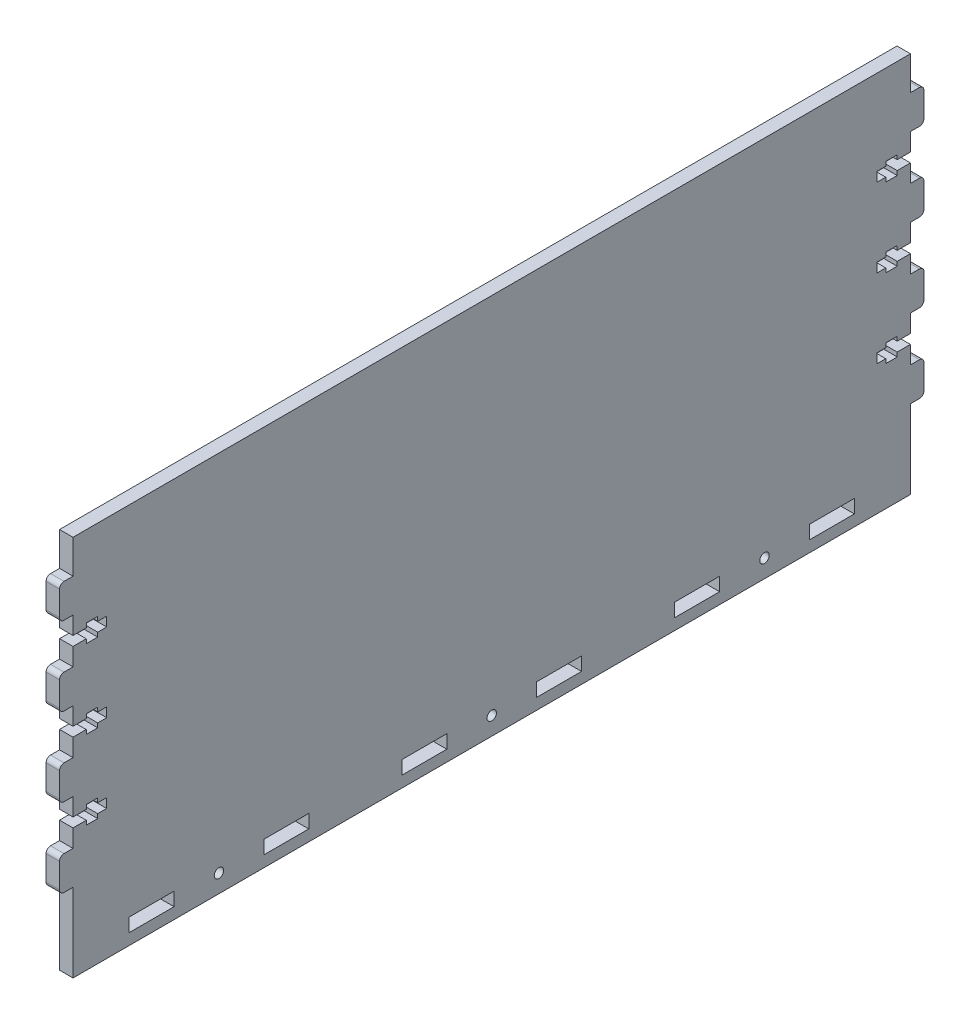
ISO-10303-21;
HEADER;
FILE_DESCRIPTION(('STEP AP214'),'2;1');
FILE_NAME('part.step','',(''),(''),'','','');
FILE_SCHEMA(('AUTOMOTIVE_DESIGN { 1 0 10303 214 1 1 1 1 }'));
ENDSEC;
DATA;
#1=APPLICATION_CONTEXT('core data for automotive mechanical design processes');
#2=APPLICATION_PROTOCOL_DEFINITION('international standard','automotive_design',2000,#1);
#3=PRODUCT_CONTEXT('',#1,'mechanical');
#4=PRODUCT('Part','Part','',(#3));
#5=PRODUCT_RELATED_PRODUCT_CATEGORY('part','',(#4));
#6=PRODUCT_DEFINITION_FORMATION('','',#4);
#7=PRODUCT_DEFINITION_CONTEXT('part definition',#1,'design');
#8=PRODUCT_DEFINITION('design','',#6,#7);
#9=PRODUCT_DEFINITION_SHAPE('','',#8);
#10=(LENGTH_UNIT() NAMED_UNIT(*) SI_UNIT(.MILLI.,.METRE.));
#11=(NAMED_UNIT(*) PLANE_ANGLE_UNIT() SI_UNIT($,.RADIAN.));
#12=(NAMED_UNIT(*) SI_UNIT($,.STERADIAN.) SOLID_ANGLE_UNIT());
#13=UNCERTAINTY_MEASURE_WITH_UNIT(LENGTH_MEASURE(1.E-05),#10,'distance_accuracy_value','');
#14=(GEOMETRIC_REPRESENTATION_CONTEXT(3) GLOBAL_UNCERTAINTY_ASSIGNED_CONTEXT((#13)) GLOBAL_UNIT_ASSIGNED_CONTEXT((#10,
#11,#12)) REPRESENTATION_CONTEXT('',''));
#15=CARTESIAN_POINT('',(0.,0.,0.));
#16=DIRECTION('',(0.,0.,1.));
#17=DIRECTION('',(1.,0.,0.));
#18=AXIS2_PLACEMENT_3D('',#15,#16,#17);
#19=CARTESIAN_POINT('',(6.,37.,4.));
#20=DIRECTION('',(-1.,0.,0.));
#21=DIRECTION('',(0.,0.,1.));
#22=AXIS2_PLACEMENT_3D('',#19,#20,#21);
#23=CYLINDRICAL_SURFACE('',#22,2.);
#24=CARTESIAN_POINT('',(0.,37.,4.));
#25=DIRECTION('',(1.,0.,0.));
#26=DIRECTION('',(0.,0.,-1.));
#27=AXIS2_PLACEMENT_3D('',#24,#25,#26);
#28=CIRCLE('',#27,2.);
#29=CARTESIAN_POINT('',(0.,35.,3.99999999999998));
#30=VERTEX_POINT('',#29);
#31=CARTESIAN_POINT('',(0.,37.,6.));
#32=VERTEX_POINT('',#31);
#33=EDGE_CURVE('E1148',#30,#32,#28,.F.);
#34=ORIENTED_EDGE('',*,*,#33,.F.);
#35=DIRECTION('',(-1.,0.,0.));
#36=VECTOR('',#35,1.);
#37=CARTESIAN_POINT('',(6.,35.,3.99999999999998));
#38=LINE('',#37,#36);
#39=CARTESIAN_POINT('',(6.,35.,3.99999999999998));
#40=VERTEX_POINT('',#39);
#41=EDGE_CURVE('E11',#40,#30,#38,.T.);
#42=ORIENTED_EDGE('',*,*,#41,.F.);
#43=CARTESIAN_POINT('',(6.,37.,4.));
#44=DIRECTION('',(1.,0.,0.));
#45=DIRECTION('',(0.,0.,-1.));
#46=AXIS2_PLACEMENT_3D('',#43,#44,#45);
#47=CIRCLE('',#46,2.);
#48=CARTESIAN_POINT('',(6.,37.,6.));
#49=VERTEX_POINT('',#48);
#50=EDGE_CURVE('E1155',#40,#49,#47,.F.);
#51=ORIENTED_EDGE('',*,*,#50,.T.);
#52=DIRECTION('',(-1.,0.,0.));
#53=VECTOR('',#52,1.);
#54=CARTESIAN_POINT('',(6.,37.,6.));
#55=LINE('',#54,#53);
#56=EDGE_CURVE('E1409',#49,#32,#55,.T.);
#57=ORIENTED_EDGE('',*,*,#56,.T.);
#58=EDGE_LOOP('',(#34,#42,#51,#57));
#59=FACE_BOUND('',#58,.T.);
#60=ADVANCED_FACE('F37',(#59),#23,.T.);
#61=CARTESIAN_POINT('',(6.,35.,0.));
#62=DIRECTION('',(0.,-1.,0.));
#63=DIRECTION('',(0.,0.,-1.));
#64=AXIS2_PLACEMENT_3D('',#61,#62,#63);
#65=PLANE('',#64);
#66=DIRECTION('',(0.,0.,1.));
#67=VECTOR('',#66,1.);
#68=CARTESIAN_POINT('',(0.,35.,0.));
#69=LINE('',#68,#67);
#70=CARTESIAN_POINT('',(0.,35.,0.));
#71=VERTEX_POINT('',#70);
#72=EDGE_CURVE('E1412',#71,#30,#69,.T.);
#73=ORIENTED_EDGE('',*,*,#72,.F.);
#74=DIRECTION('',(-1.,0.,0.));
#75=VECTOR('',#74,1.);
#76=CARTESIAN_POINT('',(6.,35.,0.));
#77=LINE('',#76,#75);
#78=CARTESIAN_POINT('',(6.,35.,0.));
#79=VERTEX_POINT('',#78);
#80=EDGE_CURVE('E44',#79,#71,#77,.T.);
#81=ORIENTED_EDGE('',*,*,#80,.F.);
#82=DIRECTION('',(0.,0.,1.));
#83=VECTOR('',#82,1.);
#84=CARTESIAN_POINT('',(6.,35.,0.));
#85=LINE('',#84,#83);
#86=EDGE_CURVE('E1158',#79,#40,#85,.T.);
#87=ORIENTED_EDGE('',*,*,#86,.T.);
#88=ORIENTED_EDGE('',*,*,#41,.T.);
#89=EDGE_LOOP('',(#73,#81,#87,#88));
#90=FACE_BOUND('',#89,.T.);
#91=ADVANCED_FACE('F1962',(#90),#65,.T.);
#92=CARTESIAN_POINT('',(6.,0.,0.));
#93=DIRECTION('',(0.,0.,1.));
#94=DIRECTION('',(1.,0.,0.));
#95=AXIS2_PLACEMENT_3D('',#92,#93,#94);
#96=PLANE('',#95);
#97=DIRECTION('',(0.,1.,0.));
#98=VECTOR('',#97,1.);
#99=CARTESIAN_POINT('',(0.,0.,0.));
#100=LINE('',#99,#98);
#101=CARTESIAN_POINT('',(0.,0.,0.));
#102=VERTEX_POINT('',#101);
#103=EDGE_CURVE('E1415',#102,#71,#100,.T.);
#104=ORIENTED_EDGE('',*,*,#103,.F.);
#105=DIRECTION('',(-1.,0.,0.));
#106=VECTOR('',#105,1.);
#107=CARTESIAN_POINT('',(6.,0.,0.));
#108=LINE('',#107,#106);
#109=CARTESIAN_POINT('',(6.,0.,0.));
#110=VERTEX_POINT('',#109);
#111=EDGE_CURVE('E1954',#110,#102,#108,.T.);
#112=ORIENTED_EDGE('',*,*,#111,.F.);
#113=DIRECTION('',(0.,1.,0.));
#114=VECTOR('',#113,1.);
#115=CARTESIAN_POINT('',(6.,0.,0.));
#116=LINE('',#115,#114);
#117=EDGE_CURVE('E1162',#110,#79,#116,.T.);
#118=ORIENTED_EDGE('',*,*,#117,.T.);
#119=ORIENTED_EDGE('',*,*,#80,.T.);
#120=EDGE_LOOP('',(#104,#112,#118,#119));
#121=FACE_BOUND('',#120,.T.);
#122=ADVANCED_FACE('F1958',(#121),#96,.T.);
#123=CARTESIAN_POINT('',(6.,0.,0.));
#124=DIRECTION('',(0.,1.,0.));
#125=DIRECTION('',(0.,0.,1.));
#126=AXIS2_PLACEMENT_3D('',#123,#124,#125);
#127=PLANE('',#126);
#128=DIRECTION('',(0.,0.,-1.));
#129=VECTOR('',#128,1.);
#130=CARTESIAN_POINT('',(0.,0.,0.));
#131=LINE('',#130,#129);
#132=CARTESIAN_POINT('',(0.,0.,-373.));
#133=VERTEX_POINT('',#132);
#134=EDGE_CURVE('E1418',#102,#133,#131,.T.);
#135=ORIENTED_EDGE('',*,*,#134,.T.);
#136=DIRECTION('',(-1.,0.,0.));
#137=VECTOR('',#136,1.);
#138=CARTESIAN_POINT('',(6.,0.,-373.));
#139=LINE('',#138,#137);
#140=CARTESIAN_POINT('',(6.,0.,-373.));
#141=VERTEX_POINT('',#140);
#142=EDGE_CURVE('E1951',#141,#133,#139,.T.);
#143=ORIENTED_EDGE('',*,*,#142,.F.);
#144=DIRECTION('',(0.,0.,-1.));
#145=VECTOR('',#144,1.);
#146=CARTESIAN_POINT('',(6.,0.,0.));
#147=LINE('',#146,#145);
#148=EDGE_CURVE('E1165',#110,#141,#147,.T.);
#149=ORIENTED_EDGE('',*,*,#148,.F.);
#150=ORIENTED_EDGE('',*,*,#111,.T.);
#151=EDGE_LOOP('',(#135,#143,#149,#150));
#152=FACE_BOUND('',#151,.T.);
#153=ADVANCED_FACE('F1970',(#152),#127,.F.);
#154=CARTESIAN_POINT('',(6.,0.,-373.));
#155=DIRECTION('',(0.,0.,1.));
#156=DIRECTION('',(1.,0.,0.));
#157=AXIS2_PLACEMENT_3D('',#154,#155,#156);
#158=PLANE('',#157);
#159=DIRECTION('',(0.,1.,0.));
#160=VECTOR('',#159,1.);
#161=CARTESIAN_POINT('',(0.,0.,-373.));
#162=LINE('',#161,#160);
#163=CARTESIAN_POINT('',(0.,35.,-373.));
#164=VERTEX_POINT('',#163);
#165=EDGE_CURVE('E1422',#133,#164,#162,.T.);
#166=ORIENTED_EDGE('',*,*,#165,.T.);
#167=DIRECTION('',(-1.,0.,0.));
#168=VECTOR('',#167,1.);
#169=CARTESIAN_POINT('',(6.,35.,-373.));
#170=LINE('',#169,#168);
#171=CARTESIAN_POINT('',(6.,35.,-373.));
#172=VERTEX_POINT('',#171);
#173=EDGE_CURVE('E1948',#172,#164,#170,.T.);
#174=ORIENTED_EDGE('',*,*,#173,.F.);
#175=DIRECTION('',(0.,1.,0.));
#176=VECTOR('',#175,1.);
#177=CARTESIAN_POINT('',(6.,0.,-373.));
#178=LINE('',#177,#176);
#179=EDGE_CURVE('E1169',#141,#172,#178,.T.);
#180=ORIENTED_EDGE('',*,*,#179,.F.);
#181=ORIENTED_EDGE('',*,*,#142,.T.);
#182=EDGE_LOOP('',(#166,#174,#180,#181));
#183=FACE_BOUND('',#182,.T.);
#184=ADVANCED_FACE('F1974',(#183),#158,.F.);
#185=CARTESIAN_POINT('',(6.,35.,0.));
#186=DIRECTION('',(0.,1.,0.));
#187=DIRECTION('',(0.,0.,1.));
#188=AXIS2_PLACEMENT_3D('',#185,#186,#187);
#189=PLANE('',#188);
#190=DIRECTION('',(0.,0.,-1.));
#191=VECTOR('',#190,1.);
#192=CARTESIAN_POINT('',(0.,35.,0.));
#193=LINE('',#192,#191);
#194=CARTESIAN_POINT('',(0.,35.,-377.));
#195=VERTEX_POINT('',#194);
#196=EDGE_CURVE('E1424',#164,#195,#193,.T.);
#197=ORIENTED_EDGE('',*,*,#196,.T.);
#198=DIRECTION('',(-1.,0.,0.));
#199=VECTOR('',#198,1.);
#200=CARTESIAN_POINT('',(6.,35.,-377.));
#201=LINE('',#200,#199);
#202=CARTESIAN_POINT('',(6.,35.,-377.));
#203=VERTEX_POINT('',#202);
#204=EDGE_CURVE('E1945',#203,#195,#201,.T.);
#205=ORIENTED_EDGE('',*,*,#204,.F.);
#206=DIRECTION('',(0.,0.,-1.));
#207=VECTOR('',#206,1.);
#208=CARTESIAN_POINT('',(6.,35.,0.));
#209=LINE('',#208,#207);
#210=EDGE_CURVE('E1171',#172,#203,#209,.T.);
#211=ORIENTED_EDGE('',*,*,#210,.F.);
#212=ORIENTED_EDGE('',*,*,#173,.T.);
#213=EDGE_LOOP('',(#197,#205,#211,#212));
#214=FACE_BOUND('',#213,.T.);
#215=ADVANCED_FACE('F2324',(#214),#189,.F.);
#216=CARTESIAN_POINT('',(6.,37.,-377.));
#217=DIRECTION('',(-1.,0.,0.));
#218=DIRECTION('',(0.,0.,1.));
#219=AXIS2_PLACEMENT_3D('',#216,#217,#218);
#220=CYLINDRICAL_SURFACE('',#219,2.);
#221=CARTESIAN_POINT('',(0.,37.,-377.));
#222=DIRECTION('',(1.,0.,0.));
#223=DIRECTION('',(0.,0.,-1.));
#224=AXIS2_PLACEMENT_3D('',#221,#222,#223);
#225=CIRCLE('',#224,2.);
#226=CARTESIAN_POINT('',(0.,37.,-379.));
#227=VERTEX_POINT('',#226);
#228=EDGE_CURVE('E1428',#195,#227,#225,.T.);
#229=ORIENTED_EDGE('',*,*,#228,.T.);
#230=DIRECTION('',(-1.,0.,0.));
#231=VECTOR('',#230,1.);
#232=CARTESIAN_POINT('',(6.,37.,-379.));
#233=LINE('',#232,#231);
#234=CARTESIAN_POINT('',(6.,37.,-379.));
#235=VERTEX_POINT('',#234);
#236=EDGE_CURVE('E1943',#235,#227,#233,.T.);
#237=ORIENTED_EDGE('',*,*,#236,.F.);
#238=CARTESIAN_POINT('',(6.,37.,-377.));
#239=DIRECTION('',(1.,0.,0.));
#240=DIRECTION('',(0.,0.,-1.));
#241=AXIS2_PLACEMENT_3D('',#238,#239,#240);
#242=CIRCLE('',#241,2.);
#243=EDGE_CURVE('E1175',#203,#235,#242,.T.);
#244=ORIENTED_EDGE('',*,*,#243,.F.);
#245=ORIENTED_EDGE('',*,*,#204,.T.);
#246=EDGE_LOOP('',(#229,#237,#244,#245));
#247=FACE_BOUND('',#246,.T.);
#248=ADVANCED_FACE('F2327',(#247),#220,.T.);
#249=CARTESIAN_POINT('',(6.,0.,-379.));
#250=DIRECTION('',(0.,0.,-1.));
#251=DIRECTION('',(-1.,0.,0.));
#252=AXIS2_PLACEMENT_3D('',#249,#250,#251);
#253=PLANE('',#252);
#254=DIRECTION('',(0.,-1.,0.));
#255=VECTOR('',#254,1.);
#256=CARTESIAN_POINT('',(0.,0.,-379.));
#257=LINE('',#256,#255);
#258=CARTESIAN_POINT('',(0.,48.,-379.));
#259=VERTEX_POINT('',#258);
#260=EDGE_CURVE('E1431',#259,#227,#257,.T.);
#261=ORIENTED_EDGE('',*,*,#260,.F.);
#262=DIRECTION('',(-1.,0.,0.));
#263=VECTOR('',#262,1.);
#264=CARTESIAN_POINT('',(6.,48.,-379.));
#265=LINE('',#264,#263);
#266=CARTESIAN_POINT('',(6.,48.,-379.));
#267=VERTEX_POINT('',#266);
#268=EDGE_CURVE('E1941',#267,#259,#265,.T.);
#269=ORIENTED_EDGE('',*,*,#268,.F.);
#270=DIRECTION('',(0.,-1.,0.));
#271=VECTOR('',#270,1.);
#272=CARTESIAN_POINT('',(6.,0.,-379.));
#273=LINE('',#272,#271);
#274=EDGE_CURVE('E1177',#267,#235,#273,.T.);
#275=ORIENTED_EDGE('',*,*,#274,.T.);
#276=ORIENTED_EDGE('',*,*,#236,.T.);
#277=EDGE_LOOP('',(#261,#269,#275,#276));
#278=FACE_BOUND('',#277,.T.);
#279=ADVANCED_FACE('F2331',(#278),#253,.T.);
#280=CARTESIAN_POINT('',(6.,48.,-377.));
#281=DIRECTION('',(-1.,0.,0.));
#282=DIRECTION('',(0.,0.,1.));
#283=AXIS2_PLACEMENT_3D('',#280,#281,#282);
#284=CYLINDRICAL_SURFACE('',#283,2.);
#285=CARTESIAN_POINT('',(0.,48.,-377.));
#286=DIRECTION('',(1.,0.,0.));
#287=DIRECTION('',(0.,0.,-1.));
#288=AXIS2_PLACEMENT_3D('',#285,#286,#287);
#289=CIRCLE('',#288,2.);
#290=CARTESIAN_POINT('',(0.,50.,-377.));
#291=VERTEX_POINT('',#290);
#292=EDGE_CURVE('E1434',#291,#259,#289,.F.);
#293=ORIENTED_EDGE('',*,*,#292,.F.);
#294=DIRECTION('',(-1.,0.,0.));
#295=VECTOR('',#294,1.);
#296=CARTESIAN_POINT('',(6.,50.,-377.));
#297=LINE('',#296,#295);
#298=CARTESIAN_POINT('',(6.,50.,-377.));
#299=VERTEX_POINT('',#298);
#300=EDGE_CURVE('E1939',#299,#291,#297,.T.);
#301=ORIENTED_EDGE('',*,*,#300,.F.);
#302=CARTESIAN_POINT('',(6.,48.,-377.));
#303=DIRECTION('',(1.,0.,0.));
#304=DIRECTION('',(0.,0.,-1.));
#305=AXIS2_PLACEMENT_3D('',#302,#303,#304);
#306=CIRCLE('',#305,2.);
#307=EDGE_CURVE('E1180',#299,#267,#306,.F.);
#308=ORIENTED_EDGE('',*,*,#307,.T.);
#309=ORIENTED_EDGE('',*,*,#268,.T.);
#310=EDGE_LOOP('',(#293,#301,#308,#309));
#311=FACE_BOUND('',#310,.T.);
#312=ADVANCED_FACE('F2335',(#311),#284,.T.);
#313=CARTESIAN_POINT('',(6.,50.,0.));
#314=DIRECTION('',(0.,1.,0.));
#315=DIRECTION('',(0.,0.,1.));
#316=AXIS2_PLACEMENT_3D('',#313,#314,#315);
#317=PLANE('',#316);
#318=DIRECTION('',(0.,0.,-1.));
#319=VECTOR('',#318,1.);
#320=CARTESIAN_POINT('',(0.,50.,0.));
#321=LINE('',#320,#319);
#322=CARTESIAN_POINT('',(0.,50.,-373.));
#323=VERTEX_POINT('',#322);
#324=EDGE_CURVE('E1437',#323,#291,#321,.T.);
#325=ORIENTED_EDGE('',*,*,#324,.F.);
#326=DIRECTION('',(-1.,0.,0.));
#327=VECTOR('',#326,1.);
#328=CARTESIAN_POINT('',(6.,50.,-373.));
#329=LINE('',#328,#327);
#330=CARTESIAN_POINT('',(6.,50.,-373.));
#331=VERTEX_POINT('',#330);
#332=EDGE_CURVE('E1937',#331,#323,#329,.T.);
#333=ORIENTED_EDGE('',*,*,#332,.F.);
#334=DIRECTION('',(0.,0.,-1.));
#335=VECTOR('',#334,1.);
#336=CARTESIAN_POINT('',(6.,50.,0.));
#337=LINE('',#336,#335);
#338=EDGE_CURVE('E1183',#331,#299,#337,.T.);
#339=ORIENTED_EDGE('',*,*,#338,.T.);
#340=ORIENTED_EDGE('',*,*,#300,.T.);
#341=EDGE_LOOP('',(#325,#333,#339,#340));
#342=FACE_BOUND('',#341,.T.);
#343=ADVANCED_FACE('F2339',(#342),#317,.T.);
#344=CARTESIAN_POINT('',(0.,57.9,-373.));
#345=VERTEX_POINT('',#344);
#346=EDGE_CURVE('E1426',#323,#345,#162,.T.);
#347=ORIENTED_EDGE('',*,*,#346,.T.);
#348=DIRECTION('',(-1.,0.,0.));
#349=VECTOR('',#348,1.);
#350=CARTESIAN_POINT('',(6.,57.9,-373.));
#351=LINE('',#350,#349);
#352=CARTESIAN_POINT('',(6.,57.9,-373.));
#353=VERTEX_POINT('',#352);
#354=EDGE_CURVE('E1934',#353,#345,#351,.T.);
#355=ORIENTED_EDGE('',*,*,#354,.F.);
#356=EDGE_CURVE('E1173',#331,#353,#178,.T.);
#357=ORIENTED_EDGE('',*,*,#356,.F.);
#358=ORIENTED_EDGE('',*,*,#332,.T.);
#359=EDGE_LOOP('',(#347,#355,#357,#358));
#360=FACE_BOUND('',#359,.T.);
#361=ADVANCED_FACE('F2063',(#360),#158,.F.);
#362=CARTESIAN_POINT('',(6.,57.9,0.));
#363=DIRECTION('',(0.,-1.,0.));
#364=DIRECTION('',(0.,0.,-1.));
#365=AXIS2_PLACEMENT_3D('',#362,#363,#364);
#366=PLANE('',#365);
#367=DIRECTION('',(0.,0.,1.));
#368=VECTOR('',#367,1.);
#369=CARTESIAN_POINT('',(0.,57.9,0.));
#370=LINE('',#369,#368);
#371=CARTESIAN_POINT('',(0.,57.9,-367.1));
#372=VERTEX_POINT('',#371);
#373=EDGE_CURVE('E1440',#345,#372,#370,.T.);
#374=ORIENTED_EDGE('',*,*,#373,.T.);
#375=DIRECTION('',(-1.,0.,0.));
#376=VECTOR('',#375,1.);
#377=CARTESIAN_POINT('',(6.,57.9,-367.1));
#378=LINE('',#377,#376);
#379=CARTESIAN_POINT('',(6.,57.9,-367.1));
#380=VERTEX_POINT('',#379);
#381=EDGE_CURVE('E1931',#380,#372,#378,.T.);
#382=ORIENTED_EDGE('',*,*,#381,.F.);
#383=DIRECTION('',(0.,0.,1.));
#384=VECTOR('',#383,1.);
#385=CARTESIAN_POINT('',(6.,57.9,0.));
#386=LINE('',#385,#384);
#387=EDGE_CURVE('E1186',#353,#380,#386,.T.);
#388=ORIENTED_EDGE('',*,*,#387,.F.);
#389=ORIENTED_EDGE('',*,*,#354,.T.);
#390=EDGE_LOOP('',(#374,#382,#388,#389));
#391=FACE_BOUND('',#390,.T.);
#392=ADVANCED_FACE('F2069',(#391),#366,.F.);
#393=CARTESIAN_POINT('',(6.,0.,-367.1));
#394=DIRECTION('',(0.,0.,-1.));
#395=DIRECTION('',(-1.,0.,0.));
#396=AXIS2_PLACEMENT_3D('',#393,#394,#395);
#397=PLANE('',#396);
#398=DIRECTION('',(0.,-1.,0.));
#399=VECTOR('',#398,1.);
#400=CARTESIAN_POINT('',(0.,0.,-367.1));
#401=LINE('',#400,#399);
#402=CARTESIAN_POINT('',(0.,56.,-367.1));
#403=VERTEX_POINT('',#402);
#404=EDGE_CURVE('E1442',#372,#403,#401,.T.);
#405=ORIENTED_EDGE('',*,*,#404,.T.);
#406=DIRECTION('',(-1.,0.,0.));
#407=VECTOR('',#406,1.);
#408=CARTESIAN_POINT('',(6.,56.,-367.1));
#409=LINE('',#408,#407);
#410=CARTESIAN_POINT('',(6.,56.,-367.1));
#411=VERTEX_POINT('',#410);
#412=EDGE_CURVE('E1928',#411,#403,#409,.T.);
#413=ORIENTED_EDGE('',*,*,#412,.F.);
#414=DIRECTION('',(0.,-1.,0.));
#415=VECTOR('',#414,1.);
#416=CARTESIAN_POINT('',(6.,0.,-367.1));
#417=LINE('',#416,#415);
#418=EDGE_CURVE('E1188',#380,#411,#417,.T.);
#419=ORIENTED_EDGE('',*,*,#418,.F.);
#420=ORIENTED_EDGE('',*,*,#381,.T.);
#421=EDGE_LOOP('',(#405,#413,#419,#420));
#422=FACE_BOUND('',#421,.T.);
#423=ADVANCED_FACE('F2075',(#422),#397,.F.);
#424=CARTESIAN_POINT('',(6.,56.,0.));
#425=DIRECTION('',(0.,-1.,0.));
#426=DIRECTION('',(0.,0.,-1.));
#427=AXIS2_PLACEMENT_3D('',#424,#425,#426);
#428=PLANE('',#427);
#429=DIRECTION('',(0.,0.,1.));
#430=VECTOR('',#429,1.);
#431=CARTESIAN_POINT('',(0.,56.,0.));
#432=LINE('',#431,#430);
#433=CARTESIAN_POINT('',(0.,56.,-362.));
#434=VERTEX_POINT('',#433);
#435=EDGE_CURVE('E1445',#403,#434,#432,.T.);
#436=ORIENTED_EDGE('',*,*,#435,.T.);
#437=DIRECTION('',(-1.,0.,0.));
#438=VECTOR('',#437,1.);
#439=CARTESIAN_POINT('',(6.,56.,-362.));
#440=LINE('',#439,#438);
#441=CARTESIAN_POINT('',(6.,56.,-362.));
#442=VERTEX_POINT('',#441);
#443=EDGE_CURVE('E1926',#442,#434,#440,.T.);
#444=ORIENTED_EDGE('',*,*,#443,.F.);
#445=DIRECTION('',(0.,0.,1.));
#446=VECTOR('',#445,1.);
#447=CARTESIAN_POINT('',(6.,56.,0.));
#448=LINE('',#447,#446);
#449=EDGE_CURVE('E1191',#411,#442,#448,.T.);
#450=ORIENTED_EDGE('',*,*,#449,.F.);
#451=ORIENTED_EDGE('',*,*,#412,.T.);
#452=EDGE_LOOP('',(#436,#444,#450,#451));
#453=FACE_BOUND('',#452,.T.);
#454=ADVANCED_FACE('F2079',(#453),#428,.F.);
#455=CARTESIAN_POINT('',(6.,0.,-362.));
#456=DIRECTION('',(0.,0.,-1.));
#457=DIRECTION('',(-1.,0.,0.));
#458=AXIS2_PLACEMENT_3D('',#455,#456,#457);
#459=PLANE('',#458);
#460=DIRECTION('',(0.,-1.,0.));
#461=VECTOR('',#460,1.);
#462=CARTESIAN_POINT('',(0.,0.,-362.));
#463=LINE('',#462,#461);
#464=CARTESIAN_POINT('',(0.,57.9,-362.));
#465=VERTEX_POINT('',#464);
#466=EDGE_CURVE('E1449',#465,#434,#463,.T.);
#467=ORIENTED_EDGE('',*,*,#466,.F.);
#468=DIRECTION('',(-1.,0.,0.));
#469=VECTOR('',#468,1.);
#470=CARTESIAN_POINT('',(6.,57.9,-362.));
#471=LINE('',#470,#469);
#472=CARTESIAN_POINT('',(6.,57.9,-362.));
#473=VERTEX_POINT('',#472);
#474=EDGE_CURVE('E1924',#473,#465,#471,.T.);
#475=ORIENTED_EDGE('',*,*,#474,.F.);
#476=DIRECTION('',(0.,-1.,0.));
#477=VECTOR('',#476,1.);
#478=CARTESIAN_POINT('',(6.,0.,-362.));
#479=LINE('',#478,#477);
#480=EDGE_CURVE('E1194',#473,#442,#479,.T.);
#481=ORIENTED_EDGE('',*,*,#480,.T.);
#482=ORIENTED_EDGE('',*,*,#443,.T.);
#483=EDGE_LOOP('',(#467,#475,#481,#482));
#484=FACE_BOUND('',#483,.T.);
#485=ADVANCED_FACE('F2301',(#484),#459,.T.);
#486=CARTESIAN_POINT('',(0.,57.9,-358.));
#487=VERTEX_POINT('',#486);
#488=EDGE_CURVE('E1443',#465,#487,#370,.T.);
#489=ORIENTED_EDGE('',*,*,#488,.T.);
#490=DIRECTION('',(-1.,0.,0.));
#491=VECTOR('',#490,1.);
#492=CARTESIAN_POINT('',(6.,57.9,-358.));
#493=LINE('',#492,#491);
#494=CARTESIAN_POINT('',(6.,57.9,-358.));
#495=VERTEX_POINT('',#494);
#496=EDGE_CURVE('E1922',#495,#487,#493,.T.);
#497=ORIENTED_EDGE('',*,*,#496,.F.);
#498=EDGE_CURVE('E1189',#473,#495,#386,.T.);
#499=ORIENTED_EDGE('',*,*,#498,.F.);
#500=ORIENTED_EDGE('',*,*,#474,.T.);
#501=EDGE_LOOP('',(#489,#497,#499,#500));
#502=FACE_BOUND('',#501,.T.);
#503=ADVANCED_FACE('F2298',(#502),#366,.F.);
#504=CARTESIAN_POINT('',(6.,0.,-358.));
#505=DIRECTION('',(0.,0.,-1.));
#506=DIRECTION('',(-1.,0.,0.));
#507=AXIS2_PLACEMENT_3D('',#504,#505,#506);
#508=PLANE('',#507);
#509=DIRECTION('',(0.,-1.,0.));
#510=VECTOR('',#509,1.);
#511=CARTESIAN_POINT('',(0.,0.,-358.));
#512=LINE('',#511,#510);
#513=CARTESIAN_POINT('',(0.,62.1,-358.));
#514=VERTEX_POINT('',#513);
#515=EDGE_CURVE('E1453',#514,#487,#512,.T.);
#516=ORIENTED_EDGE('',*,*,#515,.F.);
#517=DIRECTION('',(-1.,0.,0.));
#518=VECTOR('',#517,1.);
#519=CARTESIAN_POINT('',(6.,62.1,-358.));
#520=LINE('',#519,#518);
#521=CARTESIAN_POINT('',(6.,62.1,-358.));
#522=VERTEX_POINT('',#521);
#523=EDGE_CURVE('E1920',#522,#514,#520,.T.);
#524=ORIENTED_EDGE('',*,*,#523,.F.);
#525=DIRECTION('',(0.,-1.,0.));
#526=VECTOR('',#525,1.);
#527=CARTESIAN_POINT('',(6.,0.,-358.));
#528=LINE('',#527,#526);
#529=EDGE_CURVE('E1198',#522,#495,#528,.T.);
#530=ORIENTED_EDGE('',*,*,#529,.T.);
#531=ORIENTED_EDGE('',*,*,#496,.T.);
#532=EDGE_LOOP('',(#516,#524,#530,#531));
#533=FACE_BOUND('',#532,.T.);
#534=ADVANCED_FACE('F2293',(#533),#508,.T.);
#535=CARTESIAN_POINT('',(6.,62.1,0.));
#536=DIRECTION('',(0.,-1.,0.));
#537=DIRECTION('',(0.,0.,-1.));
#538=AXIS2_PLACEMENT_3D('',#535,#536,#537);
#539=PLANE('',#538);
#540=DIRECTION('',(0.,0.,1.));
#541=VECTOR('',#540,1.);
#542=CARTESIAN_POINT('',(0.,62.1,0.));
#543=LINE('',#542,#541);
#544=CARTESIAN_POINT('',(0.,62.1,-362.));
#545=VERTEX_POINT('',#544);
#546=EDGE_CURVE('E1456',#545,#514,#543,.T.);
#547=ORIENTED_EDGE('',*,*,#546,.F.);
#548=DIRECTION('',(-1.,0.,0.));
#549=VECTOR('',#548,1.);
#550=CARTESIAN_POINT('',(6.,62.1,-362.));
#551=LINE('',#550,#549);
#552=CARTESIAN_POINT('',(6.,62.1,-362.));
#553=VERTEX_POINT('',#552);
#554=EDGE_CURVE('E1918',#553,#545,#551,.T.);
#555=ORIENTED_EDGE('',*,*,#554,.F.);
#556=DIRECTION('',(0.,0.,1.));
#557=VECTOR('',#556,1.);
#558=CARTESIAN_POINT('',(6.,62.1,0.));
#559=LINE('',#558,#557);
#560=EDGE_CURVE('E1201',#553,#522,#559,.T.);
#561=ORIENTED_EDGE('',*,*,#560,.T.);
#562=ORIENTED_EDGE('',*,*,#523,.T.);
#563=EDGE_LOOP('',(#547,#555,#561,#562));
#564=FACE_BOUND('',#563,.T.);
#565=ADVANCED_FACE('F2289',(#564),#539,.T.);
#566=CARTESIAN_POINT('',(0.,64.,-362.));
#567=VERTEX_POINT('',#566);
#568=EDGE_CURVE('E1452',#567,#545,#463,.T.);
#569=ORIENTED_EDGE('',*,*,#568,.F.);
#570=DIRECTION('',(-1.,0.,0.));
#571=VECTOR('',#570,1.);
#572=CARTESIAN_POINT('',(6.,64.,-362.));
#573=LINE('',#572,#571);
#574=CARTESIAN_POINT('',(6.,64.,-362.));
#575=VERTEX_POINT('',#574);
#576=EDGE_CURVE('E1916',#575,#567,#573,.T.);
#577=ORIENTED_EDGE('',*,*,#576,.F.);
#578=EDGE_CURVE('E1197',#575,#553,#479,.T.);
#579=ORIENTED_EDGE('',*,*,#578,.T.);
#580=ORIENTED_EDGE('',*,*,#554,.T.);
#581=EDGE_LOOP('',(#569,#577,#579,#580));
#582=FACE_BOUND('',#581,.T.);
#583=ADVANCED_FACE('F2284',(#582),#459,.T.);
#584=CARTESIAN_POINT('',(6.,64.,0.));
#585=DIRECTION('',(0.,-1.,0.));
#586=DIRECTION('',(0.,0.,-1.));
#587=AXIS2_PLACEMENT_3D('',#584,#585,#586);
#588=PLANE('',#587);
#589=DIRECTION('',(0.,0.,1.));
#590=VECTOR('',#589,1.);
#591=CARTESIAN_POINT('',(0.,64.,0.));
#592=LINE('',#591,#590);
#593=CARTESIAN_POINT('',(0.,64.,-367.1));
#594=VERTEX_POINT('',#593);
#595=EDGE_CURVE('E1460',#594,#567,#592,.T.);
#596=ORIENTED_EDGE('',*,*,#595,.F.);
#597=DIRECTION('',(-1.,0.,0.));
#598=VECTOR('',#597,1.);
#599=CARTESIAN_POINT('',(6.,64.,-367.1));
#600=LINE('',#599,#598);
#601=CARTESIAN_POINT('',(6.,64.,-367.1));
#602=VERTEX_POINT('',#601);
#603=EDGE_CURVE('E1914',#602,#594,#600,.T.);
#604=ORIENTED_EDGE('',*,*,#603,.F.);
#605=DIRECTION('',(0.,0.,1.));
#606=VECTOR('',#605,1.);
#607=CARTESIAN_POINT('',(6.,64.,0.));
#608=LINE('',#607,#606);
#609=EDGE_CURVE('E1205',#602,#575,#608,.T.);
#610=ORIENTED_EDGE('',*,*,#609,.T.);
#611=ORIENTED_EDGE('',*,*,#576,.T.);
#612=EDGE_LOOP('',(#596,#604,#610,#611));
#613=FACE_BOUND('',#612,.T.);
#614=ADVANCED_FACE('F2279',(#613),#588,.T.);
#615=CARTESIAN_POINT('',(0.,62.1,-367.1));
#616=VERTEX_POINT('',#615);
#617=EDGE_CURVE('E1446',#594,#616,#401,.T.);
#618=ORIENTED_EDGE('',*,*,#617,.T.);
#619=DIRECTION('',(-1.,0.,0.));
#620=VECTOR('',#619,1.);
#621=CARTESIAN_POINT('',(6.,62.1,-367.1));
#622=LINE('',#621,#620);
#623=CARTESIAN_POINT('',(6.,62.1,-367.1));
#624=VERTEX_POINT('',#623);
#625=EDGE_CURVE('E1912',#624,#616,#622,.T.);
#626=ORIENTED_EDGE('',*,*,#625,.F.);
#627=EDGE_CURVE('E1192',#602,#624,#417,.T.);
#628=ORIENTED_EDGE('',*,*,#627,.F.);
#629=ORIENTED_EDGE('',*,*,#603,.T.);
#630=EDGE_LOOP('',(#618,#626,#628,#629));
#631=FACE_BOUND('',#630,.T.);
#632=ADVANCED_FACE('F2353',(#631),#397,.F.);
#633=CARTESIAN_POINT('',(0.,62.1,-373.));
#634=VERTEX_POINT('',#633);
#635=EDGE_CURVE('E1459',#634,#616,#543,.T.);
#636=ORIENTED_EDGE('',*,*,#635,.F.);
#637=DIRECTION('',(-1.,0.,0.));
#638=VECTOR('',#637,1.);
#639=CARTESIAN_POINT('',(6.,62.1,-373.));
#640=LINE('',#639,#638);
#641=CARTESIAN_POINT('',(6.,62.1,-373.));
#642=VERTEX_POINT('',#641);
#643=EDGE_CURVE('E1910',#642,#634,#640,.T.);
#644=ORIENTED_EDGE('',*,*,#643,.F.);
#645=EDGE_CURVE('E1204',#642,#624,#559,.T.);
#646=ORIENTED_EDGE('',*,*,#645,.T.);
#647=ORIENTED_EDGE('',*,*,#625,.T.);
#648=EDGE_LOOP('',(#636,#644,#646,#647));
#649=FACE_BOUND('',#648,.T.);
#650=ADVANCED_FACE('F2272',(#649),#539,.T.);
#651=CARTESIAN_POINT('',(0.,70.,-373.));
#652=VERTEX_POINT('',#651);
#653=EDGE_CURVE('E1466',#634,#652,#162,.T.);
#654=ORIENTED_EDGE('',*,*,#653,.T.);
#655=DIRECTION('',(-1.,0.,0.));
#656=VECTOR('',#655,1.);
#657=CARTESIAN_POINT('',(6.,70.,-373.));
#658=LINE('',#657,#656);
#659=CARTESIAN_POINT('',(6.,70.,-373.));
#660=VERTEX_POINT('',#659);
#661=EDGE_CURVE('E1907',#660,#652,#658,.T.);
#662=ORIENTED_EDGE('',*,*,#661,.F.);
#663=EDGE_CURVE('E1211',#642,#660,#178,.T.);
#664=ORIENTED_EDGE('',*,*,#663,.F.);
#665=ORIENTED_EDGE('',*,*,#643,.T.);
#666=EDGE_LOOP('',(#654,#662,#664,#665));
#667=FACE_BOUND('',#666,.T.);
#668=ADVANCED_FACE('F2267',(#667),#158,.F.);
#669=CARTESIAN_POINT('',(6.,70.,0.));
#670=DIRECTION('',(0.,1.,0.));
#671=DIRECTION('',(0.,0.,1.));
#672=AXIS2_PLACEMENT_3D('',#669,#670,#671);
#673=PLANE('',#672);
#674=DIRECTION('',(0.,0.,-1.));
#675=VECTOR('',#674,1.);
#676=CARTESIAN_POINT('',(0.,70.,0.));
#677=LINE('',#676,#675);
#678=CARTESIAN_POINT('',(0.,70.,-377.));
#679=VERTEX_POINT('',#678);
#680=EDGE_CURVE('E1463',#652,#679,#677,.T.);
#681=ORIENTED_EDGE('',*,*,#680,.T.);
#682=DIRECTION('',(-1.,0.,0.));
#683=VECTOR('',#682,1.);
#684=CARTESIAN_POINT('',(6.,70.,-377.));
#685=LINE('',#684,#683);
#686=CARTESIAN_POINT('',(6.,70.,-377.));
#687=VERTEX_POINT('',#686);
#688=EDGE_CURVE('E1904',#687,#679,#685,.T.);
#689=ORIENTED_EDGE('',*,*,#688,.F.);
#690=DIRECTION('',(0.,0.,-1.));
#691=VECTOR('',#690,1.);
#692=CARTESIAN_POINT('',(6.,70.,0.));
#693=LINE('',#692,#691);
#694=EDGE_CURVE('E1208',#660,#687,#693,.T.);
#695=ORIENTED_EDGE('',*,*,#694,.F.);
#696=ORIENTED_EDGE('',*,*,#661,.T.);
#697=EDGE_LOOP('',(#681,#689,#695,#696));
#698=FACE_BOUND('',#697,.T.);
#699=ADVANCED_FACE('F2265',(#698),#673,.F.);
#700=CARTESIAN_POINT('',(6.,72.,-377.));
#701=DIRECTION('',(-1.,0.,0.));
#702=DIRECTION('',(0.,0.,1.));
#703=AXIS2_PLACEMENT_3D('',#700,#701,#702);
#704=CYLINDRICAL_SURFACE('',#703,2.);
#705=CARTESIAN_POINT('',(0.,72.,-377.));
#706=DIRECTION('',(1.,0.,0.));
#707=DIRECTION('',(0.,0.,-1.));
#708=AXIS2_PLACEMENT_3D('',#705,#706,#707);
#709=CIRCLE('',#708,2.);
#710=CARTESIAN_POINT('',(0.,72.,-379.));
#711=VERTEX_POINT('',#710);
#712=EDGE_CURVE('E1465',#679,#711,#709,.T.);
#713=ORIENTED_EDGE('',*,*,#712,.T.);
#714=DIRECTION('',(-1.,0.,0.));
#715=VECTOR('',#714,1.);
#716=CARTESIAN_POINT('',(6.,72.,-379.));
#717=LINE('',#716,#715);
#718=CARTESIAN_POINT('',(6.,72.,-379.));
#719=VERTEX_POINT('',#718);
#720=EDGE_CURVE('E1902',#719,#711,#717,.T.);
#721=ORIENTED_EDGE('',*,*,#720,.F.);
#722=CARTESIAN_POINT('',(6.,72.,-377.));
#723=DIRECTION('',(1.,0.,0.));
#724=DIRECTION('',(0.,0.,-1.));
#725=AXIS2_PLACEMENT_3D('',#722,#723,#724);
#726=CIRCLE('',#725,2.);
#727=EDGE_CURVE('E1210',#687,#719,#726,.T.);
#728=ORIENTED_EDGE('',*,*,#727,.F.);
#729=ORIENTED_EDGE('',*,*,#688,.T.);
#730=EDGE_LOOP('',(#713,#721,#728,#729));
#731=FACE_BOUND('',#730,.T.);
#732=ADVANCED_FACE('F2260',(#731),#704,.T.);
#733=CARTESIAN_POINT('',(6.,0.,-379.));
#734=DIRECTION('',(0.,0.,-1.));
#735=DIRECTION('',(-1.,0.,0.));
#736=AXIS2_PLACEMENT_3D('',#733,#734,#735);
#737=PLANE('',#736);
#738=DIRECTION('',(0.,-1.,0.));
#739=VECTOR('',#738,1.);
#740=CARTESIAN_POINT('',(0.,0.,-379.));
#741=LINE('',#740,#739);
#742=CARTESIAN_POINT('',(0.,83.,-379.));
#743=VERTEX_POINT('',#742);
#744=EDGE_CURVE('E1469',#743,#711,#741,.T.);
#745=ORIENTED_EDGE('',*,*,#744,.F.);
#746=DIRECTION('',(-1.,0.,0.));
#747=VECTOR('',#746,1.);
#748=CARTESIAN_POINT('',(6.,83.,-379.));
#749=LINE('',#748,#747);
#750=CARTESIAN_POINT('',(6.,83.,-379.));
#751=VERTEX_POINT('',#750);
#752=EDGE_CURVE('E1900',#751,#743,#749,.T.);
#753=ORIENTED_EDGE('',*,*,#752,.F.);
#754=DIRECTION('',(0.,-1.,0.));
#755=VECTOR('',#754,1.);
#756=CARTESIAN_POINT('',(6.,0.,-379.));
#757=LINE('',#756,#755);
#758=EDGE_CURVE('E1213',#751,#719,#757,.T.);
#759=ORIENTED_EDGE('',*,*,#758,.T.);
#760=ORIENTED_EDGE('',*,*,#720,.T.);
#761=EDGE_LOOP('',(#745,#753,#759,#760));
#762=FACE_BOUND('',#761,.T.);
#763=ADVANCED_FACE('F2256',(#762),#737,.T.);
#764=CARTESIAN_POINT('',(6.,83.,-377.));
#765=DIRECTION('',(-1.,0.,0.));
#766=DIRECTION('',(0.,0.,1.));
#767=AXIS2_PLACEMENT_3D('',#764,#765,#766);
#768=CYLINDRICAL_SURFACE('',#767,2.);
#769=CARTESIAN_POINT('',(0.,83.,-377.));
#770=DIRECTION('',(1.,0.,0.));
#771=DIRECTION('',(0.,0.,-1.));
#772=AXIS2_PLACEMENT_3D('',#769,#770,#771);
#773=CIRCLE('',#772,2.);
#774=CARTESIAN_POINT('',(0.,85.,-377.));
#775=VERTEX_POINT('',#774);
#776=EDGE_CURVE('E1472',#775,#743,#773,.F.);
#777=ORIENTED_EDGE('',*,*,#776,.F.);
#778=DIRECTION('',(-1.,0.,0.));
#779=VECTOR('',#778,1.);
#780=CARTESIAN_POINT('',(6.,85.,-377.));
#781=LINE('',#780,#779);
#782=CARTESIAN_POINT('',(6.,85.,-377.));
#783=VERTEX_POINT('',#782);
#784=EDGE_CURVE('E1898',#783,#775,#781,.T.);
#785=ORIENTED_EDGE('',*,*,#784,.F.);
#786=CARTESIAN_POINT('',(6.,83.,-377.));
#787=DIRECTION('',(1.,0.,0.));
#788=DIRECTION('',(0.,0.,-1.));
#789=AXIS2_PLACEMENT_3D('',#786,#787,#788);
#790=CIRCLE('',#789,2.);
#791=EDGE_CURVE('E1216',#783,#751,#790,.F.);
#792=ORIENTED_EDGE('',*,*,#791,.T.);
#793=ORIENTED_EDGE('',*,*,#752,.T.);
#794=EDGE_LOOP('',(#777,#785,#792,#793));
#795=FACE_BOUND('',#794,.T.);
#796=ADVANCED_FACE('F2254',(#795),#768,.T.);
#797=CARTESIAN_POINT('',(6.,85.,0.));
#798=DIRECTION('',(0.,1.,0.));
#799=DIRECTION('',(0.,0.,1.));
#800=AXIS2_PLACEMENT_3D('',#797,#798,#799);
#801=PLANE('',#800);
#802=DIRECTION('',(0.,0.,-1.));
#803=VECTOR('',#802,1.);
#804=CARTESIAN_POINT('',(0.,85.,0.));
#805=LINE('',#804,#803);
#806=CARTESIAN_POINT('',(0.,85.,-373.));
#807=VERTEX_POINT('',#806);
#808=EDGE_CURVE('E1475',#807,#775,#805,.T.);
#809=ORIENTED_EDGE('',*,*,#808,.F.);
#810=DIRECTION('',(-1.,0.,0.));
#811=VECTOR('',#810,1.);
#812=CARTESIAN_POINT('',(6.,85.,-373.));
#813=LINE('',#812,#811);
#814=CARTESIAN_POINT('',(6.,85.,-373.));
#815=VERTEX_POINT('',#814);
#816=EDGE_CURVE('E1896',#815,#807,#813,.T.);
#817=ORIENTED_EDGE('',*,*,#816,.F.);
#818=DIRECTION('',(0.,0.,-1.));
#819=VECTOR('',#818,1.);
#820=CARTESIAN_POINT('',(6.,85.,0.));
#821=LINE('',#820,#819);
#822=EDGE_CURVE('E1219',#815,#783,#821,.T.);
#823=ORIENTED_EDGE('',*,*,#822,.T.);
#824=ORIENTED_EDGE('',*,*,#784,.T.);
#825=EDGE_LOOP('',(#809,#817,#823,#824));
#826=FACE_BOUND('',#825,.T.);
#827=ADVANCED_FACE('F2249',(#826),#801,.T.);
#828=CARTESIAN_POINT('',(0.,92.9,-373.));
#829=VERTEX_POINT('',#828);
#830=EDGE_CURVE('E1478',#807,#829,#162,.T.);
#831=ORIENTED_EDGE('',*,*,#830,.T.);
#832=DIRECTION('',(-1.,0.,0.));
#833=VECTOR('',#832,1.);
#834=CARTESIAN_POINT('',(6.,92.9,-373.));
#835=LINE('',#834,#833);
#836=CARTESIAN_POINT('',(6.,92.9,-373.));
#837=VERTEX_POINT('',#836);
#838=EDGE_CURVE('E1893',#837,#829,#835,.T.);
#839=ORIENTED_EDGE('',*,*,#838,.F.);
#840=EDGE_CURVE('E1222',#815,#837,#178,.T.);
#841=ORIENTED_EDGE('',*,*,#840,.F.);
#842=ORIENTED_EDGE('',*,*,#816,.T.);
#843=EDGE_LOOP('',(#831,#839,#841,#842));
#844=FACE_BOUND('',#843,.T.);
#845=ADVANCED_FACE('F2244',(#844),#158,.F.);
#846=CARTESIAN_POINT('',(6.,92.8999999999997,0.));
#847=DIRECTION('',(0.,-1.,0.));
#848=DIRECTION('',(0.,0.,-1.));
#849=AXIS2_PLACEMENT_3D('',#846,#847,#848);
#850=PLANE('',#849);
#851=DIRECTION('',(0.,0.,1.));
#852=VECTOR('',#851,1.);
#853=CARTESIAN_POINT('',(0.,92.8999999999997,0.));
#854=LINE('',#853,#852);
#855=CARTESIAN_POINT('',(0.,92.9,-367.1));
#856=VERTEX_POINT('',#855);
#857=EDGE_CURVE('E1479',#829,#856,#854,.T.);
#858=ORIENTED_EDGE('',*,*,#857,.T.);
#859=DIRECTION('',(-1.,0.,0.));
#860=VECTOR('',#859,1.);
#861=CARTESIAN_POINT('',(6.,92.9,-367.1));
#862=LINE('',#861,#860);
#863=CARTESIAN_POINT('',(6.,92.9,-367.1));
#864=VERTEX_POINT('',#863);
#865=EDGE_CURVE('E1890',#864,#856,#862,.T.);
#866=ORIENTED_EDGE('',*,*,#865,.F.);
#867=DIRECTION('',(0.,0.,1.));
#868=VECTOR('',#867,1.);
#869=CARTESIAN_POINT('',(6.,92.8999999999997,0.));
#870=LINE('',#869,#868);
#871=EDGE_CURVE('E1223',#837,#864,#870,.T.);
#872=ORIENTED_EDGE('',*,*,#871,.F.);
#873=ORIENTED_EDGE('',*,*,#838,.T.);
#874=EDGE_LOOP('',(#858,#866,#872,#873));
#875=FACE_BOUND('',#874,.T.);
#876=ADVANCED_FACE('F2243',(#875),#850,.F.);
#877=CARTESIAN_POINT('',(6.,0.,-367.1));
#878=DIRECTION('',(0.,0.,-1.));
#879=DIRECTION('',(-1.,0.,0.));
#880=AXIS2_PLACEMENT_3D('',#877,#878,#879);
#881=PLANE('',#880);
#882=DIRECTION('',(0.,-1.,0.));
#883=VECTOR('',#882,1.);
#884=CARTESIAN_POINT('',(0.,0.,-367.1));
#885=LINE('',#884,#883);
#886=CARTESIAN_POINT('',(0.,91.,-367.1));
#887=VERTEX_POINT('',#886);
#888=EDGE_CURVE('E1481',#856,#887,#885,.T.);
#889=ORIENTED_EDGE('',*,*,#888,.T.);
#890=DIRECTION('',(-1.,0.,0.));
#891=VECTOR('',#890,1.);
#892=CARTESIAN_POINT('',(6.,91.,-367.1));
#893=LINE('',#892,#891);
#894=CARTESIAN_POINT('',(6.,91.,-367.1));
#895=VERTEX_POINT('',#894);
#896=EDGE_CURVE('E1887',#895,#887,#893,.T.);
#897=ORIENTED_EDGE('',*,*,#896,.F.);
#898=DIRECTION('',(0.,-1.,0.));
#899=VECTOR('',#898,1.);
#900=CARTESIAN_POINT('',(6.,0.,-367.1));
#901=LINE('',#900,#899);
#902=EDGE_CURVE('E1225',#864,#895,#901,.T.);
#903=ORIENTED_EDGE('',*,*,#902,.F.);
#904=ORIENTED_EDGE('',*,*,#865,.T.);
#905=EDGE_LOOP('',(#889,#897,#903,#904));
#906=FACE_BOUND('',#905,.T.);
#907=ADVANCED_FACE('F2238',(#906),#881,.F.);
#908=CARTESIAN_POINT('',(6.,91.,0.));
#909=DIRECTION('',(0.,-1.,0.));
#910=DIRECTION('',(0.,0.,-1.));
#911=AXIS2_PLACEMENT_3D('',#908,#909,#910);
#912=PLANE('',#911);
#913=DIRECTION('',(0.,0.,1.));
#914=VECTOR('',#913,1.);
#915=CARTESIAN_POINT('',(0.,91.,0.));
#916=LINE('',#915,#914);
#917=CARTESIAN_POINT('',(0.,91.,-362.));
#918=VERTEX_POINT('',#917);
#919=EDGE_CURVE('E1484',#887,#918,#916,.T.);
#920=ORIENTED_EDGE('',*,*,#919,.T.);
#921=DIRECTION('',(-1.,0.,0.));
#922=VECTOR('',#921,1.);
#923=CARTESIAN_POINT('',(6.,91.,-362.));
#924=LINE('',#923,#922);
#925=CARTESIAN_POINT('',(6.,91.,-362.));
#926=VERTEX_POINT('',#925);
#927=EDGE_CURVE('E1885',#926,#918,#924,.T.);
#928=ORIENTED_EDGE('',*,*,#927,.F.);
#929=DIRECTION('',(0.,0.,1.));
#930=VECTOR('',#929,1.);
#931=CARTESIAN_POINT('',(6.,91.,0.));
#932=LINE('',#931,#930);
#933=EDGE_CURVE('E1228',#895,#926,#932,.T.);
#934=ORIENTED_EDGE('',*,*,#933,.F.);
#935=ORIENTED_EDGE('',*,*,#896,.T.);
#936=EDGE_LOOP('',(#920,#928,#934,#935));
#937=FACE_BOUND('',#936,.T.);
#938=ADVANCED_FACE('F2233',(#937),#912,.F.);
#939=CARTESIAN_POINT('',(6.,0.,-362.));
#940=DIRECTION('',(0.,0.,-1.));
#941=DIRECTION('',(-1.,0.,0.));
#942=AXIS2_PLACEMENT_3D('',#939,#940,#941);
#943=PLANE('',#942);
#944=DIRECTION('',(0.,-1.,0.));
#945=VECTOR('',#944,1.);
#946=CARTESIAN_POINT('',(0.,0.,-362.));
#947=LINE('',#946,#945);
#948=CARTESIAN_POINT('',(0.,92.9,-362.));
#949=VERTEX_POINT('',#948);
#950=EDGE_CURVE('E1488',#949,#918,#947,.T.);
#951=ORIENTED_EDGE('',*,*,#950,.F.);
#952=DIRECTION('',(-1.,0.,0.));
#953=VECTOR('',#952,1.);
#954=CARTESIAN_POINT('',(6.,92.9,-362.));
#955=LINE('',#954,#953);
#956=CARTESIAN_POINT('',(6.,92.9,-362.));
#957=VERTEX_POINT('',#956);
#958=EDGE_CURVE('E1883',#957,#949,#955,.T.);
#959=ORIENTED_EDGE('',*,*,#958,.F.);
#960=DIRECTION('',(0.,-1.,0.));
#961=VECTOR('',#960,1.);
#962=CARTESIAN_POINT('',(6.,0.,-362.));
#963=LINE('',#962,#961);
#964=EDGE_CURVE('E1231',#957,#926,#963,.T.);
#965=ORIENTED_EDGE('',*,*,#964,.T.);
#966=ORIENTED_EDGE('',*,*,#927,.T.);
#967=EDGE_LOOP('',(#951,#959,#965,#966));
#968=FACE_BOUND('',#967,.T.);
#969=ADVANCED_FACE('F2228',(#968),#943,.T.);
#970=CARTESIAN_POINT('',(0.,92.9,-358.));
#971=VERTEX_POINT('',#970);
#972=EDGE_CURVE('E1482',#949,#971,#854,.T.);
#973=ORIENTED_EDGE('',*,*,#972,.T.);
#974=DIRECTION('',(-1.,0.,0.));
#975=VECTOR('',#974,1.);
#976=CARTESIAN_POINT('',(6.,92.9,-358.));
#977=LINE('',#976,#975);
#978=CARTESIAN_POINT('',(6.,92.9,-358.));
#979=VERTEX_POINT('',#978);
#980=EDGE_CURVE('E1881',#979,#971,#977,.T.);
#981=ORIENTED_EDGE('',*,*,#980,.F.);
#982=EDGE_CURVE('E1226',#957,#979,#870,.T.);
#983=ORIENTED_EDGE('',*,*,#982,.F.);
#984=ORIENTED_EDGE('',*,*,#958,.T.);
#985=EDGE_LOOP('',(#973,#981,#983,#984));
#986=FACE_BOUND('',#985,.T.);
#987=ADVANCED_FACE('F2224',(#986),#850,.F.);
#988=CARTESIAN_POINT('',(6.,0.,-358.));
#989=DIRECTION('',(0.,0.,-1.));
#990=DIRECTION('',(-1.,0.,0.));
#991=AXIS2_PLACEMENT_3D('',#988,#989,#990);
#992=PLANE('',#991);
#993=DIRECTION('',(0.,-1.,0.));
#994=VECTOR('',#993,1.);
#995=CARTESIAN_POINT('',(0.,0.,-358.));
#996=LINE('',#995,#994);
#997=CARTESIAN_POINT('',(0.,97.1,-358.));
#998=VERTEX_POINT('',#997);
#999=EDGE_CURVE('E1492',#998,#971,#996,.T.);
#1000=ORIENTED_EDGE('',*,*,#999,.F.);
#1001=DIRECTION('',(-1.,0.,0.));
#1002=VECTOR('',#1001,1.);
#1003=CARTESIAN_POINT('',(6.,97.1,-358.));
#1004=LINE('',#1003,#1002);
#1005=CARTESIAN_POINT('',(6.,97.1,-358.));
#1006=VERTEX_POINT('',#1005);
#1007=EDGE_CURVE('E1879',#1006,#998,#1004,.T.);
#1008=ORIENTED_EDGE('',*,*,#1007,.F.);
#1009=DIRECTION('',(0.,-1.,0.));
#1010=VECTOR('',#1009,1.);
#1011=CARTESIAN_POINT('',(6.,0.,-358.));
#1012=LINE('',#1011,#1010);
#1013=EDGE_CURVE('E1235',#1006,#979,#1012,.T.);
#1014=ORIENTED_EDGE('',*,*,#1013,.T.);
#1015=ORIENTED_EDGE('',*,*,#980,.T.);
#1016=EDGE_LOOP('',(#1000,#1008,#1014,#1015));
#1017=FACE_BOUND('',#1016,.T.);
#1018=ADVANCED_FACE('F2219',(#1017),#992,.T.);
#1019=CARTESIAN_POINT('',(6.,97.1000000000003,0.));
#1020=DIRECTION('',(0.,-1.,0.));
#1021=DIRECTION('',(0.,0.,-1.));
#1022=AXIS2_PLACEMENT_3D('',#1019,#1020,#1021);
#1023=PLANE('',#1022);
#1024=DIRECTION('',(0.,0.,1.));
#1025=VECTOR('',#1024,1.);
#1026=CARTESIAN_POINT('',(0.,97.1000000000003,0.));
#1027=LINE('',#1026,#1025);
#1028=CARTESIAN_POINT('',(0.,97.1,-362.));
#1029=VERTEX_POINT('',#1028);
#1030=EDGE_CURVE('E1495',#1029,#998,#1027,.T.);
#1031=ORIENTED_EDGE('',*,*,#1030,.F.);
#1032=DIRECTION('',(-1.,0.,0.));
#1033=VECTOR('',#1032,1.);
#1034=CARTESIAN_POINT('',(6.,97.1,-362.));
#1035=LINE('',#1034,#1033);
#1036=CARTESIAN_POINT('',(6.,97.1,-362.));
#1037=VERTEX_POINT('',#1036);
#1038=EDGE_CURVE('E1877',#1037,#1029,#1035,.T.);
#1039=ORIENTED_EDGE('',*,*,#1038,.F.);
#1040=DIRECTION('',(0.,0.,1.));
#1041=VECTOR('',#1040,1.);
#1042=CARTESIAN_POINT('',(6.,97.1000000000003,0.));
#1043=LINE('',#1042,#1041);
#1044=EDGE_CURVE('E1238',#1037,#1006,#1043,.T.);
#1045=ORIENTED_EDGE('',*,*,#1044,.T.);
#1046=ORIENTED_EDGE('',*,*,#1007,.T.);
#1047=EDGE_LOOP('',(#1031,#1039,#1045,#1046));
#1048=FACE_BOUND('',#1047,.T.);
#1049=ADVANCED_FACE('F2215',(#1048),#1023,.T.);
#1050=CARTESIAN_POINT('',(0.,99.,-362.));
#1051=VERTEX_POINT('',#1050);
#1052=EDGE_CURVE('E1491',#1051,#1029,#947,.T.);
#1053=ORIENTED_EDGE('',*,*,#1052,.F.);
#1054=DIRECTION('',(-1.,0.,0.));
#1055=VECTOR('',#1054,1.);
#1056=CARTESIAN_POINT('',(6.,99.,-362.));
#1057=LINE('',#1056,#1055);
#1058=CARTESIAN_POINT('',(6.,99.,-362.));
#1059=VERTEX_POINT('',#1058);
#1060=EDGE_CURVE('E1875',#1059,#1051,#1057,.T.);
#1061=ORIENTED_EDGE('',*,*,#1060,.F.);
#1062=EDGE_CURVE('E1234',#1059,#1037,#963,.T.);
#1063=ORIENTED_EDGE('',*,*,#1062,.T.);
#1064=ORIENTED_EDGE('',*,*,#1038,.T.);
#1065=EDGE_LOOP('',(#1053,#1061,#1063,#1064));
#1066=FACE_BOUND('',#1065,.T.);
#1067=ADVANCED_FACE('F2210',(#1066),#943,.T.);
#1068=CARTESIAN_POINT('',(6.,99.,0.));
#1069=DIRECTION('',(0.,-1.,0.));
#1070=DIRECTION('',(0.,0.,-1.));
#1071=AXIS2_PLACEMENT_3D('',#1068,#1069,#1070);
#1072=PLANE('',#1071);
#1073=DIRECTION('',(0.,0.,1.));
#1074=VECTOR('',#1073,1.);
#1075=CARTESIAN_POINT('',(0.,99.,0.));
#1076=LINE('',#1075,#1074);
#1077=CARTESIAN_POINT('',(0.,99.,-367.1));
#1078=VERTEX_POINT('',#1077);
#1079=EDGE_CURVE('E1499',#1078,#1051,#1076,.T.);
#1080=ORIENTED_EDGE('',*,*,#1079,.F.);
#1081=DIRECTION('',(-1.,0.,0.));
#1082=VECTOR('',#1081,1.);
#1083=CARTESIAN_POINT('',(6.,99.,-367.1));
#1084=LINE('',#1083,#1082);
#1085=CARTESIAN_POINT('',(6.,99.,-367.1));
#1086=VERTEX_POINT('',#1085);
#1087=EDGE_CURVE('E1873',#1086,#1078,#1084,.T.);
#1088=ORIENTED_EDGE('',*,*,#1087,.F.);
#1089=DIRECTION('',(0.,0.,1.));
#1090=VECTOR('',#1089,1.);
#1091=CARTESIAN_POINT('',(6.,99.,0.));
#1092=LINE('',#1091,#1090);
#1093=EDGE_CURVE('E1242',#1086,#1059,#1092,.T.);
#1094=ORIENTED_EDGE('',*,*,#1093,.T.);
#1095=ORIENTED_EDGE('',*,*,#1060,.T.);
#1096=EDGE_LOOP('',(#1080,#1088,#1094,#1095));
#1097=FACE_BOUND('',#1096,.T.);
#1098=ADVANCED_FACE('F2205',(#1097),#1072,.T.);
#1099=CARTESIAN_POINT('',(0.,97.1,-367.1));
#1100=VERTEX_POINT('',#1099);
#1101=EDGE_CURVE('E1485',#1078,#1100,#885,.T.);
#1102=ORIENTED_EDGE('',*,*,#1101,.T.);
#1103=DIRECTION('',(-1.,0.,0.));
#1104=VECTOR('',#1103,1.);
#1105=CARTESIAN_POINT('',(6.,97.1,-367.1));
#1106=LINE('',#1105,#1104);
#1107=CARTESIAN_POINT('',(6.,97.1,-367.1));
#1108=VERTEX_POINT('',#1107);
#1109=EDGE_CURVE('E1871',#1108,#1100,#1106,.T.);
#1110=ORIENTED_EDGE('',*,*,#1109,.F.);
#1111=EDGE_CURVE('E1229',#1086,#1108,#901,.T.);
#1112=ORIENTED_EDGE('',*,*,#1111,.F.);
#1113=ORIENTED_EDGE('',*,*,#1087,.T.);
#1114=EDGE_LOOP('',(#1102,#1110,#1112,#1113));
#1115=FACE_BOUND('',#1114,.T.);
#1116=ADVANCED_FACE('F2402',(#1115),#881,.F.);
#1117=CARTESIAN_POINT('',(0.,97.1,-373.));
#1118=VERTEX_POINT('',#1117);
#1119=EDGE_CURVE('E1498',#1118,#1100,#1027,.T.);
#1120=ORIENTED_EDGE('',*,*,#1119,.F.);
#1121=DIRECTION('',(-1.,0.,0.));
#1122=VECTOR('',#1121,1.);
#1123=CARTESIAN_POINT('',(6.,97.1,-373.));
#1124=LINE('',#1123,#1122);
#1125=CARTESIAN_POINT('',(6.,97.1,-373.));
#1126=VERTEX_POINT('',#1125);
#1127=EDGE_CURVE('E1869',#1126,#1118,#1124,.T.);
#1128=ORIENTED_EDGE('',*,*,#1127,.F.);
#1129=EDGE_CURVE('E1241',#1126,#1108,#1043,.T.);
#1130=ORIENTED_EDGE('',*,*,#1129,.T.);
#1131=ORIENTED_EDGE('',*,*,#1109,.T.);
#1132=EDGE_LOOP('',(#1120,#1128,#1130,#1131));
#1133=FACE_BOUND('',#1132,.T.);
#1134=ADVANCED_FACE('F2198',(#1133),#1023,.T.);
#1135=CARTESIAN_POINT('',(0.,105.,-373.));
#1136=VERTEX_POINT('',#1135);
#1137=EDGE_CURVE('E1505',#1118,#1136,#162,.T.);
#1138=ORIENTED_EDGE('',*,*,#1137,.T.);
#1139=DIRECTION('',(-1.,0.,0.));
#1140=VECTOR('',#1139,1.);
#1141=CARTESIAN_POINT('',(6.,105.,-373.));
#1142=LINE('',#1141,#1140);
#1143=CARTESIAN_POINT('',(6.,105.,-373.));
#1144=VERTEX_POINT('',#1143);
#1145=EDGE_CURVE('E1866',#1144,#1136,#1142,.T.);
#1146=ORIENTED_EDGE('',*,*,#1145,.F.);
#1147=EDGE_CURVE('E1248',#1126,#1144,#178,.T.);
#1148=ORIENTED_EDGE('',*,*,#1147,.F.);
#1149=ORIENTED_EDGE('',*,*,#1127,.T.);
#1150=EDGE_LOOP('',(#1138,#1146,#1148,#1149));
#1151=FACE_BOUND('',#1150,.T.);
#1152=ADVANCED_FACE('F2193',(#1151),#158,.F.);
#1153=CARTESIAN_POINT('',(6.,105.,0.));
#1154=DIRECTION('',(0.,1.,0.));
#1155=DIRECTION('',(0.,0.,1.));
#1156=AXIS2_PLACEMENT_3D('',#1153,#1154,#1155);
#1157=PLANE('',#1156);
#1158=DIRECTION('',(0.,0.,-1.));
#1159=VECTOR('',#1158,1.);
#1160=CARTESIAN_POINT('',(0.,105.,0.));
#1161=LINE('',#1160,#1159);
#1162=CARTESIAN_POINT('',(0.,105.,-377.));
#1163=VERTEX_POINT('',#1162);
#1164=EDGE_CURVE('E1502',#1136,#1163,#1161,.T.);
#1165=ORIENTED_EDGE('',*,*,#1164,.T.);
#1166=DIRECTION('',(-1.,0.,0.));
#1167=VECTOR('',#1166,1.);
#1168=CARTESIAN_POINT('',(6.,105.,-377.));
#1169=LINE('',#1168,#1167);
#1170=CARTESIAN_POINT('',(6.,105.,-377.));
#1171=VERTEX_POINT('',#1170);
#1172=EDGE_CURVE('E1863',#1171,#1163,#1169,.T.);
#1173=ORIENTED_EDGE('',*,*,#1172,.F.);
#1174=DIRECTION('',(0.,0.,-1.));
#1175=VECTOR('',#1174,1.);
#1176=CARTESIAN_POINT('',(6.,105.,0.));
#1177=LINE('',#1176,#1175);
#1178=EDGE_CURVE('E1245',#1144,#1171,#1177,.T.);
#1179=ORIENTED_EDGE('',*,*,#1178,.F.);
#1180=ORIENTED_EDGE('',*,*,#1145,.T.);
#1181=EDGE_LOOP('',(#1165,#1173,#1179,#1180));
#1182=FACE_BOUND('',#1181,.T.);
#1183=ADVANCED_FACE('F2191',(#1182),#1157,.F.);
#1184=CARTESIAN_POINT('',(6.,107.,-377.));
#1185=DIRECTION('',(-1.,0.,0.));
#1186=DIRECTION('',(0.,0.,1.));
#1187=AXIS2_PLACEMENT_3D('',#1184,#1185,#1186);
#1188=CYLINDRICAL_SURFACE('',#1187,2.);
#1189=CARTESIAN_POINT('',(0.,107.,-377.));
#1190=DIRECTION('',(1.,0.,0.));
#1191=DIRECTION('',(0.,0.,-1.));
#1192=AXIS2_PLACEMENT_3D('',#1189,#1190,#1191);
#1193=CIRCLE('',#1192,2.);
#1194=CARTESIAN_POINT('',(0.,107.,-379.));
#1195=VERTEX_POINT('',#1194);
#1196=EDGE_CURVE('E1504',#1163,#1195,#1193,.T.);
#1197=ORIENTED_EDGE('',*,*,#1196,.T.);
#1198=DIRECTION('',(-1.,0.,0.));
#1199=VECTOR('',#1198,1.);
#1200=CARTESIAN_POINT('',(6.,107.,-379.));
#1201=LINE('',#1200,#1199);
#1202=CARTESIAN_POINT('',(6.,107.,-379.));
#1203=VERTEX_POINT('',#1202);
#1204=EDGE_CURVE('E1861',#1203,#1195,#1201,.T.);
#1205=ORIENTED_EDGE('',*,*,#1204,.F.);
#1206=CARTESIAN_POINT('',(6.,107.,-377.));
#1207=DIRECTION('',(1.,0.,0.));
#1208=DIRECTION('',(0.,0.,-1.));
#1209=AXIS2_PLACEMENT_3D('',#1206,#1207,#1208);
#1210=CIRCLE('',#1209,2.);
#1211=EDGE_CURVE('E1247',#1171,#1203,#1210,.T.);
#1212=ORIENTED_EDGE('',*,*,#1211,.F.);
#1213=ORIENTED_EDGE('',*,*,#1172,.T.);
#1214=EDGE_LOOP('',(#1197,#1205,#1212,#1213));
#1215=FACE_BOUND('',#1214,.T.);
#1216=ADVANCED_FACE('F2186',(#1215),#1188,.T.);
#1217=CARTESIAN_POINT('',(6.,0.,-379.));
#1218=DIRECTION('',(0.,0.,-1.));
#1219=DIRECTION('',(-1.,0.,0.));
#1220=AXIS2_PLACEMENT_3D('',#1217,#1218,#1219);
#1221=PLANE('',#1220);
#1222=DIRECTION('',(0.,-1.,0.));
#1223=VECTOR('',#1222,1.);
#1224=CARTESIAN_POINT('',(0.,0.,-379.));
#1225=LINE('',#1224,#1223);
#1226=CARTESIAN_POINT('',(0.,118.,-379.));
#1227=VERTEX_POINT('',#1226);
#1228=EDGE_CURVE('E1508',#1227,#1195,#1225,.T.);
#1229=ORIENTED_EDGE('',*,*,#1228,.F.);
#1230=DIRECTION('',(-1.,0.,0.));
#1231=VECTOR('',#1230,1.);
#1232=CARTESIAN_POINT('',(6.,118.,-379.));
#1233=LINE('',#1232,#1231);
#1234=CARTESIAN_POINT('',(6.,118.,-379.));
#1235=VERTEX_POINT('',#1234);
#1236=EDGE_CURVE('E1859',#1235,#1227,#1233,.T.);
#1237=ORIENTED_EDGE('',*,*,#1236,.F.);
#1238=DIRECTION('',(0.,-1.,0.));
#1239=VECTOR('',#1238,1.);
#1240=CARTESIAN_POINT('',(6.,0.,-379.));
#1241=LINE('',#1240,#1239);
#1242=EDGE_CURVE('E1250',#1235,#1203,#1241,.T.);
#1243=ORIENTED_EDGE('',*,*,#1242,.T.);
#1244=ORIENTED_EDGE('',*,*,#1204,.T.);
#1245=EDGE_LOOP('',(#1229,#1237,#1243,#1244));
#1246=FACE_BOUND('',#1245,.T.);
#1247=ADVANCED_FACE('F2182',(#1246),#1221,.T.);
#1248=CARTESIAN_POINT('',(6.,118.,-377.));
#1249=DIRECTION('',(-1.,0.,0.));
#1250=DIRECTION('',(0.,0.,1.));
#1251=AXIS2_PLACEMENT_3D('',#1248,#1249,#1250);
#1252=CYLINDRICAL_SURFACE('',#1251,1.99999999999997);
#1253=CARTESIAN_POINT('',(0.,118.,-377.));
#1254=DIRECTION('',(1.,0.,0.));
#1255=DIRECTION('',(0.,0.,-1.));
#1256=AXIS2_PLACEMENT_3D('',#1253,#1254,#1255);
#1257=CIRCLE('',#1256,1.99999999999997);
#1258=CARTESIAN_POINT('',(0.,120.,-377.));
#1259=VERTEX_POINT('',#1258);
#1260=EDGE_CURVE('E1511',#1259,#1227,#1257,.F.);
#1261=ORIENTED_EDGE('',*,*,#1260,.F.);
#1262=DIRECTION('',(-1.,0.,0.));
#1263=VECTOR('',#1262,1.);
#1264=CARTESIAN_POINT('',(6.,120.,-377.));
#1265=LINE('',#1264,#1263);
#1266=CARTESIAN_POINT('',(6.,120.,-377.));
#1267=VERTEX_POINT('',#1266);
#1268=EDGE_CURVE('E1857',#1267,#1259,#1265,.T.);
#1269=ORIENTED_EDGE('',*,*,#1268,.F.);
#1270=CARTESIAN_POINT('',(6.,118.,-377.));
#1271=DIRECTION('',(1.,0.,0.));
#1272=DIRECTION('',(0.,0.,-1.));
#1273=AXIS2_PLACEMENT_3D('',#1270,#1271,#1272);
#1274=CIRCLE('',#1273,1.99999999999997);
#1275=EDGE_CURVE('E1253',#1267,#1235,#1274,.F.);
#1276=ORIENTED_EDGE('',*,*,#1275,.T.);
#1277=ORIENTED_EDGE('',*,*,#1236,.T.);
#1278=EDGE_LOOP('',(#1261,#1269,#1276,#1277));
#1279=FACE_BOUND('',#1278,.T.);
#1280=ADVANCED_FACE('F2180',(#1279),#1252,.T.);
#1281=CARTESIAN_POINT('',(6.,120.,0.));
#1282=DIRECTION('',(0.,1.,0.));
#1283=DIRECTION('',(0.,0.,1.));
#1284=AXIS2_PLACEMENT_3D('',#1281,#1282,#1283);
#1285=PLANE('',#1284);
#1286=DIRECTION('',(0.,0.,-1.));
#1287=VECTOR('',#1286,1.);
#1288=CARTESIAN_POINT('',(0.,120.,0.));
#1289=LINE('',#1288,#1287);
#1290=CARTESIAN_POINT('',(0.,120.,-373.));
#1291=VERTEX_POINT('',#1290);
#1292=EDGE_CURVE('E1514',#1291,#1259,#1289,.T.);
#1293=ORIENTED_EDGE('',*,*,#1292,.F.);
#1294=DIRECTION('',(-1.,0.,0.));
#1295=VECTOR('',#1294,1.);
#1296=CARTESIAN_POINT('',(6.,120.,-373.));
#1297=LINE('',#1296,#1295);
#1298=CARTESIAN_POINT('',(6.,120.,-373.));
#1299=VERTEX_POINT('',#1298);
#1300=EDGE_CURVE('E1855',#1299,#1291,#1297,.T.);
#1301=ORIENTED_EDGE('',*,*,#1300,.F.);
#1302=DIRECTION('',(0.,0.,-1.));
#1303=VECTOR('',#1302,1.);
#1304=CARTESIAN_POINT('',(6.,120.,0.));
#1305=LINE('',#1304,#1303);
#1306=EDGE_CURVE('E1256',#1299,#1267,#1305,.T.);
#1307=ORIENTED_EDGE('',*,*,#1306,.T.);
#1308=ORIENTED_EDGE('',*,*,#1268,.T.);
#1309=EDGE_LOOP('',(#1293,#1301,#1307,#1308));
#1310=FACE_BOUND('',#1309,.T.);
#1311=ADVANCED_FACE('F2175',(#1310),#1285,.T.);
#1312=CARTESIAN_POINT('',(0.,127.9,-373.));
#1313=VERTEX_POINT('',#1312);
#1314=EDGE_CURVE('E1517',#1291,#1313,#162,.T.);
#1315=ORIENTED_EDGE('',*,*,#1314,.T.);
#1316=DIRECTION('',(-1.,0.,0.));
#1317=VECTOR('',#1316,1.);
#1318=CARTESIAN_POINT('',(6.,127.9,-373.));
#1319=LINE('',#1318,#1317);
#1320=CARTESIAN_POINT('',(6.,127.9,-373.));
#1321=VERTEX_POINT('',#1320);
#1322=EDGE_CURVE('E1852',#1321,#1313,#1319,.T.);
#1323=ORIENTED_EDGE('',*,*,#1322,.F.);
#1324=EDGE_CURVE('E1259',#1299,#1321,#178,.T.);
#1325=ORIENTED_EDGE('',*,*,#1324,.F.);
#1326=ORIENTED_EDGE('',*,*,#1300,.T.);
#1327=EDGE_LOOP('',(#1315,#1323,#1325,#1326));
#1328=FACE_BOUND('',#1327,.T.);
#1329=ADVANCED_FACE('F2170',(#1328),#158,.F.);
#1330=CARTESIAN_POINT('',(6.,127.9,0.));
#1331=DIRECTION('',(0.,-1.,0.));
#1332=DIRECTION('',(0.,0.,-1.));
#1333=AXIS2_PLACEMENT_3D('',#1330,#1331,#1332);
#1334=PLANE('',#1333);
#1335=DIRECTION('',(0.,0.,1.));
#1336=VECTOR('',#1335,1.);
#1337=CARTESIAN_POINT('',(0.,127.9,0.));
#1338=LINE('',#1337,#1336);
#1339=CARTESIAN_POINT('',(0.,127.9,-367.1));
#1340=VERTEX_POINT('',#1339);
#1341=EDGE_CURVE('E1518',#1313,#1340,#1338,.T.);
#1342=ORIENTED_EDGE('',*,*,#1341,.T.);
#1343=DIRECTION('',(-1.,0.,0.));
#1344=VECTOR('',#1343,1.);
#1345=CARTESIAN_POINT('',(6.,127.9,-367.1));
#1346=LINE('',#1345,#1344);
#1347=CARTESIAN_POINT('',(6.,127.9,-367.1));
#1348=VERTEX_POINT('',#1347);
#1349=EDGE_CURVE('E1849',#1348,#1340,#1346,.T.);
#1350=ORIENTED_EDGE('',*,*,#1349,.F.);
#1351=DIRECTION('',(0.,0.,1.));
#1352=VECTOR('',#1351,1.);
#1353=CARTESIAN_POINT('',(6.,127.9,0.));
#1354=LINE('',#1353,#1352);
#1355=EDGE_CURVE('E1260',#1321,#1348,#1354,.T.);
#1356=ORIENTED_EDGE('',*,*,#1355,.F.);
#1357=ORIENTED_EDGE('',*,*,#1322,.T.);
#1358=EDGE_LOOP('',(#1342,#1350,#1356,#1357));
#1359=FACE_BOUND('',#1358,.T.);
#1360=ADVANCED_FACE('F2169',(#1359),#1334,.F.);
#1361=CARTESIAN_POINT('',(6.,0.,-367.1));
#1362=DIRECTION('',(0.,0.,-1.));
#1363=DIRECTION('',(-1.,0.,0.));
#1364=AXIS2_PLACEMENT_3D('',#1361,#1362,#1363);
#1365=PLANE('',#1364);
#1366=DIRECTION('',(0.,-1.,0.));
#1367=VECTOR('',#1366,1.);
#1368=CARTESIAN_POINT('',(0.,0.,-367.1));
#1369=LINE('',#1368,#1367);
#1370=CARTESIAN_POINT('',(0.,126.,-367.1));
#1371=VERTEX_POINT('',#1370);
#1372=EDGE_CURVE('E1520',#1340,#1371,#1369,.T.);
#1373=ORIENTED_EDGE('',*,*,#1372,.T.);
#1374=DIRECTION('',(-1.,0.,0.));
#1375=VECTOR('',#1374,1.);
#1376=CARTESIAN_POINT('',(6.,126.,-367.1));
#1377=LINE('',#1376,#1375);
#1378=CARTESIAN_POINT('',(6.,126.,-367.1));
#1379=VERTEX_POINT('',#1378);
#1380=EDGE_CURVE('E1846',#1379,#1371,#1377,.T.);
#1381=ORIENTED_EDGE('',*,*,#1380,.F.);
#1382=DIRECTION('',(0.,-1.,0.));
#1383=VECTOR('',#1382,1.);
#1384=CARTESIAN_POINT('',(6.,0.,-367.1));
#1385=LINE('',#1384,#1383);
#1386=EDGE_CURVE('E1262',#1348,#1379,#1385,.T.);
#1387=ORIENTED_EDGE('',*,*,#1386,.F.);
#1388=ORIENTED_EDGE('',*,*,#1349,.T.);
#1389=EDGE_LOOP('',(#1373,#1381,#1387,#1388));
#1390=FACE_BOUND('',#1389,.T.);
#1391=ADVANCED_FACE('F2164',(#1390),#1365,.F.);
#1392=CARTESIAN_POINT('',(6.,126.,0.));
#1393=DIRECTION('',(0.,-1.,0.));
#1394=DIRECTION('',(0.,0.,-1.));
#1395=AXIS2_PLACEMENT_3D('',#1392,#1393,#1394);
#1396=PLANE('',#1395);
#1397=DIRECTION('',(0.,0.,1.));
#1398=VECTOR('',#1397,1.);
#1399=CARTESIAN_POINT('',(0.,126.,0.));
#1400=LINE('',#1399,#1398);
#1401=CARTESIAN_POINT('',(0.,126.,-362.));
#1402=VERTEX_POINT('',#1401);
#1403=EDGE_CURVE('E1523',#1371,#1402,#1400,.T.);
#1404=ORIENTED_EDGE('',*,*,#1403,.T.);
#1405=DIRECTION('',(-1.,0.,0.));
#1406=VECTOR('',#1405,1.);
#1407=CARTESIAN_POINT('',(6.,126.,-362.));
#1408=LINE('',#1407,#1406);
#1409=CARTESIAN_POINT('',(6.,126.,-362.));
#1410=VERTEX_POINT('',#1409);
#1411=EDGE_CURVE('E1844',#1410,#1402,#1408,.T.);
#1412=ORIENTED_EDGE('',*,*,#1411,.F.);
#1413=DIRECTION('',(0.,0.,1.));
#1414=VECTOR('',#1413,1.);
#1415=CARTESIAN_POINT('',(6.,126.,0.));
#1416=LINE('',#1415,#1414);
#1417=EDGE_CURVE('E1265',#1379,#1410,#1416,.T.);
#1418=ORIENTED_EDGE('',*,*,#1417,.F.);
#1419=ORIENTED_EDGE('',*,*,#1380,.T.);
#1420=EDGE_LOOP('',(#1404,#1412,#1418,#1419));
#1421=FACE_BOUND('',#1420,.T.);
#1422=ADVANCED_FACE('F2159',(#1421),#1396,.F.);
#1423=CARTESIAN_POINT('',(6.,0.,-362.));
#1424=DIRECTION('',(0.,0.,-1.));
#1425=DIRECTION('',(-1.,0.,0.));
#1426=AXIS2_PLACEMENT_3D('',#1423,#1424,#1425);
#1427=PLANE('',#1426);
#1428=DIRECTION('',(0.,-1.,0.));
#1429=VECTOR('',#1428,1.);
#1430=CARTESIAN_POINT('',(0.,0.,-362.));
#1431=LINE('',#1430,#1429);
#1432=CARTESIAN_POINT('',(0.,127.9,-362.));
#1433=VERTEX_POINT('',#1432);
#1434=EDGE_CURVE('E1527',#1433,#1402,#1431,.T.);
#1435=ORIENTED_EDGE('',*,*,#1434,.F.);
#1436=DIRECTION('',(-1.,0.,0.));
#1437=VECTOR('',#1436,1.);
#1438=CARTESIAN_POINT('',(6.,127.9,-362.));
#1439=LINE('',#1438,#1437);
#1440=CARTESIAN_POINT('',(6.,127.9,-362.));
#1441=VERTEX_POINT('',#1440);
#1442=EDGE_CURVE('E1842',#1441,#1433,#1439,.T.);
#1443=ORIENTED_EDGE('',*,*,#1442,.F.);
#1444=DIRECTION('',(0.,-1.,0.));
#1445=VECTOR('',#1444,1.);
#1446=CARTESIAN_POINT('',(6.,0.,-362.));
#1447=LINE('',#1446,#1445);
#1448=EDGE_CURVE('E1268',#1441,#1410,#1447,.T.);
#1449=ORIENTED_EDGE('',*,*,#1448,.T.);
#1450=ORIENTED_EDGE('',*,*,#1411,.T.);
#1451=EDGE_LOOP('',(#1435,#1443,#1449,#1450));
#1452=FACE_BOUND('',#1451,.T.);
#1453=ADVANCED_FACE('F2154',(#1452),#1427,.T.);
#1454=CARTESIAN_POINT('',(0.,127.9,-358.));
#1455=VERTEX_POINT('',#1454);
#1456=EDGE_CURVE('E1521',#1433,#1455,#1338,.T.);
#1457=ORIENTED_EDGE('',*,*,#1456,.T.);
#1458=DIRECTION('',(-1.,0.,0.));
#1459=VECTOR('',#1458,1.);
#1460=CARTESIAN_POINT('',(6.,127.9,-358.));
#1461=LINE('',#1460,#1459);
#1462=CARTESIAN_POINT('',(6.,127.9,-358.));
#1463=VERTEX_POINT('',#1462);
#1464=EDGE_CURVE('E1840',#1463,#1455,#1461,.T.);
#1465=ORIENTED_EDGE('',*,*,#1464,.F.);
#1466=EDGE_CURVE('E1263',#1441,#1463,#1354,.T.);
#1467=ORIENTED_EDGE('',*,*,#1466,.F.);
#1468=ORIENTED_EDGE('',*,*,#1442,.T.);
#1469=EDGE_LOOP('',(#1457,#1465,#1467,#1468));
#1470=FACE_BOUND('',#1469,.T.);
#1471=ADVANCED_FACE('F2150',(#1470),#1334,.F.);
#1472=CARTESIAN_POINT('',(6.,0.,-358.));
#1473=DIRECTION('',(0.,0.,-1.));
#1474=DIRECTION('',(-1.,0.,0.));
#1475=AXIS2_PLACEMENT_3D('',#1472,#1473,#1474);
#1476=PLANE('',#1475);
#1477=DIRECTION('',(0.,-1.,0.));
#1478=VECTOR('',#1477,1.);
#1479=CARTESIAN_POINT('',(0.,0.,-358.));
#1480=LINE('',#1479,#1478);
#1481=CARTESIAN_POINT('',(0.,132.1,-358.));
#1482=VERTEX_POINT('',#1481);
#1483=EDGE_CURVE('E1531',#1482,#1455,#1480,.T.);
#1484=ORIENTED_EDGE('',*,*,#1483,.F.);
#1485=DIRECTION('',(-1.,0.,0.));
#1486=VECTOR('',#1485,1.);
#1487=CARTESIAN_POINT('',(6.,132.1,-358.));
#1488=LINE('',#1487,#1486);
#1489=CARTESIAN_POINT('',(6.,132.1,-358.));
#1490=VERTEX_POINT('',#1489);
#1491=EDGE_CURVE('E1838',#1490,#1482,#1488,.T.);
#1492=ORIENTED_EDGE('',*,*,#1491,.F.);
#1493=DIRECTION('',(0.,-1.,0.));
#1494=VECTOR('',#1493,1.);
#1495=CARTESIAN_POINT('',(6.,0.,-358.));
#1496=LINE('',#1495,#1494);
#1497=EDGE_CURVE('E1272',#1490,#1463,#1496,.T.);
#1498=ORIENTED_EDGE('',*,*,#1497,.T.);
#1499=ORIENTED_EDGE('',*,*,#1464,.T.);
#1500=EDGE_LOOP('',(#1484,#1492,#1498,#1499));
#1501=FACE_BOUND('',#1500,.T.);
#1502=ADVANCED_FACE('F2145',(#1501),#1476,.T.);
#1503=CARTESIAN_POINT('',(6.,132.1,0.));
#1504=DIRECTION('',(0.,-1.,0.));
#1505=DIRECTION('',(0.,0.,-1.));
#1506=AXIS2_PLACEMENT_3D('',#1503,#1504,#1505);
#1507=PLANE('',#1506);
#1508=DIRECTION('',(0.,0.,1.));
#1509=VECTOR('',#1508,1.);
#1510=CARTESIAN_POINT('',(0.,132.1,0.));
#1511=LINE('',#1510,#1509);
#1512=CARTESIAN_POINT('',(0.,132.1,-362.));
#1513=VERTEX_POINT('',#1512);
#1514=EDGE_CURVE('E1534',#1513,#1482,#1511,.T.);
#1515=ORIENTED_EDGE('',*,*,#1514,.F.);
#1516=DIRECTION('',(-1.,0.,0.));
#1517=VECTOR('',#1516,1.);
#1518=CARTESIAN_POINT('',(6.,132.1,-362.));
#1519=LINE('',#1518,#1517);
#1520=CARTESIAN_POINT('',(6.,132.1,-362.));
#1521=VERTEX_POINT('',#1520);
#1522=EDGE_CURVE('E1836',#1521,#1513,#1519,.T.);
#1523=ORIENTED_EDGE('',*,*,#1522,.F.);
#1524=DIRECTION('',(0.,0.,1.));
#1525=VECTOR('',#1524,1.);
#1526=CARTESIAN_POINT('',(6.,132.1,0.));
#1527=LINE('',#1526,#1525);
#1528=EDGE_CURVE('E1275',#1521,#1490,#1527,.T.);
#1529=ORIENTED_EDGE('',*,*,#1528,.T.);
#1530=ORIENTED_EDGE('',*,*,#1491,.T.);
#1531=EDGE_LOOP('',(#1515,#1523,#1529,#1530));
#1532=FACE_BOUND('',#1531,.T.);
#1533=ADVANCED_FACE('F2141',(#1532),#1507,.T.);
#1534=CARTESIAN_POINT('',(0.,134.,-362.));
#1535=VERTEX_POINT('',#1534);
#1536=EDGE_CURVE('E1530',#1535,#1513,#1431,.T.);
#1537=ORIENTED_EDGE('',*,*,#1536,.F.);
#1538=DIRECTION('',(-1.,0.,0.));
#1539=VECTOR('',#1538,1.);
#1540=CARTESIAN_POINT('',(6.,134.,-362.));
#1541=LINE('',#1540,#1539);
#1542=CARTESIAN_POINT('',(6.,134.,-362.));
#1543=VERTEX_POINT('',#1542);
#1544=EDGE_CURVE('E1834',#1543,#1535,#1541,.T.);
#1545=ORIENTED_EDGE('',*,*,#1544,.F.);
#1546=EDGE_CURVE('E1271',#1543,#1521,#1447,.T.);
#1547=ORIENTED_EDGE('',*,*,#1546,.T.);
#1548=ORIENTED_EDGE('',*,*,#1522,.T.);
#1549=EDGE_LOOP('',(#1537,#1545,#1547,#1548));
#1550=FACE_BOUND('',#1549,.T.);
#1551=ADVANCED_FACE('F2136',(#1550),#1427,.T.);
#1552=CARTESIAN_POINT('',(6.,134.,0.));
#1553=DIRECTION('',(0.,-1.,0.));
#1554=DIRECTION('',(0.,0.,-1.));
#1555=AXIS2_PLACEMENT_3D('',#1552,#1553,#1554);
#1556=PLANE('',#1555);
#1557=DIRECTION('',(0.,0.,1.));
#1558=VECTOR('',#1557,1.);
#1559=CARTESIAN_POINT('',(0.,134.,0.));
#1560=LINE('',#1559,#1558);
#1561=CARTESIAN_POINT('',(0.,134.,-367.1));
#1562=VERTEX_POINT('',#1561);
#1563=EDGE_CURVE('E1538',#1562,#1535,#1560,.T.);
#1564=ORIENTED_EDGE('',*,*,#1563,.F.);
#1565=DIRECTION('',(-1.,0.,0.));
#1566=VECTOR('',#1565,1.);
#1567=CARTESIAN_POINT('',(6.,134.,-367.1));
#1568=LINE('',#1567,#1566);
#1569=CARTESIAN_POINT('',(6.,134.,-367.1));
#1570=VERTEX_POINT('',#1569);
#1571=EDGE_CURVE('E1832',#1570,#1562,#1568,.T.);
#1572=ORIENTED_EDGE('',*,*,#1571,.F.);
#1573=DIRECTION('',(0.,0.,1.));
#1574=VECTOR('',#1573,1.);
#1575=CARTESIAN_POINT('',(6.,134.,0.));
#1576=LINE('',#1575,#1574);
#1577=EDGE_CURVE('E1279',#1570,#1543,#1576,.T.);
#1578=ORIENTED_EDGE('',*,*,#1577,.T.);
#1579=ORIENTED_EDGE('',*,*,#1544,.T.);
#1580=EDGE_LOOP('',(#1564,#1572,#1578,#1579));
#1581=FACE_BOUND('',#1580,.T.);
#1582=ADVANCED_FACE('F2131',(#1581),#1556,.T.);
#1583=CARTESIAN_POINT('',(0.,132.1,-367.1));
#1584=VERTEX_POINT('',#1583);
#1585=EDGE_CURVE('E1524',#1562,#1584,#1369,.T.);
#1586=ORIENTED_EDGE('',*,*,#1585,.T.);
#1587=DIRECTION('',(-1.,0.,0.));
#1588=VECTOR('',#1587,1.);
#1589=CARTESIAN_POINT('',(6.,132.1,-367.1));
#1590=LINE('',#1589,#1588);
#1591=CARTESIAN_POINT('',(6.,132.1,-367.1));
#1592=VERTEX_POINT('',#1591);
#1593=EDGE_CURVE('E1830',#1592,#1584,#1590,.T.);
#1594=ORIENTED_EDGE('',*,*,#1593,.F.);
#1595=EDGE_CURVE('E1266',#1570,#1592,#1385,.T.);
#1596=ORIENTED_EDGE('',*,*,#1595,.F.);
#1597=ORIENTED_EDGE('',*,*,#1571,.T.);
#1598=EDGE_LOOP('',(#1586,#1594,#1596,#1597));
#1599=FACE_BOUND('',#1598,.T.);
#1600=ADVANCED_FACE('F2387',(#1599),#1365,.F.);
#1601=CARTESIAN_POINT('',(0.,132.1,-373.));
#1602=VERTEX_POINT('',#1601);
#1603=EDGE_CURVE('E1537',#1602,#1584,#1511,.T.);
#1604=ORIENTED_EDGE('',*,*,#1603,.F.);
#1605=DIRECTION('',(-1.,0.,0.));
#1606=VECTOR('',#1605,1.);
#1607=CARTESIAN_POINT('',(6.,132.1,-373.));
#1608=LINE('',#1607,#1606);
#1609=CARTESIAN_POINT('',(6.,132.1,-373.));
#1610=VERTEX_POINT('',#1609);
#1611=EDGE_CURVE('E1828',#1610,#1602,#1608,.T.);
#1612=ORIENTED_EDGE('',*,*,#1611,.F.);
#1613=EDGE_CURVE('E1278',#1610,#1592,#1527,.T.);
#1614=ORIENTED_EDGE('',*,*,#1613,.T.);
#1615=ORIENTED_EDGE('',*,*,#1593,.T.);
#1616=EDGE_LOOP('',(#1604,#1612,#1614,#1615));
#1617=FACE_BOUND('',#1616,.T.);
#1618=ADVANCED_FACE('F2124',(#1617),#1507,.T.);
#1619=CARTESIAN_POINT('',(0.,140.,-373.));
#1620=VERTEX_POINT('',#1619);
#1621=EDGE_CURVE('E1544',#1602,#1620,#162,.T.);
#1622=ORIENTED_EDGE('',*,*,#1621,.T.);
#1623=DIRECTION('',(-1.,0.,0.));
#1624=VECTOR('',#1623,1.);
#1625=CARTESIAN_POINT('',(6.,140.,-373.));
#1626=LINE('',#1625,#1624);
#1627=CARTESIAN_POINT('',(6.,140.,-373.));
#1628=VERTEX_POINT('',#1627);
#1629=EDGE_CURVE('E1825',#1628,#1620,#1626,.T.);
#1630=ORIENTED_EDGE('',*,*,#1629,.F.);
#1631=EDGE_CURVE('E1285',#1610,#1628,#178,.T.);
#1632=ORIENTED_EDGE('',*,*,#1631,.F.);
#1633=ORIENTED_EDGE('',*,*,#1611,.T.);
#1634=EDGE_LOOP('',(#1622,#1630,#1632,#1633));
#1635=FACE_BOUND('',#1634,.T.);
#1636=ADVANCED_FACE('F2119',(#1635),#158,.F.);
#1637=CARTESIAN_POINT('',(6.,140.,0.));
#1638=DIRECTION('',(0.,1.,0.));
#1639=DIRECTION('',(0.,0.,1.));
#1640=AXIS2_PLACEMENT_3D('',#1637,#1638,#1639);
#1641=PLANE('',#1640);
#1642=DIRECTION('',(0.,0.,-1.));
#1643=VECTOR('',#1642,1.);
#1644=CARTESIAN_POINT('',(0.,140.,0.));
#1645=LINE('',#1644,#1643);
#1646=CARTESIAN_POINT('',(0.,140.,-377.));
#1647=VERTEX_POINT('',#1646);
#1648=EDGE_CURVE('E1541',#1620,#1647,#1645,.T.);
#1649=ORIENTED_EDGE('',*,*,#1648,.T.);
#1650=DIRECTION('',(-1.,0.,0.));
#1651=VECTOR('',#1650,1.);
#1652=CARTESIAN_POINT('',(6.,140.,-377.));
#1653=LINE('',#1652,#1651);
#1654=CARTESIAN_POINT('',(6.,140.,-377.));
#1655=VERTEX_POINT('',#1654);
#1656=EDGE_CURVE('E1822',#1655,#1647,#1653,.T.);
#1657=ORIENTED_EDGE('',*,*,#1656,.F.);
#1658=DIRECTION('',(0.,0.,-1.));
#1659=VECTOR('',#1658,1.);
#1660=CARTESIAN_POINT('',(6.,140.,0.));
#1661=LINE('',#1660,#1659);
#1662=EDGE_CURVE('E1282',#1628,#1655,#1661,.T.);
#1663=ORIENTED_EDGE('',*,*,#1662,.F.);
#1664=ORIENTED_EDGE('',*,*,#1629,.T.);
#1665=EDGE_LOOP('',(#1649,#1657,#1663,#1664));
#1666=FACE_BOUND('',#1665,.T.);
#1667=ADVANCED_FACE('F2117',(#1666),#1641,.F.);
#1668=CARTESIAN_POINT('',(6.,142.,-377.));
#1669=DIRECTION('',(-1.,0.,0.));
#1670=DIRECTION('',(0.,0.,1.));
#1671=AXIS2_PLACEMENT_3D('',#1668,#1669,#1670);
#1672=CYLINDRICAL_SURFACE('',#1671,2.);
#1673=CARTESIAN_POINT('',(0.,142.,-377.));
#1674=DIRECTION('',(1.,0.,0.));
#1675=DIRECTION('',(0.,0.,-1.));
#1676=AXIS2_PLACEMENT_3D('',#1673,#1674,#1675);
#1677=CIRCLE('',#1676,2.);
#1678=CARTESIAN_POINT('',(0.,142.,-379.));
#1679=VERTEX_POINT('',#1678);
#1680=EDGE_CURVE('E1543',#1647,#1679,#1677,.T.);
#1681=ORIENTED_EDGE('',*,*,#1680,.T.);
#1682=DIRECTION('',(-1.,0.,0.));
#1683=VECTOR('',#1682,1.);
#1684=CARTESIAN_POINT('',(6.,142.,-379.));
#1685=LINE('',#1684,#1683);
#1686=CARTESIAN_POINT('',(6.,142.,-379.));
#1687=VERTEX_POINT('',#1686);
#1688=EDGE_CURVE('E1820',#1687,#1679,#1685,.T.);
#1689=ORIENTED_EDGE('',*,*,#1688,.F.);
#1690=CARTESIAN_POINT('',(6.,142.,-377.));
#1691=DIRECTION('',(1.,0.,0.));
#1692=DIRECTION('',(0.,0.,-1.));
#1693=AXIS2_PLACEMENT_3D('',#1690,#1691,#1692);
#1694=CIRCLE('',#1693,2.);
#1695=EDGE_CURVE('E1284',#1655,#1687,#1694,.T.);
#1696=ORIENTED_EDGE('',*,*,#1695,.F.);
#1697=ORIENTED_EDGE('',*,*,#1656,.T.);
#1698=EDGE_LOOP('',(#1681,#1689,#1696,#1697));
#1699=FACE_BOUND('',#1698,.T.);
#1700=ADVANCED_FACE('F2112',(#1699),#1672,.T.);
#1701=CARTESIAN_POINT('',(6.,0.,-379.));
#1702=DIRECTION('',(0.,0.,-1.));
#1703=DIRECTION('',(-1.,0.,0.));
#1704=AXIS2_PLACEMENT_3D('',#1701,#1702,#1703);
#1705=PLANE('',#1704);
#1706=DIRECTION('',(0.,-1.,0.));
#1707=VECTOR('',#1706,1.);
#1708=CARTESIAN_POINT('',(0.,0.,-379.));
#1709=LINE('',#1708,#1707);
#1710=CARTESIAN_POINT('',(0.,153.,-379.));
#1711=VERTEX_POINT('',#1710);
#1712=EDGE_CURVE('E1547',#1711,#1679,#1709,.T.);
#1713=ORIENTED_EDGE('',*,*,#1712,.F.);
#1714=DIRECTION('',(-1.,0.,0.));
#1715=VECTOR('',#1714,1.);
#1716=CARTESIAN_POINT('',(6.,153.,-379.));
#1717=LINE('',#1716,#1715);
#1718=CARTESIAN_POINT('',(6.,153.,-379.));
#1719=VERTEX_POINT('',#1718);
#1720=EDGE_CURVE('E1818',#1719,#1711,#1717,.T.);
#1721=ORIENTED_EDGE('',*,*,#1720,.F.);
#1722=DIRECTION('',(0.,-1.,0.));
#1723=VECTOR('',#1722,1.);
#1724=CARTESIAN_POINT('',(6.,0.,-379.));
#1725=LINE('',#1724,#1723);
#1726=EDGE_CURVE('E1287',#1719,#1687,#1725,.T.);
#1727=ORIENTED_EDGE('',*,*,#1726,.T.);
#1728=ORIENTED_EDGE('',*,*,#1688,.T.);
#1729=EDGE_LOOP('',(#1713,#1721,#1727,#1728));
#1730=FACE_BOUND('',#1729,.T.);
#1731=ADVANCED_FACE('F2108',(#1730),#1705,.T.);
#1732=CARTESIAN_POINT('',(6.,153.,-377.));
#1733=DIRECTION('',(-1.,0.,0.));
#1734=DIRECTION('',(0.,0.,1.));
#1735=AXIS2_PLACEMENT_3D('',#1732,#1733,#1734);
#1736=CYLINDRICAL_SURFACE('',#1735,2.);
#1737=CARTESIAN_POINT('',(0.,153.,-377.));
#1738=DIRECTION('',(1.,0.,0.));
#1739=DIRECTION('',(0.,0.,-1.));
#1740=AXIS2_PLACEMENT_3D('',#1737,#1738,#1739);
#1741=CIRCLE('',#1740,2.);
#1742=CARTESIAN_POINT('',(0.,155.,-377.));
#1743=VERTEX_POINT('',#1742);
#1744=EDGE_CURVE('E1550',#1743,#1711,#1741,.F.);
#1745=ORIENTED_EDGE('',*,*,#1744,.F.);
#1746=DIRECTION('',(-1.,0.,0.));
#1747=VECTOR('',#1746,1.);
#1748=CARTESIAN_POINT('',(6.,155.,-377.));
#1749=LINE('',#1748,#1747);
#1750=CARTESIAN_POINT('',(6.,155.,-377.));
#1751=VERTEX_POINT('',#1750);
#1752=EDGE_CURVE('E1816',#1751,#1743,#1749,.T.);
#1753=ORIENTED_EDGE('',*,*,#1752,.F.);
#1754=CARTESIAN_POINT('',(6.,153.,-377.));
#1755=DIRECTION('',(1.,0.,0.));
#1756=DIRECTION('',(0.,0.,-1.));
#1757=AXIS2_PLACEMENT_3D('',#1754,#1755,#1756);
#1758=CIRCLE('',#1757,2.);
#1759=EDGE_CURVE('E1290',#1751,#1719,#1758,.F.);
#1760=ORIENTED_EDGE('',*,*,#1759,.T.);
#1761=ORIENTED_EDGE('',*,*,#1720,.T.);
#1762=EDGE_LOOP('',(#1745,#1753,#1760,#1761));
#1763=FACE_BOUND('',#1762,.T.);
#1764=ADVANCED_FACE('F2106',(#1763),#1736,.T.);
#1765=CARTESIAN_POINT('',(6.,155.,0.));
#1766=DIRECTION('',(0.,1.,0.));
#1767=DIRECTION('',(0.,0.,1.));
#1768=AXIS2_PLACEMENT_3D('',#1765,#1766,#1767);
#1769=PLANE('',#1768);
#1770=DIRECTION('',(0.,0.,-1.));
#1771=VECTOR('',#1770,1.);
#1772=CARTESIAN_POINT('',(0.,155.,0.));
#1773=LINE('',#1772,#1771);
#1774=CARTESIAN_POINT('',(0.,155.,-373.));
#1775=VERTEX_POINT('',#1774);
#1776=EDGE_CURVE('E1553',#1775,#1743,#1773,.T.);
#1777=ORIENTED_EDGE('',*,*,#1776,.F.);
#1778=DIRECTION('',(-1.,0.,0.));
#1779=VECTOR('',#1778,1.);
#1780=CARTESIAN_POINT('',(6.,155.,-373.));
#1781=LINE('',#1780,#1779);
#1782=CARTESIAN_POINT('',(6.,155.,-373.));
#1783=VERTEX_POINT('',#1782);
#1784=EDGE_CURVE('E1814',#1783,#1775,#1781,.T.);
#1785=ORIENTED_EDGE('',*,*,#1784,.F.);
#1786=DIRECTION('',(0.,0.,-1.));
#1787=VECTOR('',#1786,1.);
#1788=CARTESIAN_POINT('',(6.,155.,0.));
#1789=LINE('',#1788,#1787);
#1790=EDGE_CURVE('E1293',#1783,#1751,#1789,.T.);
#1791=ORIENTED_EDGE('',*,*,#1790,.T.);
#1792=ORIENTED_EDGE('',*,*,#1752,.T.);
#1793=EDGE_LOOP('',(#1777,#1785,#1791,#1792));
#1794=FACE_BOUND('',#1793,.T.);
#1795=ADVANCED_FACE('F2101',(#1794),#1769,.T.);
#1796=CARTESIAN_POINT('',(0.,170.,-373.));
#1797=VERTEX_POINT('',#1796);
#1798=EDGE_CURVE('E1425',#1775,#1797,#162,.T.);
#1799=ORIENTED_EDGE('',*,*,#1798,.T.);
#1800=DIRECTION('',(-1.,0.,0.));
#1801=VECTOR('',#1800,1.);
#1802=CARTESIAN_POINT('',(6.,170.,-373.));
#1803=LINE('',#1802,#1801);
#1804=CARTESIAN_POINT('',(6.,170.,-373.));
#1805=VERTEX_POINT('',#1804);
#1806=EDGE_CURVE('E1812',#1805,#1797,#1803,.T.);
#1807=ORIENTED_EDGE('',*,*,#1806,.F.);
#1808=EDGE_CURVE('E1172',#1783,#1805,#178,.T.);
#1809=ORIENTED_EDGE('',*,*,#1808,.F.);
#1810=ORIENTED_EDGE('',*,*,#1784,.T.);
#1811=EDGE_LOOP('',(#1799,#1807,#1809,#1810));
#1812=FACE_BOUND('',#1811,.T.);
#1813=ADVANCED_FACE('F2040',(#1812),#158,.F.);
#1814=CARTESIAN_POINT('',(6.,170.,0.));
#1815=DIRECTION('',(0.,1.,0.));
#1816=DIRECTION('',(0.,0.,1.));
#1817=AXIS2_PLACEMENT_3D('',#1814,#1815,#1816);
#1818=PLANE('',#1817);
#1819=DIRECTION('',(0.,0.,-1.));
#1820=VECTOR('',#1819,1.);
#1821=CARTESIAN_POINT('',(0.,170.,0.));
#1822=LINE('',#1821,#1820);
#1823=CARTESIAN_POINT('',(0.,170.,0.));
#1824=VERTEX_POINT('',#1823);
#1825=EDGE_CURVE('E1556',#1824,#1797,#1822,.T.);
#1826=ORIENTED_EDGE('',*,*,#1825,.F.);
#1827=DIRECTION('',(-1.,0.,0.));
#1828=VECTOR('',#1827,1.);
#1829=CARTESIAN_POINT('',(6.,170.,0.));
#1830=LINE('',#1829,#1828);
#1831=CARTESIAN_POINT('',(6.,170.,0.));
#1832=VERTEX_POINT('',#1831);
#1833=EDGE_CURVE('E1810',#1832,#1824,#1830,.T.);
#1834=ORIENTED_EDGE('',*,*,#1833,.F.);
#1835=DIRECTION('',(0.,0.,-1.));
#1836=VECTOR('',#1835,1.);
#1837=CARTESIAN_POINT('',(6.,170.,0.));
#1838=LINE('',#1837,#1836);
#1839=EDGE_CURVE('E1296',#1832,#1805,#1838,.T.);
#1840=ORIENTED_EDGE('',*,*,#1839,.T.);
#1841=ORIENTED_EDGE('',*,*,#1806,.T.);
#1842=EDGE_LOOP('',(#1826,#1834,#1840,#1841));
#1843=FACE_BOUND('',#1842,.T.);
#1844=ADVANCED_FACE('F2035',(#1843),#1818,.T.);
#1845=CARTESIAN_POINT('',(0.,155.,0.));
#1846=VERTEX_POINT('',#1845);
#1847=EDGE_CURVE('E1420',#1846,#1824,#100,.T.);
#1848=ORIENTED_EDGE('',*,*,#1847,.F.);
#1849=DIRECTION('',(-1.,0.,0.));
#1850=VECTOR('',#1849,1.);
#1851=CARTESIAN_POINT('',(6.,155.,0.));
#1852=LINE('',#1851,#1850);
#1853=CARTESIAN_POINT('',(6.,155.,0.));
#1854=VERTEX_POINT('',#1853);
#1855=EDGE_CURVE('E1808',#1854,#1846,#1852,.T.);
#1856=ORIENTED_EDGE('',*,*,#1855,.F.);
#1857=EDGE_CURVE('E1167',#1854,#1832,#116,.T.);
#1858=ORIENTED_EDGE('',*,*,#1857,.T.);
#1859=ORIENTED_EDGE('',*,*,#1833,.T.);
#1860=EDGE_LOOP('',(#1848,#1856,#1858,#1859));
#1861=FACE_BOUND('',#1860,.T.);
#1862=ADVANCED_FACE('F2029',(#1861),#96,.T.);
#1863=CARTESIAN_POINT('',(6.,155.,0.));
#1864=DIRECTION('',(0.,-1.,0.));
#1865=DIRECTION('',(0.,0.,-1.));
#1866=AXIS2_PLACEMENT_3D('',#1863,#1864,#1865);
#1867=PLANE('',#1866);
#1868=DIRECTION('',(0.,0.,1.));
#1869=VECTOR('',#1868,1.);
#1870=CARTESIAN_POINT('',(0.,155.,0.));
#1871=LINE('',#1870,#1869);
#1872=CARTESIAN_POINT('',(0.,155.,3.99999999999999));
#1873=VERTEX_POINT('',#1872);
#1874=EDGE_CURVE('E1559',#1846,#1873,#1871,.T.);
#1875=ORIENTED_EDGE('',*,*,#1874,.T.);
#1876=DIRECTION('',(-1.,0.,0.));
#1877=VECTOR('',#1876,1.);
#1878=CARTESIAN_POINT('',(6.,155.,3.99999999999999));
#1879=LINE('',#1878,#1877);
#1880=CARTESIAN_POINT('',(6.,155.,3.99999999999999));
#1881=VERTEX_POINT('',#1880);
#1882=EDGE_CURVE('E1805',#1881,#1873,#1879,.T.);
#1883=ORIENTED_EDGE('',*,*,#1882,.F.);
#1884=DIRECTION('',(0.,0.,1.));
#1885=VECTOR('',#1884,1.);
#1886=CARTESIAN_POINT('',(6.,155.,0.));
#1887=LINE('',#1886,#1885);
#1888=EDGE_CURVE('E1299',#1854,#1881,#1887,.T.);
#1889=ORIENTED_EDGE('',*,*,#1888,.F.);
#1890=ORIENTED_EDGE('',*,*,#1855,.T.);
#1891=EDGE_LOOP('',(#1875,#1883,#1889,#1890));
#1892=FACE_BOUND('',#1891,.T.);
#1893=ADVANCED_FACE('F2695',(#1892),#1867,.F.);
#1894=CARTESIAN_POINT('',(6.,153.,4.));
#1895=DIRECTION('',(-1.,0.,0.));
#1896=DIRECTION('',(0.,0.,1.));
#1897=AXIS2_PLACEMENT_3D('',#1894,#1895,#1896);
#1898=CYLINDRICAL_SURFACE('',#1897,2.);
#1899=CARTESIAN_POINT('',(0.,153.,4.));
#1900=DIRECTION('',(1.,0.,0.));
#1901=DIRECTION('',(0.,0.,-1.));
#1902=AXIS2_PLACEMENT_3D('',#1899,#1900,#1901);
#1903=CIRCLE('',#1902,2.);
#1904=CARTESIAN_POINT('',(0.,153.,6.));
#1905=VERTEX_POINT('',#1904);
#1906=EDGE_CURVE('E1561',#1873,#1905,#1903,.T.);
#1907=ORIENTED_EDGE('',*,*,#1906,.T.);
#1908=DIRECTION('',(-1.,0.,0.));
#1909=VECTOR('',#1908,1.);
#1910=CARTESIAN_POINT('',(6.,153.,6.));
#1911=LINE('',#1910,#1909);
#1912=CARTESIAN_POINT('',(6.,153.,6.));
#1913=VERTEX_POINT('',#1912);
#1914=EDGE_CURVE('E1802',#1913,#1905,#1911,.T.);
#1915=ORIENTED_EDGE('',*,*,#1914,.F.);
#1916=CARTESIAN_POINT('',(6.,153.,4.));
#1917=DIRECTION('',(1.,0.,0.));
#1918=DIRECTION('',(0.,0.,-1.));
#1919=AXIS2_PLACEMENT_3D('',#1916,#1917,#1918);
#1920=CIRCLE('',#1919,2.);
#1921=EDGE_CURVE('E1301',#1881,#1913,#1920,.T.);
#1922=ORIENTED_EDGE('',*,*,#1921,.F.);
#1923=ORIENTED_EDGE('',*,*,#1882,.T.);
#1924=EDGE_LOOP('',(#1907,#1915,#1922,#1923));
#1925=FACE_BOUND('',#1924,.T.);
#1926=ADVANCED_FACE('F2704',(#1925),#1898,.T.);
#1927=CARTESIAN_POINT('',(6.,0.,5.99999999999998));
#1928=DIRECTION('',(0.,0.,-1.));
#1929=DIRECTION('',(0.,1.,0.));
#1930=AXIS2_PLACEMENT_3D('',#1927,#1928,#1929);
#1931=PLANE('',#1930);
#1932=DIRECTION('',(0.,-1.,0.));
#1933=VECTOR('',#1932,1.);
#1934=CARTESIAN_POINT('',(0.,0.,5.99999999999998));
#1935=LINE('',#1934,#1933);
#1936=CARTESIAN_POINT('',(0.,142.,6.));
#1937=VERTEX_POINT('',#1936);
#1938=EDGE_CURVE('E1563',#1905,#1937,#1935,.T.);
#1939=ORIENTED_EDGE('',*,*,#1938,.T.);
#1940=DIRECTION('',(-1.,0.,0.));
#1941=VECTOR('',#1940,1.);
#1942=CARTESIAN_POINT('',(6.,142.,6.));
#1943=LINE('',#1942,#1941);
#1944=CARTESIAN_POINT('',(6.,142.,6.));
#1945=VERTEX_POINT('',#1944);
#1946=EDGE_CURVE('E1800',#1945,#1937,#1943,.T.);
#1947=ORIENTED_EDGE('',*,*,#1946,.F.);
#1948=DIRECTION('',(0.,-1.,0.));
#1949=VECTOR('',#1948,1.);
#1950=CARTESIAN_POINT('',(6.,0.,5.99999999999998));
#1951=LINE('',#1950,#1949);
#1952=EDGE_CURVE('E1303',#1913,#1945,#1951,.T.);
#1953=ORIENTED_EDGE('',*,*,#1952,.F.);
#1954=ORIENTED_EDGE('',*,*,#1914,.T.);
#1955=EDGE_LOOP('',(#1939,#1947,#1953,#1954));
#1956=FACE_BOUND('',#1955,.T.);
#1957=ADVANCED_FACE('F2714',(#1956),#1931,.F.);
#1958=CARTESIAN_POINT('',(6.,142.,4.));
#1959=DIRECTION('',(-1.,0.,0.));
#1960=DIRECTION('',(0.,0.,1.));
#1961=AXIS2_PLACEMENT_3D('',#1958,#1959,#1960);
#1962=CYLINDRICAL_SURFACE('',#1961,2.);
#1963=CARTESIAN_POINT('',(0.,142.,4.));
#1964=DIRECTION('',(1.,0.,0.));
#1965=DIRECTION('',(0.,0.,-1.));
#1966=AXIS2_PLACEMENT_3D('',#1963,#1964,#1965);
#1967=CIRCLE('',#1966,2.);
#1968=CARTESIAN_POINT('',(0.,140.,3.99999999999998));
#1969=VERTEX_POINT('',#1968);
#1970=EDGE_CURVE('E1566',#1969,#1937,#1967,.F.);
#1971=ORIENTED_EDGE('',*,*,#1970,.F.);
#1972=DIRECTION('',(-1.,0.,0.));
#1973=VECTOR('',#1972,1.);
#1974=CARTESIAN_POINT('',(6.,140.,3.99999999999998));
#1975=LINE('',#1974,#1973);
#1976=CARTESIAN_POINT('',(6.,140.,3.99999999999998));
#1977=VERTEX_POINT('',#1976);
#1978=EDGE_CURVE('E1798',#1977,#1969,#1975,.T.);
#1979=ORIENTED_EDGE('',*,*,#1978,.F.);
#1980=CARTESIAN_POINT('',(6.,142.,4.));
#1981=DIRECTION('',(1.,0.,0.));
#1982=DIRECTION('',(0.,0.,-1.));
#1983=AXIS2_PLACEMENT_3D('',#1980,#1981,#1982);
#1984=CIRCLE('',#1983,2.);
#1985=EDGE_CURVE('E1305',#1977,#1945,#1984,.F.);
#1986=ORIENTED_EDGE('',*,*,#1985,.T.);
#1987=ORIENTED_EDGE('',*,*,#1946,.T.);
#1988=EDGE_LOOP('',(#1971,#1979,#1986,#1987));
#1989=FACE_BOUND('',#1988,.T.);
#1990=ADVANCED_FACE('F2724',(#1989),#1962,.T.);
#1991=CARTESIAN_POINT('',(6.,140.,0.));
#1992=DIRECTION('',(0.,-1.,0.));
#1993=DIRECTION('',(0.,0.,-1.));
#1994=AXIS2_PLACEMENT_3D('',#1991,#1992,#1993);
#1995=PLANE('',#1994);
#1996=DIRECTION('',(0.,0.,1.));
#1997=VECTOR('',#1996,1.);
#1998=CARTESIAN_POINT('',(0.,140.,0.));
#1999=LINE('',#1998,#1997);
#2000=CARTESIAN_POINT('',(0.,140.,0.));
#2001=VERTEX_POINT('',#2000);
#2002=EDGE_CURVE('E1569',#2001,#1969,#1999,.T.);
#2003=ORIENTED_EDGE('',*,*,#2002,.F.);
#2004=DIRECTION('',(-1.,0.,0.));
#2005=VECTOR('',#2004,1.);
#2006=CARTESIAN_POINT('',(6.,140.,0.));
#2007=LINE('',#2006,#2005);
#2008=CARTESIAN_POINT('',(6.,140.,0.));
#2009=VERTEX_POINT('',#2008);
#2010=EDGE_CURVE('E1796',#2009,#2001,#2007,.T.);
#2011=ORIENTED_EDGE('',*,*,#2010,.F.);
#2012=DIRECTION('',(0.,0.,1.));
#2013=VECTOR('',#2012,1.);
#2014=CARTESIAN_POINT('',(6.,140.,0.));
#2015=LINE('',#2014,#2013);
#2016=EDGE_CURVE('E1308',#2009,#1977,#2015,.T.);
#2017=ORIENTED_EDGE('',*,*,#2016,.T.);
#2018=ORIENTED_EDGE('',*,*,#1978,.T.);
#2019=EDGE_LOOP('',(#2003,#2011,#2017,#2018));
#2020=FACE_BOUND('',#2019,.T.);
#2021=ADVANCED_FACE('F2734',(#2020),#1995,.T.);
#2022=CARTESIAN_POINT('',(0.,132.1,0.));
#2023=VERTEX_POINT('',#2022);
#2024=EDGE_CURVE('E1572',#2023,#2001,#100,.T.);
#2025=ORIENTED_EDGE('',*,*,#2024,.F.);
#2026=DIRECTION('',(-1.,0.,0.));
#2027=VECTOR('',#2026,1.);
#2028=CARTESIAN_POINT('',(6.,132.1,0.));
#2029=LINE('',#2028,#2027);
#2030=CARTESIAN_POINT('',(6.,132.1,0.));
#2031=VERTEX_POINT('',#2030);
#2032=EDGE_CURVE('E1794',#2031,#2023,#2029,.T.);
#2033=ORIENTED_EDGE('',*,*,#2032,.F.);
#2034=EDGE_CURVE('E1311',#2031,#2009,#116,.T.);
#2035=ORIENTED_EDGE('',*,*,#2034,.T.);
#2036=ORIENTED_EDGE('',*,*,#2010,.T.);
#2037=EDGE_LOOP('',(#2025,#2033,#2035,#2036));
#2038=FACE_BOUND('',#2037,.T.);
#2039=ADVANCED_FACE('F2696',(#2038),#96,.T.);
#2040=CARTESIAN_POINT('',(6.,132.1,0.));
#2041=DIRECTION('',(0.,1.,0.));
#2042=DIRECTION('',(0.,0.,1.));
#2043=AXIS2_PLACEMENT_3D('',#2040,#2041,#2042);
#2044=PLANE('',#2043);
#2045=DIRECTION('',(0.,0.,-1.));
#2046=VECTOR('',#2045,1.);
#2047=CARTESIAN_POINT('',(0.,132.1,0.));
#2048=LINE('',#2047,#2046);
#2049=CARTESIAN_POINT('',(0.,132.1,-5.9));
#2050=VERTEX_POINT('',#2049);
#2051=EDGE_CURVE('E1573',#2023,#2050,#2048,.T.);
#2052=ORIENTED_EDGE('',*,*,#2051,.T.);
#2053=DIRECTION('',(-1.,0.,0.));
#2054=VECTOR('',#2053,1.);
#2055=CARTESIAN_POINT('',(6.,132.1,-5.9));
#2056=LINE('',#2055,#2054);
#2057=CARTESIAN_POINT('',(6.,132.1,-5.9));
#2058=VERTEX_POINT('',#2057);
#2059=EDGE_CURVE('E1792',#2058,#2050,#2056,.T.);
#2060=ORIENTED_EDGE('',*,*,#2059,.F.);
#2061=DIRECTION('',(0.,0.,-1.));
#2062=VECTOR('',#2061,1.);
#2063=CARTESIAN_POINT('',(6.,132.1,0.));
#2064=LINE('',#2063,#2062);
#2065=EDGE_CURVE('E1312',#2031,#2058,#2064,.T.);
#2066=ORIENTED_EDGE('',*,*,#2065,.F.);
#2067=ORIENTED_EDGE('',*,*,#2032,.T.);
#2068=EDGE_LOOP('',(#2052,#2060,#2066,#2067));
#2069=FACE_BOUND('',#2068,.T.);
#2070=ADVANCED_FACE('F2754',(#2069),#2044,.F.);
#2071=CARTESIAN_POINT('',(6.,0.,-5.9));
#2072=DIRECTION('',(0.,0.,-1.));
#2073=DIRECTION('',(-1.,0.,0.));
#2074=AXIS2_PLACEMENT_3D('',#2071,#2072,#2073);
#2075=PLANE('',#2074);
#2076=DIRECTION('',(0.,-1.,0.));
#2077=VECTOR('',#2076,1.);
#2078=CARTESIAN_POINT('',(0.,0.,-5.9));
#2079=LINE('',#2078,#2077);
#2080=CARTESIAN_POINT('',(0.,134.,-5.9));
#2081=VERTEX_POINT('',#2080);
#2082=EDGE_CURVE('E1576',#2081,#2050,#2079,.T.);
#2083=ORIENTED_EDGE('',*,*,#2082,.F.);
#2084=DIRECTION('',(-1.,0.,0.));
#2085=VECTOR('',#2084,1.);
#2086=CARTESIAN_POINT('',(6.,134.,-5.9));
#2087=LINE('',#2086,#2085);
#2088=CARTESIAN_POINT('',(6.,134.,-5.9));
#2089=VERTEX_POINT('',#2088);
#2090=EDGE_CURVE('E1790',#2089,#2081,#2087,.T.);
#2091=ORIENTED_EDGE('',*,*,#2090,.F.);
#2092=DIRECTION('',(0.,-1.,0.));
#2093=VECTOR('',#2092,1.);
#2094=CARTESIAN_POINT('',(6.,0.,-5.9));
#2095=LINE('',#2094,#2093);
#2096=EDGE_CURVE('E1314',#2089,#2058,#2095,.T.);
#2097=ORIENTED_EDGE('',*,*,#2096,.T.);
#2098=ORIENTED_EDGE('',*,*,#2059,.T.);
#2099=EDGE_LOOP('',(#2083,#2091,#2097,#2098));
#2100=FACE_BOUND('',#2099,.T.);
#2101=ADVANCED_FACE('F2764',(#2100),#2075,.T.);
#2102=CARTESIAN_POINT('',(6.,134.,0.));
#2103=DIRECTION('',(0.,1.,0.));
#2104=DIRECTION('',(0.,0.,1.));
#2105=AXIS2_PLACEMENT_3D('',#2102,#2103,#2104);
#2106=PLANE('',#2105);
#2107=DIRECTION('',(0.,0.,-1.));
#2108=VECTOR('',#2107,1.);
#2109=CARTESIAN_POINT('',(0.,134.,0.));
#2110=LINE('',#2109,#2108);
#2111=CARTESIAN_POINT('',(0.,134.,-11.));
#2112=VERTEX_POINT('',#2111);
#2113=EDGE_CURVE('E1580',#2081,#2112,#2110,.T.);
#2114=ORIENTED_EDGE('',*,*,#2113,.T.);
#2115=DIRECTION('',(-1.,0.,0.));
#2116=VECTOR('',#2115,1.);
#2117=CARTESIAN_POINT('',(6.,134.,-11.));
#2118=LINE('',#2117,#2116);
#2119=CARTESIAN_POINT('',(6.,134.,-11.));
#2120=VERTEX_POINT('',#2119);
#2121=EDGE_CURVE('E1787',#2120,#2112,#2118,.T.);
#2122=ORIENTED_EDGE('',*,*,#2121,.F.);
#2123=DIRECTION('',(0.,0.,-1.));
#2124=VECTOR('',#2123,1.);
#2125=CARTESIAN_POINT('',(6.,134.,0.));
#2126=LINE('',#2125,#2124);
#2127=EDGE_CURVE('E1318',#2089,#2120,#2126,.T.);
#2128=ORIENTED_EDGE('',*,*,#2127,.F.);
#2129=ORIENTED_EDGE('',*,*,#2090,.T.);
#2130=EDGE_LOOP('',(#2114,#2122,#2128,#2129));
#2131=FACE_BOUND('',#2130,.T.);
#2132=ADVANCED_FACE('F2775',(#2131),#2106,.F.);
#2133=CARTESIAN_POINT('',(6.,0.,-11.));
#2134=DIRECTION('',(0.,0.,-1.));
#2135=DIRECTION('',(-1.,0.,0.));
#2136=AXIS2_PLACEMENT_3D('',#2133,#2134,#2135);
#2137=PLANE('',#2136);
#2138=DIRECTION('',(0.,-1.,0.));
#2139=VECTOR('',#2138,1.);
#2140=CARTESIAN_POINT('',(0.,0.,-11.));
#2141=LINE('',#2140,#2139);
#2142=CARTESIAN_POINT('',(0.,132.1,-11.));
#2143=VERTEX_POINT('',#2142);
#2144=EDGE_CURVE('E1583',#2112,#2143,#2141,.T.);
#2145=ORIENTED_EDGE('',*,*,#2144,.T.);
#2146=DIRECTION('',(-1.,0.,0.));
#2147=VECTOR('',#2146,1.);
#2148=CARTESIAN_POINT('',(6.,132.1,-11.));
#2149=LINE('',#2148,#2147);
#2150=CARTESIAN_POINT('',(6.,132.1,-11.));
#2151=VERTEX_POINT('',#2150);
#2152=EDGE_CURVE('E1784',#2151,#2143,#2149,.T.);
#2153=ORIENTED_EDGE('',*,*,#2152,.F.);
#2154=DIRECTION('',(0.,-1.,0.));
#2155=VECTOR('',#2154,1.);
#2156=CARTESIAN_POINT('',(6.,0.,-11.));
#2157=LINE('',#2156,#2155);
#2158=EDGE_CURVE('E1321',#2120,#2151,#2157,.T.);
#2159=ORIENTED_EDGE('',*,*,#2158,.F.);
#2160=ORIENTED_EDGE('',*,*,#2121,.T.);
#2161=EDGE_LOOP('',(#2145,#2153,#2159,#2160));
#2162=FACE_BOUND('',#2161,.T.);
#2163=ADVANCED_FACE('F2786',(#2162),#2137,.F.);
#2164=CARTESIAN_POINT('',(0.,132.1,-15.));
#2165=VERTEX_POINT('',#2164);
#2166=EDGE_CURVE('E1577',#2143,#2165,#2048,.T.);
#2167=ORIENTED_EDGE('',*,*,#2166,.T.);
#2168=DIRECTION('',(-1.,0.,0.));
#2169=VECTOR('',#2168,1.);
#2170=CARTESIAN_POINT('',(6.,132.1,-15.));
#2171=LINE('',#2170,#2169);
#2172=CARTESIAN_POINT('',(6.,132.1,-15.));
#2173=VERTEX_POINT('',#2172);
#2174=EDGE_CURVE('E1781',#2173,#2165,#2171,.T.);
#2175=ORIENTED_EDGE('',*,*,#2174,.F.);
#2176=EDGE_CURVE('E1315',#2151,#2173,#2064,.T.);
#2177=ORIENTED_EDGE('',*,*,#2176,.F.);
#2178=ORIENTED_EDGE('',*,*,#2152,.T.);
#2179=EDGE_LOOP('',(#2167,#2175,#2177,#2178));
#2180=FACE_BOUND('',#2179,.T.);
#2181=ADVANCED_FACE('F2767',(#2180),#2044,.F.);
#2182=CARTESIAN_POINT('',(6.,0.,-15.));
#2183=DIRECTION('',(0.,0.,-1.));
#2184=DIRECTION('',(-1.,0.,0.));
#2185=AXIS2_PLACEMENT_3D('',#2182,#2183,#2184);
#2186=PLANE('',#2185);
#2187=DIRECTION('',(0.,-1.,0.));
#2188=VECTOR('',#2187,1.);
#2189=CARTESIAN_POINT('',(0.,0.,-15.));
#2190=LINE('',#2189,#2188);
#2191=CARTESIAN_POINT('',(0.,127.9,-15.));
#2192=VERTEX_POINT('',#2191);
#2193=EDGE_CURVE('E1586',#2165,#2192,#2190,.T.);
#2194=ORIENTED_EDGE('',*,*,#2193,.T.);
#2195=DIRECTION('',(-1.,0.,0.));
#2196=VECTOR('',#2195,1.);
#2197=CARTESIAN_POINT('',(6.,127.9,-15.));
#2198=LINE('',#2197,#2196);
#2199=CARTESIAN_POINT('',(6.,127.9,-15.));
#2200=VERTEX_POINT('',#2199);
#2201=EDGE_CURVE('E1779',#2200,#2192,#2198,.T.);
#2202=ORIENTED_EDGE('',*,*,#2201,.F.);
#2203=DIRECTION('',(0.,-1.,0.));
#2204=VECTOR('',#2203,1.);
#2205=CARTESIAN_POINT('',(6.,0.,-15.));
#2206=LINE('',#2205,#2204);
#2207=EDGE_CURVE('E1324',#2173,#2200,#2206,.T.);
#2208=ORIENTED_EDGE('',*,*,#2207,.F.);
#2209=ORIENTED_EDGE('',*,*,#2174,.T.);
#2210=EDGE_LOOP('',(#2194,#2202,#2208,#2209));
#2211=FACE_BOUND('',#2210,.T.);
#2212=ADVANCED_FACE('F2806',(#2211),#2186,.F.);
#2213=CARTESIAN_POINT('',(6.,127.9,0.));
#2214=DIRECTION('',(0.,1.,0.));
#2215=DIRECTION('',(0.,0.,1.));
#2216=AXIS2_PLACEMENT_3D('',#2213,#2214,#2215);
#2217=PLANE('',#2216);
#2218=DIRECTION('',(0.,0.,-1.));
#2219=VECTOR('',#2218,1.);
#2220=CARTESIAN_POINT('',(0.,127.9,0.));
#2221=LINE('',#2220,#2219);
#2222=CARTESIAN_POINT('',(0.,127.9,-11.));
#2223=VERTEX_POINT('',#2222);
#2224=EDGE_CURVE('E1589',#2223,#2192,#2221,.T.);
#2225=ORIENTED_EDGE('',*,*,#2224,.F.);
#2226=DIRECTION('',(-1.,0.,0.));
#2227=VECTOR('',#2226,1.);
#2228=CARTESIAN_POINT('',(6.,127.9,-11.));
#2229=LINE('',#2228,#2227);
#2230=CARTESIAN_POINT('',(6.,127.9,-11.));
#2231=VERTEX_POINT('',#2230);
#2232=EDGE_CURVE('E1777',#2231,#2223,#2229,.T.);
#2233=ORIENTED_EDGE('',*,*,#2232,.F.);
#2234=DIRECTION('',(0.,0.,-1.));
#2235=VECTOR('',#2234,1.);
#2236=CARTESIAN_POINT('',(6.,127.9,0.));
#2237=LINE('',#2236,#2235);
#2238=EDGE_CURVE('E1326',#2231,#2200,#2237,.T.);
#2239=ORIENTED_EDGE('',*,*,#2238,.T.);
#2240=ORIENTED_EDGE('',*,*,#2201,.T.);
#2241=EDGE_LOOP('',(#2225,#2233,#2239,#2240));
#2242=FACE_BOUND('',#2241,.T.);
#2243=ADVANCED_FACE('F2815',(#2242),#2217,.T.);
#2244=CARTESIAN_POINT('',(0.,126.,-11.));
#2245=VERTEX_POINT('',#2244);
#2246=EDGE_CURVE('E1585',#2223,#2245,#2141,.T.);
#2247=ORIENTED_EDGE('',*,*,#2246,.T.);
#2248=DIRECTION('',(-1.,0.,0.));
#2249=VECTOR('',#2248,1.);
#2250=CARTESIAN_POINT('',(6.,126.,-11.));
#2251=LINE('',#2250,#2249);
#2252=CARTESIAN_POINT('',(6.,126.,-11.));
#2253=VERTEX_POINT('',#2252);
#2254=EDGE_CURVE('E1775',#2253,#2245,#2251,.T.);
#2255=ORIENTED_EDGE('',*,*,#2254,.F.);
#2256=EDGE_CURVE('E1323',#2231,#2253,#2157,.T.);
#2257=ORIENTED_EDGE('',*,*,#2256,.F.);
#2258=ORIENTED_EDGE('',*,*,#2232,.T.);
#2259=EDGE_LOOP('',(#2247,#2255,#2257,#2258));
#2260=FACE_BOUND('',#2259,.T.);
#2261=ADVANCED_FACE('F2798',(#2260),#2137,.F.);
#2262=CARTESIAN_POINT('',(6.,126.,0.));
#2263=DIRECTION('',(0.,1.,0.));
#2264=DIRECTION('',(0.,0.,1.));
#2265=AXIS2_PLACEMENT_3D('',#2262,#2263,#2264);
#2266=PLANE('',#2265);
#2267=DIRECTION('',(0.,0.,-1.));
#2268=VECTOR('',#2267,1.);
#2269=CARTESIAN_POINT('',(0.,126.,0.));
#2270=LINE('',#2269,#2268);
#2271=CARTESIAN_POINT('',(0.,126.,-5.9));
#2272=VERTEX_POINT('',#2271);
#2273=EDGE_CURVE('E1593',#2272,#2245,#2270,.T.);
#2274=ORIENTED_EDGE('',*,*,#2273,.F.);
#2275=DIRECTION('',(-1.,0.,0.));
#2276=VECTOR('',#2275,1.);
#2277=CARTESIAN_POINT('',(6.,126.,-5.9));
#2278=LINE('',#2277,#2276);
#2279=CARTESIAN_POINT('',(6.,126.,-5.9));
#2280=VERTEX_POINT('',#2279);
#2281=EDGE_CURVE('E1773',#2280,#2272,#2278,.T.);
#2282=ORIENTED_EDGE('',*,*,#2281,.F.);
#2283=DIRECTION('',(0.,0.,-1.));
#2284=VECTOR('',#2283,1.);
#2285=CARTESIAN_POINT('',(6.,126.,0.));
#2286=LINE('',#2285,#2284);
#2287=EDGE_CURVE('E1330',#2280,#2253,#2286,.T.);
#2288=ORIENTED_EDGE('',*,*,#2287,.T.);
#2289=ORIENTED_EDGE('',*,*,#2254,.T.);
#2290=EDGE_LOOP('',(#2274,#2282,#2288,#2289));
#2291=FACE_BOUND('',#2290,.T.);
#2292=ADVANCED_FACE('F2835',(#2291),#2266,.T.);
#2293=CARTESIAN_POINT('',(0.,127.9,-5.9));
#2294=VERTEX_POINT('',#2293);
#2295=EDGE_CURVE('E1581',#2294,#2272,#2079,.T.);
#2296=ORIENTED_EDGE('',*,*,#2295,.F.);
#2297=DIRECTION('',(-1.,0.,0.));
#2298=VECTOR('',#2297,1.);
#2299=CARTESIAN_POINT('',(6.,127.9,-5.9));
#2300=LINE('',#2299,#2298);
#2301=CARTESIAN_POINT('',(6.,127.9,-5.9));
#2302=VERTEX_POINT('',#2301);
#2303=EDGE_CURVE('E1771',#2302,#2294,#2300,.T.);
#2304=ORIENTED_EDGE('',*,*,#2303,.F.);
#2305=EDGE_CURVE('E1319',#2302,#2280,#2095,.T.);
#2306=ORIENTED_EDGE('',*,*,#2305,.T.);
#2307=ORIENTED_EDGE('',*,*,#2281,.T.);
#2308=EDGE_LOOP('',(#2296,#2304,#2306,#2307));
#2309=FACE_BOUND('',#2308,.T.);
#2310=ADVANCED_FACE('F2778',(#2309),#2075,.T.);
#2311=CARTESIAN_POINT('',(0.,127.9,0.));
#2312=VERTEX_POINT('',#2311);
#2313=EDGE_CURVE('E1592',#2312,#2294,#2221,.T.);
#2314=ORIENTED_EDGE('',*,*,#2313,.F.);
#2315=DIRECTION('',(-1.,0.,0.));
#2316=VECTOR('',#2315,1.);
#2317=CARTESIAN_POINT('',(6.,127.9,0.));
#2318=LINE('',#2317,#2316);
#2319=CARTESIAN_POINT('',(6.,127.9,0.));
#2320=VERTEX_POINT('',#2319);
#2321=EDGE_CURVE('E1769',#2320,#2312,#2318,.T.);
#2322=ORIENTED_EDGE('',*,*,#2321,.F.);
#2323=EDGE_CURVE('E1329',#2320,#2302,#2237,.T.);
#2324=ORIENTED_EDGE('',*,*,#2323,.T.);
#2325=ORIENTED_EDGE('',*,*,#2303,.T.);
#2326=EDGE_LOOP('',(#2314,#2322,#2324,#2325));
#2327=FACE_BOUND('',#2326,.T.);
#2328=ADVANCED_FACE('F2827',(#2327),#2217,.T.);
#2329=CARTESIAN_POINT('',(0.,120.,0.));
#2330=VERTEX_POINT('',#2329);
#2331=EDGE_CURVE('E1599',#2330,#2312,#100,.T.);
#2332=ORIENTED_EDGE('',*,*,#2331,.F.);
#2333=DIRECTION('',(-1.,0.,0.));
#2334=VECTOR('',#2333,1.);
#2335=CARTESIAN_POINT('',(6.,120.,0.));
#2336=LINE('',#2335,#2334);
#2337=CARTESIAN_POINT('',(6.,120.,0.));
#2338=VERTEX_POINT('',#2337);
#2339=EDGE_CURVE('E1767',#2338,#2330,#2336,.T.);
#2340=ORIENTED_EDGE('',*,*,#2339,.F.);
#2341=EDGE_CURVE('E1336',#2338,#2320,#116,.T.);
#2342=ORIENTED_EDGE('',*,*,#2341,.T.);
#2343=ORIENTED_EDGE('',*,*,#2321,.T.);
#2344=EDGE_LOOP('',(#2332,#2340,#2342,#2343));
#2345=FACE_BOUND('',#2344,.T.);
#2346=ADVANCED_FACE('F2756',(#2345),#96,.T.);
#2347=CARTESIAN_POINT('',(6.,120.,0.));
#2348=DIRECTION('',(0.,-1.,0.));
#2349=DIRECTION('',(0.,0.,-1.));
#2350=AXIS2_PLACEMENT_3D('',#2347,#2348,#2349);
#2351=PLANE('',#2350);
#2352=DIRECTION('',(0.,0.,1.));
#2353=VECTOR('',#2352,1.);
#2354=CARTESIAN_POINT('',(0.,120.,0.));
#2355=LINE('',#2354,#2353);
#2356=CARTESIAN_POINT('',(0.,120.,3.99999999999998));
#2357=VERTEX_POINT('',#2356);
#2358=EDGE_CURVE('E1596',#2330,#2357,#2355,.T.);
#2359=ORIENTED_EDGE('',*,*,#2358,.T.);
#2360=DIRECTION('',(-1.,0.,0.));
#2361=VECTOR('',#2360,1.);
#2362=CARTESIAN_POINT('',(6.,120.,3.99999999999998));
#2363=LINE('',#2362,#2361);
#2364=CARTESIAN_POINT('',(6.,120.,3.99999999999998));
#2365=VERTEX_POINT('',#2364);
#2366=EDGE_CURVE('E1764',#2365,#2357,#2363,.T.);
#2367=ORIENTED_EDGE('',*,*,#2366,.F.);
#2368=DIRECTION('',(0.,0.,1.));
#2369=VECTOR('',#2368,1.);
#2370=CARTESIAN_POINT('',(6.,120.,0.));
#2371=LINE('',#2370,#2369);
#2372=EDGE_CURVE('E1333',#2338,#2365,#2371,.T.);
#2373=ORIENTED_EDGE('',*,*,#2372,.F.);
#2374=ORIENTED_EDGE('',*,*,#2339,.T.);
#2375=EDGE_LOOP('',(#2359,#2367,#2373,#2374));
#2376=FACE_BOUND('',#2375,.T.);
#2377=ADVANCED_FACE('F2870',(#2376),#2351,.F.);
#2378=CARTESIAN_POINT('',(6.,118.,3.99999999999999));
#2379=DIRECTION('',(-1.,0.,0.));
#2380=DIRECTION('',(0.,0.,1.));
#2381=AXIS2_PLACEMENT_3D('',#2378,#2379,#2380);
#2382=CYLINDRICAL_SURFACE('',#2381,2.);
#2383=CARTESIAN_POINT('',(0.,118.,3.99999999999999));
#2384=DIRECTION('',(1.,0.,0.));
#2385=DIRECTION('',(0.,0.,-1.));
#2386=AXIS2_PLACEMENT_3D('',#2383,#2384,#2385);
#2387=CIRCLE('',#2386,2.);
#2388=CARTESIAN_POINT('',(0.,118.,5.99999999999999));
#2389=VERTEX_POINT('',#2388);
#2390=EDGE_CURVE('E1598',#2357,#2389,#2387,.T.);
#2391=ORIENTED_EDGE('',*,*,#2390,.T.);
#2392=DIRECTION('',(-1.,0.,0.));
#2393=VECTOR('',#2392,1.);
#2394=CARTESIAN_POINT('',(6.,118.,5.99999999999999));
#2395=LINE('',#2394,#2393);
#2396=CARTESIAN_POINT('',(6.,118.,5.99999999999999));
#2397=VERTEX_POINT('',#2396);
#2398=EDGE_CURVE('E1761',#2397,#2389,#2395,.T.);
#2399=ORIENTED_EDGE('',*,*,#2398,.F.);
#2400=CARTESIAN_POINT('',(6.,118.,3.99999999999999));
#2401=DIRECTION('',(1.,0.,0.));
#2402=DIRECTION('',(0.,0.,-1.));
#2403=AXIS2_PLACEMENT_3D('',#2400,#2401,#2402);
#2404=CIRCLE('',#2403,2.);
#2405=EDGE_CURVE('E1335',#2365,#2397,#2404,.T.);
#2406=ORIENTED_EDGE('',*,*,#2405,.F.);
#2407=ORIENTED_EDGE('',*,*,#2366,.T.);
#2408=EDGE_LOOP('',(#2391,#2399,#2406,#2407));
#2409=FACE_BOUND('',#2408,.T.);
#2410=ADVANCED_FACE('F2880',(#2409),#2382,.T.);
#2411=CARTESIAN_POINT('',(6.,0.,5.99999999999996));
#2412=DIRECTION('',(0.,0.,-1.));
#2413=DIRECTION('',(0.,1.,0.));
#2414=AXIS2_PLACEMENT_3D('',#2411,#2412,#2413);
#2415=PLANE('',#2414);
#2416=DIRECTION('',(0.,-1.,0.));
#2417=VECTOR('',#2416,1.);
#2418=CARTESIAN_POINT('',(0.,0.,5.99999999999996));
#2419=LINE('',#2418,#2417);
#2420=CARTESIAN_POINT('',(0.,107.,5.99999999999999));
#2421=VERTEX_POINT('',#2420);
#2422=EDGE_CURVE('E1601',#2389,#2421,#2419,.T.);
#2423=ORIENTED_EDGE('',*,*,#2422,.T.);
#2424=DIRECTION('',(-1.,0.,0.));
#2425=VECTOR('',#2424,1.);
#2426=CARTESIAN_POINT('',(6.,107.,5.99999999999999));
#2427=LINE('',#2426,#2425);
#2428=CARTESIAN_POINT('',(6.,107.,5.99999999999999));
#2429=VERTEX_POINT('',#2428);
#2430=EDGE_CURVE('E1759',#2429,#2421,#2427,.T.);
#2431=ORIENTED_EDGE('',*,*,#2430,.F.);
#2432=DIRECTION('',(0.,-1.,0.));
#2433=VECTOR('',#2432,1.);
#2434=CARTESIAN_POINT('',(6.,0.,5.99999999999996));
#2435=LINE('',#2434,#2433);
#2436=EDGE_CURVE('E1338',#2397,#2429,#2435,.T.);
#2437=ORIENTED_EDGE('',*,*,#2436,.F.);
#2438=ORIENTED_EDGE('',*,*,#2398,.T.);
#2439=EDGE_LOOP('',(#2423,#2431,#2437,#2438));
#2440=FACE_BOUND('',#2439,.T.);
#2441=ADVANCED_FACE('F2890',(#2440),#2415,.F.);
#2442=CARTESIAN_POINT('',(6.,107.,3.99999999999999));
#2443=DIRECTION('',(-1.,0.,0.));
#2444=DIRECTION('',(0.,0.,1.));
#2445=AXIS2_PLACEMENT_3D('',#2442,#2443,#2444);
#2446=CYLINDRICAL_SURFACE('',#2445,2.);
#2447=CARTESIAN_POINT('',(0.,107.,3.99999999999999));
#2448=DIRECTION('',(1.,0.,0.));
#2449=DIRECTION('',(0.,0.,-1.));
#2450=AXIS2_PLACEMENT_3D('',#2447,#2448,#2449);
#2451=CIRCLE('',#2450,2.);
#2452=CARTESIAN_POINT('',(0.,105.,3.99999999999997));
#2453=VERTEX_POINT('',#2452);
#2454=EDGE_CURVE('E1604',#2453,#2421,#2451,.F.);
#2455=ORIENTED_EDGE('',*,*,#2454,.F.);
#2456=DIRECTION('',(-1.,0.,0.));
#2457=VECTOR('',#2456,1.);
#2458=CARTESIAN_POINT('',(6.,105.,3.99999999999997));
#2459=LINE('',#2458,#2457);
#2460=CARTESIAN_POINT('',(6.,105.,3.99999999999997));
#2461=VERTEX_POINT('',#2460);
#2462=EDGE_CURVE('E1757',#2461,#2453,#2459,.T.);
#2463=ORIENTED_EDGE('',*,*,#2462,.F.);
#2464=CARTESIAN_POINT('',(6.,107.,3.99999999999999));
#2465=DIRECTION('',(1.,0.,0.));
#2466=DIRECTION('',(0.,0.,-1.));
#2467=AXIS2_PLACEMENT_3D('',#2464,#2465,#2466);
#2468=CIRCLE('',#2467,2.);
#2469=EDGE_CURVE('E1340',#2461,#2429,#2468,.F.);
#2470=ORIENTED_EDGE('',*,*,#2469,.T.);
#2471=ORIENTED_EDGE('',*,*,#2430,.T.);
#2472=EDGE_LOOP('',(#2455,#2463,#2470,#2471));
#2473=FACE_BOUND('',#2472,.T.);
#2474=ADVANCED_FACE('F2900',(#2473),#2446,.T.);
#2475=CARTESIAN_POINT('',(6.,105.,0.));
#2476=DIRECTION('',(0.,-1.,0.));
#2477=DIRECTION('',(0.,0.,-1.));
#2478=AXIS2_PLACEMENT_3D('',#2475,#2476,#2477);
#2479=PLANE('',#2478);
#2480=DIRECTION('',(0.,0.,1.));
#2481=VECTOR('',#2480,1.);
#2482=CARTESIAN_POINT('',(0.,105.,0.));
#2483=LINE('',#2482,#2481);
#2484=CARTESIAN_POINT('',(0.,105.,0.));
#2485=VERTEX_POINT('',#2484);
#2486=EDGE_CURVE('E1607',#2485,#2453,#2483,.T.);
#2487=ORIENTED_EDGE('',*,*,#2486,.F.);
#2488=DIRECTION('',(-1.,0.,0.));
#2489=VECTOR('',#2488,1.);
#2490=CARTESIAN_POINT('',(6.,105.,0.));
#2491=LINE('',#2490,#2489);
#2492=CARTESIAN_POINT('',(6.,105.,0.));
#2493=VERTEX_POINT('',#2492);
#2494=EDGE_CURVE('E1755',#2493,#2485,#2491,.T.);
#2495=ORIENTED_EDGE('',*,*,#2494,.F.);
#2496=DIRECTION('',(0.,0.,1.));
#2497=VECTOR('',#2496,1.);
#2498=CARTESIAN_POINT('',(6.,105.,0.));
#2499=LINE('',#2498,#2497);
#2500=EDGE_CURVE('E1343',#2493,#2461,#2499,.T.);
#2501=ORIENTED_EDGE('',*,*,#2500,.T.);
#2502=ORIENTED_EDGE('',*,*,#2462,.T.);
#2503=EDGE_LOOP('',(#2487,#2495,#2501,#2502));
#2504=FACE_BOUND('',#2503,.T.);
#2505=ADVANCED_FACE('F2910',(#2504),#2479,.T.);
#2506=CARTESIAN_POINT('',(0.,97.1,0.));
#2507=VERTEX_POINT('',#2506);
#2508=EDGE_CURVE('E1610',#2507,#2485,#100,.T.);
#2509=ORIENTED_EDGE('',*,*,#2508,.F.);
#2510=DIRECTION('',(-1.,0.,0.));
#2511=VECTOR('',#2510,1.);
#2512=CARTESIAN_POINT('',(6.,97.1,0.));
#2513=LINE('',#2512,#2511);
#2514=CARTESIAN_POINT('',(6.,97.1,0.));
#2515=VERTEX_POINT('',#2514);
#2516=EDGE_CURVE('E1753',#2515,#2507,#2513,.T.);
#2517=ORIENTED_EDGE('',*,*,#2516,.F.);
#2518=EDGE_CURVE('E1346',#2515,#2493,#116,.T.);
#2519=ORIENTED_EDGE('',*,*,#2518,.T.);
#2520=ORIENTED_EDGE('',*,*,#2494,.T.);
#2521=EDGE_LOOP('',(#2509,#2517,#2519,#2520));
#2522=FACE_BOUND('',#2521,.T.);
#2523=ADVANCED_FACE('F2872',(#2522),#96,.T.);
#2524=CARTESIAN_POINT('',(6.,97.1,0.));
#2525=DIRECTION('',(0.,1.,0.));
#2526=DIRECTION('',(0.,0.,1.));
#2527=AXIS2_PLACEMENT_3D('',#2524,#2525,#2526);
#2528=PLANE('',#2527);
#2529=DIRECTION('',(0.,0.,-1.));
#2530=VECTOR('',#2529,1.);
#2531=CARTESIAN_POINT('',(0.,97.1,0.));
#2532=LINE('',#2531,#2530);
#2533=CARTESIAN_POINT('',(0.,97.1,-5.9));
#2534=VERTEX_POINT('',#2533);
#2535=EDGE_CURVE('E1611',#2507,#2534,#2532,.T.);
#2536=ORIENTED_EDGE('',*,*,#2535,.T.);
#2537=DIRECTION('',(-1.,0.,0.));
#2538=VECTOR('',#2537,1.);
#2539=CARTESIAN_POINT('',(6.,97.1,-5.9));
#2540=LINE('',#2539,#2538);
#2541=CARTESIAN_POINT('',(6.,97.1,-5.9));
#2542=VERTEX_POINT('',#2541);
#2543=EDGE_CURVE('E1751',#2542,#2534,#2540,.T.);
#2544=ORIENTED_EDGE('',*,*,#2543,.F.);
#2545=DIRECTION('',(0.,0.,-1.));
#2546=VECTOR('',#2545,1.);
#2547=CARTESIAN_POINT('',(6.,97.1,0.));
#2548=LINE('',#2547,#2546);
#2549=EDGE_CURVE('E1347',#2515,#2542,#2548,.T.);
#2550=ORIENTED_EDGE('',*,*,#2549,.F.);
#2551=ORIENTED_EDGE('',*,*,#2516,.T.);
#2552=EDGE_LOOP('',(#2536,#2544,#2550,#2551));
#2553=FACE_BOUND('',#2552,.T.);
#2554=ADVANCED_FACE('F2930',(#2553),#2528,.F.);
#2555=CARTESIAN_POINT('',(6.,0.,-5.9));
#2556=DIRECTION('',(0.,0.,-1.));
#2557=DIRECTION('',(-1.,0.,0.));
#2558=AXIS2_PLACEMENT_3D('',#2555,#2556,#2557);
#2559=PLANE('',#2558);
#2560=DIRECTION('',(0.,-1.,0.));
#2561=VECTOR('',#2560,1.);
#2562=CARTESIAN_POINT('',(0.,0.,-5.9));
#2563=LINE('',#2562,#2561);
#2564=CARTESIAN_POINT('',(0.,99.,-5.9));
#2565=VERTEX_POINT('',#2564);
#2566=EDGE_CURVE('E1614',#2565,#2534,#2563,.T.);
#2567=ORIENTED_EDGE('',*,*,#2566,.F.);
#2568=DIRECTION('',(-1.,0.,0.));
#2569=VECTOR('',#2568,1.);
#2570=CARTESIAN_POINT('',(6.,99.,-5.9));
#2571=LINE('',#2570,#2569);
#2572=CARTESIAN_POINT('',(6.,99.,-5.9));
#2573=VERTEX_POINT('',#2572);
#2574=EDGE_CURVE('E1749',#2573,#2565,#2571,.T.);
#2575=ORIENTED_EDGE('',*,*,#2574,.F.);
#2576=DIRECTION('',(0.,-1.,0.));
#2577=VECTOR('',#2576,1.);
#2578=CARTESIAN_POINT('',(6.,0.,-5.9));
#2579=LINE('',#2578,#2577);
#2580=EDGE_CURVE('E1349',#2573,#2542,#2579,.T.);
#2581=ORIENTED_EDGE('',*,*,#2580,.T.);
#2582=ORIENTED_EDGE('',*,*,#2543,.T.);
#2583=EDGE_LOOP('',(#2567,#2575,#2581,#2582));
#2584=FACE_BOUND('',#2583,.T.);
#2585=ADVANCED_FACE('F2940',(#2584),#2559,.T.);
#2586=CARTESIAN_POINT('',(6.,99.,0.));
#2587=DIRECTION('',(0.,1.,0.));
#2588=DIRECTION('',(0.,0.,1.));
#2589=AXIS2_PLACEMENT_3D('',#2586,#2587,#2588);
#2590=PLANE('',#2589);
#2591=DIRECTION('',(0.,0.,-1.));
#2592=VECTOR('',#2591,1.);
#2593=CARTESIAN_POINT('',(0.,99.,0.));
#2594=LINE('',#2593,#2592);
#2595=CARTESIAN_POINT('',(0.,99.,-11.));
#2596=VERTEX_POINT('',#2595);
#2597=EDGE_CURVE('E1618',#2565,#2596,#2594,.T.);
#2598=ORIENTED_EDGE('',*,*,#2597,.T.);
#2599=DIRECTION('',(-1.,0.,0.));
#2600=VECTOR('',#2599,1.);
#2601=CARTESIAN_POINT('',(6.,99.,-11.));
#2602=LINE('',#2601,#2600);
#2603=CARTESIAN_POINT('',(6.,99.,-11.));
#2604=VERTEX_POINT('',#2603);
#2605=EDGE_CURVE('E1746',#2604,#2596,#2602,.T.);
#2606=ORIENTED_EDGE('',*,*,#2605,.F.);
#2607=DIRECTION('',(0.,0.,-1.));
#2608=VECTOR('',#2607,1.);
#2609=CARTESIAN_POINT('',(6.,99.,0.));
#2610=LINE('',#2609,#2608);
#2611=EDGE_CURVE('E1353',#2573,#2604,#2610,.T.);
#2612=ORIENTED_EDGE('',*,*,#2611,.F.);
#2613=ORIENTED_EDGE('',*,*,#2574,.T.);
#2614=EDGE_LOOP('',(#2598,#2606,#2612,#2613));
#2615=FACE_BOUND('',#2614,.T.);
#2616=ADVANCED_FACE('F2951',(#2615),#2590,.F.);
#2617=CARTESIAN_POINT('',(6.,0.,-11.));
#2618=DIRECTION('',(0.,0.,-1.));
#2619=DIRECTION('',(-1.,0.,0.));
#2620=AXIS2_PLACEMENT_3D('',#2617,#2618,#2619);
#2621=PLANE('',#2620);
#2622=DIRECTION('',(0.,-1.,0.));
#2623=VECTOR('',#2622,1.);
#2624=CARTESIAN_POINT('',(0.,0.,-11.));
#2625=LINE('',#2624,#2623);
#2626=CARTESIAN_POINT('',(0.,97.1,-11.));
#2627=VERTEX_POINT('',#2626);
#2628=EDGE_CURVE('E1621',#2596,#2627,#2625,.T.);
#2629=ORIENTED_EDGE('',*,*,#2628,.T.);
#2630=DIRECTION('',(-1.,0.,0.));
#2631=VECTOR('',#2630,1.);
#2632=CARTESIAN_POINT('',(6.,97.1,-11.));
#2633=LINE('',#2632,#2631);
#2634=CARTESIAN_POINT('',(6.,97.1,-11.));
#2635=VERTEX_POINT('',#2634);
#2636=EDGE_CURVE('E1743',#2635,#2627,#2633,.T.);
#2637=ORIENTED_EDGE('',*,*,#2636,.F.);
#2638=DIRECTION('',(0.,-1.,0.));
#2639=VECTOR('',#2638,1.);
#2640=CARTESIAN_POINT('',(6.,0.,-11.));
#2641=LINE('',#2640,#2639);
#2642=EDGE_CURVE('E1356',#2604,#2635,#2641,.T.);
#2643=ORIENTED_EDGE('',*,*,#2642,.F.);
#2644=ORIENTED_EDGE('',*,*,#2605,.T.);
#2645=EDGE_LOOP('',(#2629,#2637,#2643,#2644));
#2646=FACE_BOUND('',#2645,.T.);
#2647=ADVANCED_FACE('F2962',(#2646),#2621,.F.);
#2648=CARTESIAN_POINT('',(0.,97.1,-15.));
#2649=VERTEX_POINT('',#2648);
#2650=EDGE_CURVE('E1615',#2627,#2649,#2532,.T.);
#2651=ORIENTED_EDGE('',*,*,#2650,.T.);
#2652=DIRECTION('',(-1.,0.,0.));
#2653=VECTOR('',#2652,1.);
#2654=CARTESIAN_POINT('',(6.,97.1,-15.));
#2655=LINE('',#2654,#2653);
#2656=CARTESIAN_POINT('',(6.,97.1,-15.));
#2657=VERTEX_POINT('',#2656);
#2658=EDGE_CURVE('E1740',#2657,#2649,#2655,.T.);
#2659=ORIENTED_EDGE('',*,*,#2658,.F.);
#2660=EDGE_CURVE('E1350',#2635,#2657,#2548,.T.);
#2661=ORIENTED_EDGE('',*,*,#2660,.F.);
#2662=ORIENTED_EDGE('',*,*,#2636,.T.);
#2663=EDGE_LOOP('',(#2651,#2659,#2661,#2662));
#2664=FACE_BOUND('',#2663,.T.);
#2665=ADVANCED_FACE('F2943',(#2664),#2528,.F.);
#2666=CARTESIAN_POINT('',(6.,0.,-15.));
#2667=DIRECTION('',(0.,0.,-1.));
#2668=DIRECTION('',(-1.,0.,0.));
#2669=AXIS2_PLACEMENT_3D('',#2666,#2667,#2668);
#2670=PLANE('',#2669);
#2671=DIRECTION('',(0.,-1.,0.));
#2672=VECTOR('',#2671,1.);
#2673=CARTESIAN_POINT('',(0.,0.,-15.));
#2674=LINE('',#2673,#2672);
#2675=CARTESIAN_POINT('',(0.,92.9,-15.));
#2676=VERTEX_POINT('',#2675);
#2677=EDGE_CURVE('E1624',#2649,#2676,#2674,.T.);
#2678=ORIENTED_EDGE('',*,*,#2677,.T.);
#2679=DIRECTION('',(-1.,0.,0.));
#2680=VECTOR('',#2679,1.);
#2681=CARTESIAN_POINT('',(6.,92.9,-15.));
#2682=LINE('',#2681,#2680);
#2683=CARTESIAN_POINT('',(6.,92.9,-15.));
#2684=VERTEX_POINT('',#2683);
#2685=EDGE_CURVE('E1738',#2684,#2676,#2682,.T.);
#2686=ORIENTED_EDGE('',*,*,#2685,.F.);
#2687=DIRECTION('',(0.,-1.,0.));
#2688=VECTOR('',#2687,1.);
#2689=CARTESIAN_POINT('',(6.,0.,-15.));
#2690=LINE('',#2689,#2688);
#2691=EDGE_CURVE('E1359',#2657,#2684,#2690,.T.);
#2692=ORIENTED_EDGE('',*,*,#2691,.F.);
#2693=ORIENTED_EDGE('',*,*,#2658,.T.);
#2694=EDGE_LOOP('',(#2678,#2686,#2692,#2693));
#2695=FACE_BOUND('',#2694,.T.);
#2696=ADVANCED_FACE('F2982',(#2695),#2670,.F.);
#2697=CARTESIAN_POINT('',(6.,92.9,0.));
#2698=DIRECTION('',(0.,1.,0.));
#2699=DIRECTION('',(0.,0.,1.));
#2700=AXIS2_PLACEMENT_3D('',#2697,#2698,#2699);
#2701=PLANE('',#2700);
#2702=DIRECTION('',(0.,0.,-1.));
#2703=VECTOR('',#2702,1.);
#2704=CARTESIAN_POINT('',(0.,92.9,0.));
#2705=LINE('',#2704,#2703);
#2706=CARTESIAN_POINT('',(0.,92.9,-11.));
#2707=VERTEX_POINT('',#2706);
#2708=EDGE_CURVE('E1627',#2707,#2676,#2705,.T.);
#2709=ORIENTED_EDGE('',*,*,#2708,.F.);
#2710=DIRECTION('',(-1.,0.,0.));
#2711=VECTOR('',#2710,1.);
#2712=CARTESIAN_POINT('',(6.,92.9,-11.));
#2713=LINE('',#2712,#2711);
#2714=CARTESIAN_POINT('',(6.,92.9,-11.));
#2715=VERTEX_POINT('',#2714);
#2716=EDGE_CURVE('E1736',#2715,#2707,#2713,.T.);
#2717=ORIENTED_EDGE('',*,*,#2716,.F.);
#2718=DIRECTION('',(0.,0.,-1.));
#2719=VECTOR('',#2718,1.);
#2720=CARTESIAN_POINT('',(6.,92.9,0.));
#2721=LINE('',#2720,#2719);
#2722=EDGE_CURVE('E1361',#2715,#2684,#2721,.T.);
#2723=ORIENTED_EDGE('',*,*,#2722,.T.);
#2724=ORIENTED_EDGE('',*,*,#2685,.T.);
#2725=EDGE_LOOP('',(#2709,#2717,#2723,#2724));
#2726=FACE_BOUND('',#2725,.T.);
#2727=ADVANCED_FACE('F2991',(#2726),#2701,.T.);
#2728=CARTESIAN_POINT('',(0.,91.,-11.));
#2729=VERTEX_POINT('',#2728);
#2730=EDGE_CURVE('E1623',#2707,#2729,#2625,.T.);
#2731=ORIENTED_EDGE('',*,*,#2730,.T.);
#2732=DIRECTION('',(-1.,0.,0.));
#2733=VECTOR('',#2732,1.);
#2734=CARTESIAN_POINT('',(6.,91.,-11.));
#2735=LINE('',#2734,#2733);
#2736=CARTESIAN_POINT('',(6.,91.,-11.));
#2737=VERTEX_POINT('',#2736);
#2738=EDGE_CURVE('E1734',#2737,#2729,#2735,.T.);
#2739=ORIENTED_EDGE('',*,*,#2738,.F.);
#2740=EDGE_CURVE('E1358',#2715,#2737,#2641,.T.);
#2741=ORIENTED_EDGE('',*,*,#2740,.F.);
#2742=ORIENTED_EDGE('',*,*,#2716,.T.);
#2743=EDGE_LOOP('',(#2731,#2739,#2741,#2742));
#2744=FACE_BOUND('',#2743,.T.);
#2745=ADVANCED_FACE('F2974',(#2744),#2621,.F.);
#2746=CARTESIAN_POINT('',(6.,91.,0.));
#2747=DIRECTION('',(0.,1.,0.));
#2748=DIRECTION('',(0.,0.,1.));
#2749=AXIS2_PLACEMENT_3D('',#2746,#2747,#2748);
#2750=PLANE('',#2749);
#2751=DIRECTION('',(0.,0.,-1.));
#2752=VECTOR('',#2751,1.);
#2753=CARTESIAN_POINT('',(0.,91.,0.));
#2754=LINE('',#2753,#2752);
#2755=CARTESIAN_POINT('',(0.,91.,-5.9));
#2756=VERTEX_POINT('',#2755);
#2757=EDGE_CURVE('E1631',#2756,#2729,#2754,.T.);
#2758=ORIENTED_EDGE('',*,*,#2757,.F.);
#2759=DIRECTION('',(-1.,0.,0.));
#2760=VECTOR('',#2759,1.);
#2761=CARTESIAN_POINT('',(6.,91.,-5.9));
#2762=LINE('',#2761,#2760);
#2763=CARTESIAN_POINT('',(6.,91.,-5.9));
#2764=VERTEX_POINT('',#2763);
#2765=EDGE_CURVE('E1732',#2764,#2756,#2762,.T.);
#2766=ORIENTED_EDGE('',*,*,#2765,.F.);
#2767=DIRECTION('',(0.,0.,-1.));
#2768=VECTOR('',#2767,1.);
#2769=CARTESIAN_POINT('',(6.,91.,0.));
#2770=LINE('',#2769,#2768);
#2771=EDGE_CURVE('E1365',#2764,#2737,#2770,.T.);
#2772=ORIENTED_EDGE('',*,*,#2771,.T.);
#2773=ORIENTED_EDGE('',*,*,#2738,.T.);
#2774=EDGE_LOOP('',(#2758,#2766,#2772,#2773));
#2775=FACE_BOUND('',#2774,.T.);
#2776=ADVANCED_FACE('F3011',(#2775),#2750,.T.);
#2777=CARTESIAN_POINT('',(0.,92.9,-5.9));
#2778=VERTEX_POINT('',#2777);
#2779=EDGE_CURVE('E1619',#2778,#2756,#2563,.T.);
#2780=ORIENTED_EDGE('',*,*,#2779,.F.);
#2781=DIRECTION('',(-1.,0.,0.));
#2782=VECTOR('',#2781,1.);
#2783=CARTESIAN_POINT('',(6.,92.9,-5.9));
#2784=LINE('',#2783,#2782);
#2785=CARTESIAN_POINT('',(6.,92.9,-5.9));
#2786=VERTEX_POINT('',#2785);
#2787=EDGE_CURVE('E1730',#2786,#2778,#2784,.T.);
#2788=ORIENTED_EDGE('',*,*,#2787,.F.);
#2789=EDGE_CURVE('E1354',#2786,#2764,#2579,.T.);
#2790=ORIENTED_EDGE('',*,*,#2789,.T.);
#2791=ORIENTED_EDGE('',*,*,#2765,.T.);
#2792=EDGE_LOOP('',(#2780,#2788,#2790,#2791));
#2793=FACE_BOUND('',#2792,.T.);
#2794=ADVANCED_FACE('F2954',(#2793),#2559,.T.);
#2795=CARTESIAN_POINT('',(0.,92.9,0.));
#2796=VERTEX_POINT('',#2795);
#2797=EDGE_CURVE('E1630',#2796,#2778,#2705,.T.);
#2798=ORIENTED_EDGE('',*,*,#2797,.F.);
#2799=DIRECTION('',(-1.,0.,0.));
#2800=VECTOR('',#2799,1.);
#2801=CARTESIAN_POINT('',(6.,92.9,0.));
#2802=LINE('',#2801,#2800);
#2803=CARTESIAN_POINT('',(6.,92.9,0.));
#2804=VERTEX_POINT('',#2803);
#2805=EDGE_CURVE('E1728',#2804,#2796,#2802,.T.);
#2806=ORIENTED_EDGE('',*,*,#2805,.F.);
#2807=EDGE_CURVE('E1364',#2804,#2786,#2721,.T.);
#2808=ORIENTED_EDGE('',*,*,#2807,.T.);
#2809=ORIENTED_EDGE('',*,*,#2787,.T.);
#2810=EDGE_LOOP('',(#2798,#2806,#2808,#2809));
#2811=FACE_BOUND('',#2810,.T.);
#2812=ADVANCED_FACE('F3003',(#2811),#2701,.T.);
#2813=CARTESIAN_POINT('',(0.,85.,0.));
#2814=VERTEX_POINT('',#2813);
#2815=EDGE_CURVE('E1637',#2814,#2796,#100,.T.);
#2816=ORIENTED_EDGE('',*,*,#2815,.F.);
#2817=DIRECTION('',(-1.,0.,0.));
#2818=VECTOR('',#2817,1.);
#2819=CARTESIAN_POINT('',(6.,85.,0.));
#2820=LINE('',#2819,#2818);
#2821=CARTESIAN_POINT('',(6.,85.,0.));
#2822=VERTEX_POINT('',#2821);
#2823=EDGE_CURVE('E1726',#2822,#2814,#2820,.T.);
#2824=ORIENTED_EDGE('',*,*,#2823,.F.);
#2825=EDGE_CURVE('E1371',#2822,#2804,#116,.T.);
#2826=ORIENTED_EDGE('',*,*,#2825,.T.);
#2827=ORIENTED_EDGE('',*,*,#2805,.T.);
#2828=EDGE_LOOP('',(#2816,#2824,#2826,#2827));
#2829=FACE_BOUND('',#2828,.T.);
#2830=ADVANCED_FACE('F2932',(#2829),#96,.T.);
#2831=CARTESIAN_POINT('',(6.,85.,0.));
#2832=DIRECTION('',(0.,-1.,0.));
#2833=DIRECTION('',(0.,0.,-1.));
#2834=AXIS2_PLACEMENT_3D('',#2831,#2832,#2833);
#2835=PLANE('',#2834);
#2836=DIRECTION('',(0.,0.,1.));
#2837=VECTOR('',#2836,1.);
#2838=CARTESIAN_POINT('',(0.,85.,0.));
#2839=LINE('',#2838,#2837);
#2840=CARTESIAN_POINT('',(0.,85.,3.99999999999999));
#2841=VERTEX_POINT('',#2840);
#2842=EDGE_CURVE('E1634',#2814,#2841,#2839,.T.);
#2843=ORIENTED_EDGE('',*,*,#2842,.T.);
#2844=DIRECTION('',(-1.,0.,0.));
#2845=VECTOR('',#2844,1.);
#2846=CARTESIAN_POINT('',(6.,85.,3.99999999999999));
#2847=LINE('',#2846,#2845);
#2848=CARTESIAN_POINT('',(6.,85.,3.99999999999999));
#2849=VERTEX_POINT('',#2848);
#2850=EDGE_CURVE('E1723',#2849,#2841,#2847,.T.);
#2851=ORIENTED_EDGE('',*,*,#2850,.F.);
#2852=DIRECTION('',(0.,0.,1.));
#2853=VECTOR('',#2852,1.);
#2854=CARTESIAN_POINT('',(6.,85.,0.));
#2855=LINE('',#2854,#2853);
#2856=EDGE_CURVE('E1368',#2822,#2849,#2855,.T.);
#2857=ORIENTED_EDGE('',*,*,#2856,.F.);
#2858=ORIENTED_EDGE('',*,*,#2823,.T.);
#2859=EDGE_LOOP('',(#2843,#2851,#2857,#2858));
#2860=FACE_BOUND('',#2859,.T.);
#2861=ADVANCED_FACE('F3046',(#2860),#2835,.F.);
#2862=CARTESIAN_POINT('',(6.,83.,4.));
#2863=DIRECTION('',(-1.,0.,0.));
#2864=DIRECTION('',(0.,0.,1.));
#2865=AXIS2_PLACEMENT_3D('',#2862,#2863,#2864);
#2866=CYLINDRICAL_SURFACE('',#2865,2.);
#2867=CARTESIAN_POINT('',(0.,83.,4.));
#2868=DIRECTION('',(1.,0.,0.));
#2869=DIRECTION('',(0.,0.,-1.));
#2870=AXIS2_PLACEMENT_3D('',#2867,#2868,#2869);
#2871=CIRCLE('',#2870,2.);
#2872=CARTESIAN_POINT('',(0.,83.,6.));
#2873=VERTEX_POINT('',#2872);
#2874=EDGE_CURVE('E1636',#2841,#2873,#2871,.T.);
#2875=ORIENTED_EDGE('',*,*,#2874,.T.);
#2876=DIRECTION('',(-1.,0.,0.));
#2877=VECTOR('',#2876,1.);
#2878=CARTESIAN_POINT('',(6.,83.,6.));
#2879=LINE('',#2878,#2877);
#2880=CARTESIAN_POINT('',(6.,83.,6.));
#2881=VERTEX_POINT('',#2880);
#2882=EDGE_CURVE('E1720',#2881,#2873,#2879,.T.);
#2883=ORIENTED_EDGE('',*,*,#2882,.F.);
#2884=CARTESIAN_POINT('',(6.,83.,4.));
#2885=DIRECTION('',(1.,0.,0.));
#2886=DIRECTION('',(0.,0.,-1.));
#2887=AXIS2_PLACEMENT_3D('',#2884,#2885,#2886);
#2888=CIRCLE('',#2887,2.);
#2889=EDGE_CURVE('E1370',#2849,#2881,#2888,.T.);
#2890=ORIENTED_EDGE('',*,*,#2889,.F.);
#2891=ORIENTED_EDGE('',*,*,#2850,.T.);
#2892=EDGE_LOOP('',(#2875,#2883,#2890,#2891));
#2893=FACE_BOUND('',#2892,.T.);
#2894=ADVANCED_FACE('F3056',(#2893),#2866,.T.);
#2895=CARTESIAN_POINT('',(6.,0.,5.99999999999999));
#2896=DIRECTION('',(0.,0.,-1.));
#2897=DIRECTION('',(0.,1.,0.));
#2898=AXIS2_PLACEMENT_3D('',#2895,#2896,#2897);
#2899=PLANE('',#2898);
#2900=DIRECTION('',(0.,-1.,0.));
#2901=VECTOR('',#2900,1.);
#2902=CARTESIAN_POINT('',(0.,0.,5.99999999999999));
#2903=LINE('',#2902,#2901);
#2904=CARTESIAN_POINT('',(0.,72.,6.));
#2905=VERTEX_POINT('',#2904);
#2906=EDGE_CURVE('E1639',#2873,#2905,#2903,.T.);
#2907=ORIENTED_EDGE('',*,*,#2906,.T.);
#2908=DIRECTION('',(-1.,0.,0.));
#2909=VECTOR('',#2908,1.);
#2910=CARTESIAN_POINT('',(6.,72.,6.));
#2911=LINE('',#2910,#2909);
#2912=CARTESIAN_POINT('',(6.,72.,6.));
#2913=VERTEX_POINT('',#2912);
#2914=EDGE_CURVE('E1718',#2913,#2905,#2911,.T.);
#2915=ORIENTED_EDGE('',*,*,#2914,.F.);
#2916=DIRECTION('',(0.,-1.,0.));
#2917=VECTOR('',#2916,1.);
#2918=CARTESIAN_POINT('',(6.,0.,5.99999999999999));
#2919=LINE('',#2918,#2917);
#2920=EDGE_CURVE('E1373',#2881,#2913,#2919,.T.);
#2921=ORIENTED_EDGE('',*,*,#2920,.F.);
#2922=ORIENTED_EDGE('',*,*,#2882,.T.);
#2923=EDGE_LOOP('',(#2907,#2915,#2921,#2922));
#2924=FACE_BOUND('',#2923,.T.);
#2925=ADVANCED_FACE('F3066',(#2924),#2899,.F.);
#2926=CARTESIAN_POINT('',(6.,72.,4.));
#2927=DIRECTION('',(-1.,0.,0.));
#2928=DIRECTION('',(0.,0.,1.));
#2929=AXIS2_PLACEMENT_3D('',#2926,#2927,#2928);
#2930=CYLINDRICAL_SURFACE('',#2929,2.);
#2931=CARTESIAN_POINT('',(0.,72.,4.));
#2932=DIRECTION('',(1.,0.,0.));
#2933=DIRECTION('',(0.,0.,-1.));
#2934=AXIS2_PLACEMENT_3D('',#2931,#2932,#2933);
#2935=CIRCLE('',#2934,2.);
#2936=CARTESIAN_POINT('',(0.,70.,3.99999999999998));
#2937=VERTEX_POINT('',#2936);
#2938=EDGE_CURVE('E1642',#2937,#2905,#2935,.F.);
#2939=ORIENTED_EDGE('',*,*,#2938,.F.);
#2940=DIRECTION('',(-1.,0.,0.));
#2941=VECTOR('',#2940,1.);
#2942=CARTESIAN_POINT('',(6.,70.,3.99999999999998));
#2943=LINE('',#2942,#2941);
#2944=CARTESIAN_POINT('',(6.,70.,3.99999999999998));
#2945=VERTEX_POINT('',#2944);
#2946=EDGE_CURVE('E1716',#2945,#2937,#2943,.T.);
#2947=ORIENTED_EDGE('',*,*,#2946,.F.);
#2948=CARTESIAN_POINT('',(6.,72.,4.));
#2949=DIRECTION('',(1.,0.,0.));
#2950=DIRECTION('',(0.,0.,-1.));
#2951=AXIS2_PLACEMENT_3D('',#2948,#2949,#2950);
#2952=CIRCLE('',#2951,2.);
#2953=EDGE_CURVE('E1375',#2945,#2913,#2952,.F.);
#2954=ORIENTED_EDGE('',*,*,#2953,.T.);
#2955=ORIENTED_EDGE('',*,*,#2914,.T.);
#2956=EDGE_LOOP('',(#2939,#2947,#2954,#2955));
#2957=FACE_BOUND('',#2956,.T.);
#2958=ADVANCED_FACE('F3076',(#2957),#2930,.T.);
#2959=CARTESIAN_POINT('',(6.,70.,0.));
#2960=DIRECTION('',(0.,-1.,0.));
#2961=DIRECTION('',(0.,0.,-1.));
#2962=AXIS2_PLACEMENT_3D('',#2959,#2960,#2961);
#2963=PLANE('',#2962);
#2964=DIRECTION('',(0.,0.,1.));
#2965=VECTOR('',#2964,1.);
#2966=CARTESIAN_POINT('',(0.,70.,0.));
#2967=LINE('',#2966,#2965);
#2968=CARTESIAN_POINT('',(0.,70.,0.));
#2969=VERTEX_POINT('',#2968);
#2970=EDGE_CURVE('E1645',#2969,#2937,#2967,.T.);
#2971=ORIENTED_EDGE('',*,*,#2970,.F.);
#2972=DIRECTION('',(-1.,0.,0.));
#2973=VECTOR('',#2972,1.);
#2974=CARTESIAN_POINT('',(6.,70.,0.));
#2975=LINE('',#2974,#2973);
#2976=CARTESIAN_POINT('',(6.,70.,0.));
#2977=VERTEX_POINT('',#2976);
#2978=EDGE_CURVE('E1714',#2977,#2969,#2975,.T.);
#2979=ORIENTED_EDGE('',*,*,#2978,.F.);
#2980=DIRECTION('',(0.,0.,1.));
#2981=VECTOR('',#2980,1.);
#2982=CARTESIAN_POINT('',(6.,70.,0.));
#2983=LINE('',#2982,#2981);
#2984=EDGE_CURVE('E1378',#2977,#2945,#2983,.T.);
#2985=ORIENTED_EDGE('',*,*,#2984,.T.);
#2986=ORIENTED_EDGE('',*,*,#2946,.T.);
#2987=EDGE_LOOP('',(#2971,#2979,#2985,#2986));
#2988=FACE_BOUND('',#2987,.T.);
#2989=ADVANCED_FACE('F3086',(#2988),#2963,.T.);
#2990=CARTESIAN_POINT('',(0.,62.1,0.));
#2991=VERTEX_POINT('',#2990);
#2992=EDGE_CURVE('E1648',#2991,#2969,#100,.T.);
#2993=ORIENTED_EDGE('',*,*,#2992,.F.);
#2994=DIRECTION('',(-1.,0.,0.));
#2995=VECTOR('',#2994,1.);
#2996=CARTESIAN_POINT('',(6.,62.1,0.));
#2997=LINE('',#2996,#2995);
#2998=CARTESIAN_POINT('',(6.,62.1,0.));
#2999=VERTEX_POINT('',#2998);
#3000=EDGE_CURVE('E1712',#2999,#2991,#2997,.T.);
#3001=ORIENTED_EDGE('',*,*,#3000,.F.);
#3002=EDGE_CURVE('E1381',#2999,#2977,#116,.T.);
#3003=ORIENTED_EDGE('',*,*,#3002,.T.);
#3004=ORIENTED_EDGE('',*,*,#2978,.T.);
#3005=EDGE_LOOP('',(#2993,#3001,#3003,#3004));
#3006=FACE_BOUND('',#3005,.T.);
#3007=ADVANCED_FACE('F3048',(#3006),#96,.T.);
#3008=CARTESIAN_POINT('',(6.,62.1,0.));
#3009=DIRECTION('',(0.,1.,0.));
#3010=DIRECTION('',(0.,0.,1.));
#3011=AXIS2_PLACEMENT_3D('',#3008,#3009,#3010);
#3012=PLANE('',#3011);
#3013=DIRECTION('',(0.,0.,-1.));
#3014=VECTOR('',#3013,1.);
#3015=CARTESIAN_POINT('',(0.,62.1,0.));
#3016=LINE('',#3015,#3014);
#3017=CARTESIAN_POINT('',(0.,62.1,-5.9));
#3018=VERTEX_POINT('',#3017);
#3019=EDGE_CURVE('E1649',#2991,#3018,#3016,.T.);
#3020=ORIENTED_EDGE('',*,*,#3019,.T.);
#3021=DIRECTION('',(-1.,0.,0.));
#3022=VECTOR('',#3021,1.);
#3023=CARTESIAN_POINT('',(6.,62.1,-5.9));
#3024=LINE('',#3023,#3022);
#3025=CARTESIAN_POINT('',(6.,62.1,-5.9));
#3026=VERTEX_POINT('',#3025);
#3027=EDGE_CURVE('E1710',#3026,#3018,#3024,.T.);
#3028=ORIENTED_EDGE('',*,*,#3027,.F.);
#3029=DIRECTION('',(0.,0.,-1.));
#3030=VECTOR('',#3029,1.);
#3031=CARTESIAN_POINT('',(6.,62.1,0.));
#3032=LINE('',#3031,#3030);
#3033=EDGE_CURVE('E1382',#2999,#3026,#3032,.T.);
#3034=ORIENTED_EDGE('',*,*,#3033,.F.);
#3035=ORIENTED_EDGE('',*,*,#3000,.T.);
#3036=EDGE_LOOP('',(#3020,#3028,#3034,#3035));
#3037=FACE_BOUND('',#3036,.T.);
#3038=ADVANCED_FACE('F3106',(#3037),#3012,.F.);
#3039=CARTESIAN_POINT('',(6.,0.,-5.9));
#3040=DIRECTION('',(0.,0.,-1.));
#3041=DIRECTION('',(-1.,0.,0.));
#3042=AXIS2_PLACEMENT_3D('',#3039,#3040,#3041);
#3043=PLANE('',#3042);
#3044=DIRECTION('',(0.,-1.,0.));
#3045=VECTOR('',#3044,1.);
#3046=CARTESIAN_POINT('',(0.,0.,-5.9));
#3047=LINE('',#3046,#3045);
#3048=CARTESIAN_POINT('',(0.,64.,-5.9));
#3049=VERTEX_POINT('',#3048);
#3050=EDGE_CURVE('E1652',#3049,#3018,#3047,.T.);
#3051=ORIENTED_EDGE('',*,*,#3050,.F.);
#3052=DIRECTION('',(-1.,0.,0.));
#3053=VECTOR('',#3052,1.);
#3054=CARTESIAN_POINT('',(6.,64.,-5.9));
#3055=LINE('',#3054,#3053);
#3056=CARTESIAN_POINT('',(6.,64.,-5.9));
#3057=VERTEX_POINT('',#3056);
#3058=EDGE_CURVE('E1708',#3057,#3049,#3055,.T.);
#3059=ORIENTED_EDGE('',*,*,#3058,.F.);
#3060=DIRECTION('',(0.,-1.,0.));
#3061=VECTOR('',#3060,1.);
#3062=CARTESIAN_POINT('',(6.,0.,-5.9));
#3063=LINE('',#3062,#3061);
#3064=EDGE_CURVE('E1384',#3057,#3026,#3063,.T.);
#3065=ORIENTED_EDGE('',*,*,#3064,.T.);
#3066=ORIENTED_EDGE('',*,*,#3027,.T.);
#3067=EDGE_LOOP('',(#3051,#3059,#3065,#3066));
#3068=FACE_BOUND('',#3067,.T.);
#3069=ADVANCED_FACE('F3115',(#3068),#3043,.T.);
#3070=CARTESIAN_POINT('',(6.,64.,0.));
#3071=DIRECTION('',(0.,1.,0.));
#3072=DIRECTION('',(0.,0.,1.));
#3073=AXIS2_PLACEMENT_3D('',#3070,#3071,#3072);
#3074=PLANE('',#3073);
#3075=DIRECTION('',(0.,0.,-1.));
#3076=VECTOR('',#3075,1.);
#3077=CARTESIAN_POINT('',(0.,64.,0.));
#3078=LINE('',#3077,#3076);
#3079=CARTESIAN_POINT('',(0.,64.,-11.));
#3080=VERTEX_POINT('',#3079);
#3081=EDGE_CURVE('E1656',#3049,#3080,#3078,.T.);
#3082=ORIENTED_EDGE('',*,*,#3081,.T.);
#3083=DIRECTION('',(-1.,0.,0.));
#3084=VECTOR('',#3083,1.);
#3085=CARTESIAN_POINT('',(6.,64.,-11.));
#3086=LINE('',#3085,#3084);
#3087=CARTESIAN_POINT('',(6.,64.,-11.));
#3088=VERTEX_POINT('',#3087);
#3089=EDGE_CURVE('E1705',#3088,#3080,#3086,.T.);
#3090=ORIENTED_EDGE('',*,*,#3089,.F.);
#3091=DIRECTION('',(0.,0.,-1.));
#3092=VECTOR('',#3091,1.);
#3093=CARTESIAN_POINT('',(6.,64.,0.));
#3094=LINE('',#3093,#3092);
#3095=EDGE_CURVE('E1388',#3057,#3088,#3094,.T.);
#3096=ORIENTED_EDGE('',*,*,#3095,.F.);
#3097=ORIENTED_EDGE('',*,*,#3058,.T.);
#3098=EDGE_LOOP('',(#3082,#3090,#3096,#3097));
#3099=FACE_BOUND('',#3098,.T.);
#3100=ADVANCED_FACE('F3126',(#3099),#3074,.F.);
#3101=CARTESIAN_POINT('',(6.,0.,-11.));
#3102=DIRECTION('',(0.,0.,-1.));
#3103=DIRECTION('',(-1.,0.,0.));
#3104=AXIS2_PLACEMENT_3D('',#3101,#3102,#3103);
#3105=PLANE('',#3104);
#3106=DIRECTION('',(0.,-1.,0.));
#3107=VECTOR('',#3106,1.);
#3108=CARTESIAN_POINT('',(0.,0.,-11.));
#3109=LINE('',#3108,#3107);
#3110=CARTESIAN_POINT('',(0.,62.1,-11.));
#3111=VERTEX_POINT('',#3110);
#3112=EDGE_CURVE('E1659',#3080,#3111,#3109,.T.);
#3113=ORIENTED_EDGE('',*,*,#3112,.T.);
#3114=DIRECTION('',(-1.,0.,0.));
#3115=VECTOR('',#3114,1.);
#3116=CARTESIAN_POINT('',(6.,62.1,-11.));
#3117=LINE('',#3116,#3115);
#3118=CARTESIAN_POINT('',(6.,62.1,-11.));
#3119=VERTEX_POINT('',#3118);
#3120=EDGE_CURVE('E1702',#3119,#3111,#3117,.T.);
#3121=ORIENTED_EDGE('',*,*,#3120,.F.);
#3122=DIRECTION('',(0.,-1.,0.));
#3123=VECTOR('',#3122,1.);
#3124=CARTESIAN_POINT('',(6.,0.,-11.));
#3125=LINE('',#3124,#3123);
#3126=EDGE_CURVE('E1391',#3088,#3119,#3125,.T.);
#3127=ORIENTED_EDGE('',*,*,#3126,.F.);
#3128=ORIENTED_EDGE('',*,*,#3089,.T.);
#3129=EDGE_LOOP('',(#3113,#3121,#3127,#3128));
#3130=FACE_BOUND('',#3129,.T.);
#3131=ADVANCED_FACE('F3137',(#3130),#3105,.F.);
#3132=CARTESIAN_POINT('',(0.,62.1,-15.));
#3133=VERTEX_POINT('',#3132);
#3134=EDGE_CURVE('E1653',#3111,#3133,#3016,.T.);
#3135=ORIENTED_EDGE('',*,*,#3134,.T.);
#3136=DIRECTION('',(-1.,0.,0.));
#3137=VECTOR('',#3136,1.);
#3138=CARTESIAN_POINT('',(6.,62.1,-15.));
#3139=LINE('',#3138,#3137);
#3140=CARTESIAN_POINT('',(6.,62.1,-15.));
#3141=VERTEX_POINT('',#3140);
#3142=EDGE_CURVE('E1699',#3141,#3133,#3139,.T.);
#3143=ORIENTED_EDGE('',*,*,#3142,.F.);
#3144=EDGE_CURVE('E1385',#3119,#3141,#3032,.T.);
#3145=ORIENTED_EDGE('',*,*,#3144,.F.);
#3146=ORIENTED_EDGE('',*,*,#3120,.T.);
#3147=EDGE_LOOP('',(#3135,#3143,#3145,#3146));
#3148=FACE_BOUND('',#3147,.T.);
#3149=ADVANCED_FACE('F3118',(#3148),#3012,.F.);
#3150=CARTESIAN_POINT('',(6.,0.,-15.));
#3151=DIRECTION('',(0.,0.,-1.));
#3152=DIRECTION('',(-1.,0.,0.));
#3153=AXIS2_PLACEMENT_3D('',#3150,#3151,#3152);
#3154=PLANE('',#3153);
#3155=DIRECTION('',(0.,-1.,0.));
#3156=VECTOR('',#3155,1.);
#3157=CARTESIAN_POINT('',(0.,0.,-15.));
#3158=LINE('',#3157,#3156);
#3159=CARTESIAN_POINT('',(0.,57.9,-15.));
#3160=VERTEX_POINT('',#3159);
#3161=EDGE_CURVE('E1662',#3133,#3160,#3158,.T.);
#3162=ORIENTED_EDGE('',*,*,#3161,.T.);
#3163=DIRECTION('',(-1.,0.,0.));
#3164=VECTOR('',#3163,1.);
#3165=CARTESIAN_POINT('',(6.,57.9,-15.));
#3166=LINE('',#3165,#3164);
#3167=CARTESIAN_POINT('',(6.,57.9,-15.));
#3168=VERTEX_POINT('',#3167);
#3169=EDGE_CURVE('E1697',#3168,#3160,#3166,.T.);
#3170=ORIENTED_EDGE('',*,*,#3169,.F.);
#3171=DIRECTION('',(0.,-1.,0.));
#3172=VECTOR('',#3171,1.);
#3173=CARTESIAN_POINT('',(6.,0.,-15.));
#3174=LINE('',#3173,#3172);
#3175=EDGE_CURVE('E1394',#3141,#3168,#3174,.T.);
#3176=ORIENTED_EDGE('',*,*,#3175,.F.);
#3177=ORIENTED_EDGE('',*,*,#3142,.T.);
#3178=EDGE_LOOP('',(#3162,#3170,#3176,#3177));
#3179=FACE_BOUND('',#3178,.T.);
#3180=ADVANCED_FACE('F3157',(#3179),#3154,.F.);
#3181=CARTESIAN_POINT('',(6.,57.9,0.));
#3182=DIRECTION('',(0.,1.,0.));
#3183=DIRECTION('',(0.,0.,1.));
#3184=AXIS2_PLACEMENT_3D('',#3181,#3182,#3183);
#3185=PLANE('',#3184);
#3186=DIRECTION('',(0.,0.,-1.));
#3187=VECTOR('',#3186,1.);
#3188=CARTESIAN_POINT('',(0.,57.9,0.));
#3189=LINE('',#3188,#3187);
#3190=CARTESIAN_POINT('',(0.,57.9,-11.));
#3191=VERTEX_POINT('',#3190);
#3192=EDGE_CURVE('E1665',#3191,#3160,#3189,.T.);
#3193=ORIENTED_EDGE('',*,*,#3192,.F.);
#3194=DIRECTION('',(-1.,0.,0.));
#3195=VECTOR('',#3194,1.);
#3196=CARTESIAN_POINT('',(6.,57.9,-11.));
#3197=LINE('',#3196,#3195);
#3198=CARTESIAN_POINT('',(6.,57.9,-11.));
#3199=VERTEX_POINT('',#3198);
#3200=EDGE_CURVE('E1695',#3199,#3191,#3197,.T.);
#3201=ORIENTED_EDGE('',*,*,#3200,.F.);
#3202=DIRECTION('',(0.,0.,-1.));
#3203=VECTOR('',#3202,1.);
#3204=CARTESIAN_POINT('',(6.,57.9,0.));
#3205=LINE('',#3204,#3203);
#3206=EDGE_CURVE('E1396',#3199,#3168,#3205,.T.);
#3207=ORIENTED_EDGE('',*,*,#3206,.T.);
#3208=ORIENTED_EDGE('',*,*,#3169,.T.);
#3209=EDGE_LOOP('',(#3193,#3201,#3207,#3208));
#3210=FACE_BOUND('',#3209,.T.);
#3211=ADVANCED_FACE('F3166',(#3210),#3185,.T.);
#3212=CARTESIAN_POINT('',(0.,56.,-11.));
#3213=VERTEX_POINT('',#3212);
#3214=EDGE_CURVE('E1661',#3191,#3213,#3109,.T.);
#3215=ORIENTED_EDGE('',*,*,#3214,.T.);
#3216=DIRECTION('',(-1.,0.,0.));
#3217=VECTOR('',#3216,1.);
#3218=CARTESIAN_POINT('',(6.,56.,-11.));
#3219=LINE('',#3218,#3217);
#3220=CARTESIAN_POINT('',(6.,56.,-11.));
#3221=VERTEX_POINT('',#3220);
#3222=EDGE_CURVE('E1693',#3221,#3213,#3219,.T.);
#3223=ORIENTED_EDGE('',*,*,#3222,.F.);
#3224=EDGE_CURVE('E1393',#3199,#3221,#3125,.T.);
#3225=ORIENTED_EDGE('',*,*,#3224,.F.);
#3226=ORIENTED_EDGE('',*,*,#3200,.T.);
#3227=EDGE_LOOP('',(#3215,#3223,#3225,#3226));
#3228=FACE_BOUND('',#3227,.T.);
#3229=ADVANCED_FACE('F3149',(#3228),#3105,.F.);
#3230=CARTESIAN_POINT('',(6.,56.,0.));
#3231=DIRECTION('',(0.,1.,0.));
#3232=DIRECTION('',(0.,0.,1.));
#3233=AXIS2_PLACEMENT_3D('',#3230,#3231,#3232);
#3234=PLANE('',#3233);
#3235=DIRECTION('',(0.,0.,-1.));
#3236=VECTOR('',#3235,1.);
#3237=CARTESIAN_POINT('',(0.,56.,0.));
#3238=LINE('',#3237,#3236);
#3239=CARTESIAN_POINT('',(0.,56.,-5.9));
#3240=VERTEX_POINT('',#3239);
#3241=EDGE_CURVE('E1669',#3240,#3213,#3238,.T.);
#3242=ORIENTED_EDGE('',*,*,#3241,.F.);
#3243=DIRECTION('',(-1.,0.,0.));
#3244=VECTOR('',#3243,1.);
#3245=CARTESIAN_POINT('',(6.,56.,-5.9));
#3246=LINE('',#3245,#3244);
#3247=CARTESIAN_POINT('',(6.,56.,-5.9));
#3248=VERTEX_POINT('',#3247);
#3249=EDGE_CURVE('E1691',#3248,#3240,#3246,.T.);
#3250=ORIENTED_EDGE('',*,*,#3249,.F.);
#3251=DIRECTION('',(0.,0.,-1.));
#3252=VECTOR('',#3251,1.);
#3253=CARTESIAN_POINT('',(6.,56.,0.));
#3254=LINE('',#3253,#3252);
#3255=EDGE_CURVE('E1400',#3248,#3221,#3254,.T.);
#3256=ORIENTED_EDGE('',*,*,#3255,.T.);
#3257=ORIENTED_EDGE('',*,*,#3222,.T.);
#3258=EDGE_LOOP('',(#3242,#3250,#3256,#3257));
#3259=FACE_BOUND('',#3258,.T.);
#3260=ADVANCED_FACE('F3186',(#3259),#3234,.T.);
#3261=CARTESIAN_POINT('',(0.,57.9,-5.9));
#3262=VERTEX_POINT('',#3261);
#3263=EDGE_CURVE('E1657',#3262,#3240,#3047,.T.);
#3264=ORIENTED_EDGE('',*,*,#3263,.F.);
#3265=DIRECTION('',(-1.,0.,0.));
#3266=VECTOR('',#3265,1.);
#3267=CARTESIAN_POINT('',(6.,57.9,-5.9));
#3268=LINE('',#3267,#3266);
#3269=CARTESIAN_POINT('',(6.,57.9,-5.9));
#3270=VERTEX_POINT('',#3269);
#3271=EDGE_CURVE('E1689',#3270,#3262,#3268,.T.);
#3272=ORIENTED_EDGE('',*,*,#3271,.F.);
#3273=EDGE_CURVE('E1389',#3270,#3248,#3063,.T.);
#3274=ORIENTED_EDGE('',*,*,#3273,.T.);
#3275=ORIENTED_EDGE('',*,*,#3249,.T.);
#3276=EDGE_LOOP('',(#3264,#3272,#3274,#3275));
#3277=FACE_BOUND('',#3276,.T.);
#3278=ADVANCED_FACE('F3129',(#3277),#3043,.T.);
#3279=CARTESIAN_POINT('',(0.,57.9,0.));
#3280=VERTEX_POINT('',#3279);
#3281=EDGE_CURVE('E1668',#3280,#3262,#3189,.T.);
#3282=ORIENTED_EDGE('',*,*,#3281,.F.);
#3283=DIRECTION('',(-1.,0.,0.));
#3284=VECTOR('',#3283,1.);
#3285=CARTESIAN_POINT('',(6.,57.9,0.));
#3286=LINE('',#3285,#3284);
#3287=CARTESIAN_POINT('',(6.,57.9,0.));
#3288=VERTEX_POINT('',#3287);
#3289=EDGE_CURVE('E1687',#3288,#3280,#3286,.T.);
#3290=ORIENTED_EDGE('',*,*,#3289,.F.);
#3291=EDGE_CURVE('E1399',#3288,#3270,#3205,.T.);
#3292=ORIENTED_EDGE('',*,*,#3291,.T.);
#3293=ORIENTED_EDGE('',*,*,#3271,.T.);
#3294=EDGE_LOOP('',(#3282,#3290,#3292,#3293));
#3295=FACE_BOUND('',#3294,.T.);
#3296=ADVANCED_FACE('F3178',(#3295),#3185,.T.);
#3297=CARTESIAN_POINT('',(0.,50.,0.));
#3298=VERTEX_POINT('',#3297);
#3299=EDGE_CURVE('E1419',#3298,#3280,#100,.T.);
#3300=ORIENTED_EDGE('',*,*,#3299,.F.);
#3301=DIRECTION('',(-1.,0.,0.));
#3302=VECTOR('',#3301,1.);
#3303=CARTESIAN_POINT('',(6.,50.,0.));
#3304=LINE('',#3303,#3302);
#3305=CARTESIAN_POINT('',(6.,50.,0.));
#3306=VERTEX_POINT('',#3305);
#3307=EDGE_CURVE('E1685',#3306,#3298,#3304,.T.);
#3308=ORIENTED_EDGE('',*,*,#3307,.F.);
#3309=EDGE_CURVE('E1166',#3306,#3288,#116,.T.);
#3310=ORIENTED_EDGE('',*,*,#3309,.T.);
#3311=ORIENTED_EDGE('',*,*,#3289,.T.);
#3312=EDGE_LOOP('',(#3300,#3308,#3310,#3311));
#3313=FACE_BOUND('',#3312,.T.);
#3314=ADVANCED_FACE('F2002',(#3313),#96,.T.);
#3315=CARTESIAN_POINT('',(6.,50.,0.));
#3316=DIRECTION('',(0.,-1.,0.));
#3317=DIRECTION('',(0.,0.,-1.));
#3318=AXIS2_PLACEMENT_3D('',#3315,#3316,#3317);
#3319=PLANE('',#3318);
#3320=DIRECTION('',(0.,0.,1.));
#3321=VECTOR('',#3320,1.);
#3322=CARTESIAN_POINT('',(0.,50.,0.));
#3323=LINE('',#3322,#3321);
#3324=CARTESIAN_POINT('',(0.,50.,3.99999999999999));
#3325=VERTEX_POINT('',#3324);
#3326=EDGE_CURVE('E1672',#3298,#3325,#3323,.T.);
#3327=ORIENTED_EDGE('',*,*,#3326,.T.);
#3328=DIRECTION('',(-1.,0.,0.));
#3329=VECTOR('',#3328,1.);
#3330=CARTESIAN_POINT('',(6.,50.,3.99999999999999));
#3331=LINE('',#3330,#3329);
#3332=CARTESIAN_POINT('',(6.,50.,3.99999999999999));
#3333=VERTEX_POINT('',#3332);
#3334=EDGE_CURVE('E1682',#3333,#3325,#3331,.T.);
#3335=ORIENTED_EDGE('',*,*,#3334,.F.);
#3336=DIRECTION('',(0.,0.,1.));
#3337=VECTOR('',#3336,1.);
#3338=CARTESIAN_POINT('',(6.,50.,0.));
#3339=LINE('',#3338,#3337);
#3340=EDGE_CURVE('E1403',#3306,#3333,#3339,.T.);
#3341=ORIENTED_EDGE('',*,*,#3340,.F.);
#3342=ORIENTED_EDGE('',*,*,#3307,.T.);
#3343=EDGE_LOOP('',(#3327,#3335,#3341,#3342));
#3344=FACE_BOUND('',#3343,.T.);
#3345=ADVANCED_FACE('F1996',(#3344),#3319,.F.);
#3346=CARTESIAN_POINT('',(6.,48.,4.));
#3347=DIRECTION('',(-1.,0.,0.));
#3348=DIRECTION('',(0.,0.,1.));
#3349=AXIS2_PLACEMENT_3D('',#3346,#3347,#3348);
#3350=CYLINDRICAL_SURFACE('',#3349,2.);
#3351=CARTESIAN_POINT('',(0.,48.,4.));
#3352=DIRECTION('',(1.,0.,0.));
#3353=DIRECTION('',(0.,0.,-1.));
#3354=AXIS2_PLACEMENT_3D('',#3351,#3352,#3353);
#3355=CIRCLE('',#3354,2.);
#3356=CARTESIAN_POINT('',(0.,48.,6.));
#3357=VERTEX_POINT('',#3356);
#3358=EDGE_CURVE('E1674',#3325,#3357,#3355,.T.);
#3359=ORIENTED_EDGE('',*,*,#3358,.T.);
#3360=DIRECTION('',(-1.,0.,0.));
#3361=VECTOR('',#3360,1.);
#3362=CARTESIAN_POINT('',(6.,48.,6.));
#3363=LINE('',#3362,#3361);
#3364=CARTESIAN_POINT('',(6.,48.,6.));
#3365=VERTEX_POINT('',#3364);
#3366=EDGE_CURVE('E1679',#3365,#3357,#3363,.T.);
#3367=ORIENTED_EDGE('',*,*,#3366,.F.);
#3368=CARTESIAN_POINT('',(6.,48.,4.));
#3369=DIRECTION('',(1.,0.,0.));
#3370=DIRECTION('',(0.,0.,-1.));
#3371=AXIS2_PLACEMENT_3D('',#3368,#3369,#3370);
#3372=CIRCLE('',#3371,2.);
#3373=EDGE_CURVE('E1405',#3333,#3365,#3372,.T.);
#3374=ORIENTED_EDGE('',*,*,#3373,.F.);
#3375=ORIENTED_EDGE('',*,*,#3334,.T.);
#3376=EDGE_LOOP('',(#3359,#3367,#3374,#3375));
#3377=FACE_BOUND('',#3376,.T.);
#3378=ADVANCED_FACE('F1992',(#3377),#3350,.T.);
#3379=CARTESIAN_POINT('',(6.,0.,5.99999999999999));
#3380=DIRECTION('',(0.,0.,-1.));
#3381=DIRECTION('',(0.,1.,0.));
#3382=AXIS2_PLACEMENT_3D('',#3379,#3380,#3381);
#3383=PLANE('',#3382);
#3384=DIRECTION('',(0.,-1.,0.));
#3385=VECTOR('',#3384,1.);
#3386=CARTESIAN_POINT('',(0.,0.,5.99999999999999));
#3387=LINE('',#3386,#3385);
#3388=EDGE_CURVE('E1159',#3357,#32,#3387,.T.);
#3389=ORIENTED_EDGE('',*,*,#3388,.T.);
#3390=ORIENTED_EDGE('',*,*,#56,.F.);
#3391=DIRECTION('',(0.,-1.,0.));
#3392=VECTOR('',#3391,1.);
#3393=CARTESIAN_POINT('',(6.,0.,5.99999999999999));
#3394=LINE('',#3393,#3392);
#3395=EDGE_CURVE('E1407',#3365,#49,#3394,.T.);
#3396=ORIENTED_EDGE('',*,*,#3395,.F.);
#3397=ORIENTED_EDGE('',*,*,#3366,.T.);
#3398=EDGE_LOOP('',(#3389,#3390,#3396,#3397));
#3399=FACE_BOUND('',#3398,.T.);
#3400=ADVANCED_FACE('F1988',(#3399),#3383,.F.);
#3401=CARTESIAN_POINT('',(6.,0.,0.));
#3402=DIRECTION('',(1.,0.,0.));
#3403=DIRECTION('',(0.,0.,-1.));
#3404=AXIS2_PLACEMENT_3D('',#3401,#3402,#3403);
#3405=PLANE('',#3404);
#3406=DIRECTION('',(0.,0.,1.));
#3407=VECTOR('',#3406,1.);
#3408=CARTESIAN_POINT('',(6.,11.,-348.));
#3409=LINE('',#3408,#3407);
#3410=CARTESIAN_POINT('',(6.,11.,-348.));
#3411=VERTEX_POINT('',#3410);
#3412=CARTESIAN_POINT('',(6.,11.,-328.));
#3413=VERTEX_POINT('',#3412);
#3414=EDGE_CURVE('E51',#3411,#3413,#3409,.T.);
#3415=ORIENTED_EDGE('',*,*,#3414,.F.);
#3416=DIRECTION('',(0.,1.,0.));
#3417=VECTOR('',#3416,1.);
#3418=CARTESIAN_POINT('',(6.,11.,-348.));
#3419=LINE('',#3418,#3417);
#3420=CARTESIAN_POINT('',(6.,5.,-348.));
#3421=VERTEX_POINT('',#3420);
#3422=EDGE_CURVE('E958',#3421,#3411,#3419,.T.);
#3423=ORIENTED_EDGE('',*,*,#3422,.F.);
#3424=DIRECTION('',(0.,0.,-1.));
#3425=VECTOR('',#3424,1.);
#3426=CARTESIAN_POINT('',(6.,5.,-348.));
#3427=LINE('',#3426,#3425);
#3428=CARTESIAN_POINT('',(6.,5.,-328.));
#3429=VERTEX_POINT('',#3428);
#3430=EDGE_CURVE('E961',#3429,#3421,#3427,.T.);
#3431=ORIENTED_EDGE('',*,*,#3430,.F.);
#3432=DIRECTION('',(0.,-1.,0.));
#3433=VECTOR('',#3432,1.);
#3434=CARTESIAN_POINT('',(6.,11.,-328.));
#3435=LINE('',#3434,#3433);
#3436=EDGE_CURVE('E967',#3413,#3429,#3435,.T.);
#3437=ORIENTED_EDGE('',*,*,#3436,.F.);
#3438=EDGE_LOOP('',(#3415,#3423,#3431,#3437));
#3439=FACE_BOUND('',#3438,.T.);
#3440=DIRECTION('',(0.,0.,1.));
#3441=VECTOR('',#3440,1.);
#3442=CARTESIAN_POINT('',(6.,11.,-288.));
#3443=LINE('',#3442,#3441);
#3444=CARTESIAN_POINT('',(6.,11.,-288.));
#3445=VERTEX_POINT('',#3444);
#3446=CARTESIAN_POINT('',(6.,11.,-268.));
#3447=VERTEX_POINT('',#3446);
#3448=EDGE_CURVE('E973',#3445,#3447,#3443,.T.);
#3449=ORIENTED_EDGE('',*,*,#3448,.F.);
#3450=DIRECTION('',(0.,1.,0.));
#3451=VECTOR('',#3450,1.);
#3452=CARTESIAN_POINT('',(6.,11.,-288.));
#3453=LINE('',#3452,#3451);
#3454=CARTESIAN_POINT('',(6.,5.,-288.));
#3455=VERTEX_POINT('',#3454);
#3456=EDGE_CURVE('E981',#3455,#3445,#3453,.T.);
#3457=ORIENTED_EDGE('',*,*,#3456,.F.);
#3458=DIRECTION('',(0.,0.,-1.));
#3459=VECTOR('',#3458,1.);
#3460=CARTESIAN_POINT('',(6.,5.,-288.));
#3461=LINE('',#3460,#3459);
#3462=CARTESIAN_POINT('',(6.,5.,-268.));
#3463=VERTEX_POINT('',#3462);
#3464=EDGE_CURVE('E995',#3463,#3455,#3461,.T.);
#3465=ORIENTED_EDGE('',*,*,#3464,.F.);
#3466=DIRECTION('',(0.,-1.,0.));
#3467=VECTOR('',#3466,1.);
#3468=CARTESIAN_POINT('',(6.,11.,-268.));
#3469=LINE('',#3468,#3467);
#3470=EDGE_CURVE('E992',#3447,#3463,#3469,.T.);
#3471=ORIENTED_EDGE('',*,*,#3470,.F.);
#3472=EDGE_LOOP('',(#3449,#3457,#3465,#3471));
#3473=FACE_BOUND('',#3472,.T.);
#3474=DIRECTION('',(0.,0.,1.));
#3475=VECTOR('',#3474,1.);
#3476=CARTESIAN_POINT('',(6.,11.,-226.5));
#3477=LINE('',#3476,#3475);
#3478=CARTESIAN_POINT('',(6.,11.,-226.5));
#3479=VERTEX_POINT('',#3478);
#3480=CARTESIAN_POINT('',(6.,11.,-206.5));
#3481=VERTEX_POINT('',#3480);
#3482=EDGE_CURVE('E1002',#3479,#3481,#3477,.T.);
#3483=ORIENTED_EDGE('',*,*,#3482,.F.);
#3484=DIRECTION('',(0.,1.,0.));
#3485=VECTOR('',#3484,1.);
#3486=CARTESIAN_POINT('',(6.,11.,-226.5));
#3487=LINE('',#3486,#3485);
#3488=CARTESIAN_POINT('',(6.,5.,-226.5));
#3489=VERTEX_POINT('',#3488);
#3490=EDGE_CURVE('E1013',#3489,#3479,#3487,.T.);
#3491=ORIENTED_EDGE('',*,*,#3490,.F.);
#3492=DIRECTION('',(0.,0.,-1.));
#3493=VECTOR('',#3492,1.);
#3494=CARTESIAN_POINT('',(6.,5.,-226.5));
#3495=LINE('',#3494,#3493);
#3496=CARTESIAN_POINT('',(6.,5.,-206.5));
#3497=VERTEX_POINT('',#3496);
#3498=EDGE_CURVE('E1027',#3497,#3489,#3495,.T.);
#3499=ORIENTED_EDGE('',*,*,#3498,.F.);
#3500=DIRECTION('',(0.,-1.,0.));
#3501=VECTOR('',#3500,1.);
#3502=CARTESIAN_POINT('',(6.,11.,-206.5));
#3503=LINE('',#3502,#3501);
#3504=EDGE_CURVE('E1024',#3481,#3497,#3503,.T.);
#3505=ORIENTED_EDGE('',*,*,#3504,.F.);
#3506=EDGE_LOOP('',(#3483,#3491,#3499,#3505));
#3507=FACE_BOUND('',#3506,.T.);
#3508=CARTESIAN_POINT('',(6.,8.,-308.));
#3509=DIRECTION('',(1.,0.,0.));
#3510=DIRECTION('',(0.,0.,1.));
#3511=AXIS2_PLACEMENT_3D('',#3508,#3509,#3510);
#3512=CIRCLE('',#3511,2.09999999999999);
#3513=CARTESIAN_POINT('',(6.,8.,-305.9));
#3514=VERTEX_POINT('',#3513);
#3515=EDGE_CURVE('E1034',#3514,#3514,#3512,.T.);
#3516=ORIENTED_EDGE('',*,*,#3515,.F.);
#3517=EDGE_LOOP('',(#3516));
#3518=FACE_BOUND('',#3517,.T.);
#3519=CARTESIAN_POINT('',(6.,8.,-186.5));
#3520=DIRECTION('',(1.,0.,0.));
#3521=DIRECTION('',(0.,0.,-1.));
#3522=AXIS2_PLACEMENT_3D('',#3519,#3520,#3521);
#3523=CIRCLE('',#3522,2.09999999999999);
#3524=CARTESIAN_POINT('',(6.,8.,-188.6));
#3525=VERTEX_POINT('',#3524);
#3526=EDGE_CURVE('E1044',#3525,#3525,#3523,.T.);
#3527=ORIENTED_EDGE('',*,*,#3526,.F.);
#3528=EDGE_LOOP('',(#3527));
#3529=FACE_BOUND('',#3528,.T.);
#3530=CARTESIAN_POINT('',(6.,8.,-65.));
#3531=DIRECTION('',(1.,0.,0.));
#3532=DIRECTION('',(0.,0.,-1.));
#3533=AXIS2_PLACEMENT_3D('',#3530,#3531,#3532);
#3534=CIRCLE('',#3533,2.09999999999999);
#3535=CARTESIAN_POINT('',(6.,8.,-67.1));
#3536=VERTEX_POINT('',#3535);
#3537=EDGE_CURVE('E1050',#3536,#3536,#3534,.T.);
#3538=ORIENTED_EDGE('',*,*,#3537,.F.);
#3539=EDGE_LOOP('',(#3538));
#3540=FACE_BOUND('',#3539,.T.);
#3541=DIRECTION('',(0.,-1.,0.));
#3542=VECTOR('',#3541,1.);
#3543=CARTESIAN_POINT('',(6.,11.,-146.5));
#3544=LINE('',#3543,#3542);
#3545=CARTESIAN_POINT('',(6.,11.,-146.5));
#3546=VERTEX_POINT('',#3545);
#3547=CARTESIAN_POINT('',(6.,5.,-146.5));
#3548=VERTEX_POINT('',#3547);
#3549=EDGE_CURVE('E1056',#3546,#3548,#3544,.T.);
#3550=ORIENTED_EDGE('',*,*,#3549,.F.);
#3551=DIRECTION('',(0.,0.,1.));
#3552=VECTOR('',#3551,1.);
#3553=CARTESIAN_POINT('',(6.,11.,-146.5));
#3554=LINE('',#3553,#3552);
#3555=CARTESIAN_POINT('',(6.,11.,-166.5));
#3556=VERTEX_POINT('',#3555);
#3557=EDGE_CURVE('E1063',#3556,#3546,#3554,.T.);
#3558=ORIENTED_EDGE('',*,*,#3557,.F.);
#3559=DIRECTION('',(0.,1.,0.));
#3560=VECTOR('',#3559,1.);
#3561=CARTESIAN_POINT('',(6.,11.,-166.5));
#3562=LINE('',#3561,#3560);
#3563=CARTESIAN_POINT('',(6.,5.,-166.5));
#3564=VERTEX_POINT('',#3563);
#3565=EDGE_CURVE('E1077',#3564,#3556,#3562,.T.);
#3566=ORIENTED_EDGE('',*,*,#3565,.F.);
#3567=DIRECTION('',(0.,0.,-1.));
#3568=VECTOR('',#3567,1.);
#3569=CARTESIAN_POINT('',(6.,5.,-146.5));
#3570=LINE('',#3569,#3568);
#3571=EDGE_CURVE('E1074',#3548,#3564,#3570,.T.);
#3572=ORIENTED_EDGE('',*,*,#3571,.F.);
#3573=EDGE_LOOP('',(#3550,#3558,#3566,#3572));
#3574=FACE_BOUND('',#3573,.T.);
#3575=DIRECTION('',(0.,-1.,0.));
#3576=VECTOR('',#3575,1.);
#3577=CARTESIAN_POINT('',(6.,11.,-85.));
#3578=LINE('',#3577,#3576);
#3579=CARTESIAN_POINT('',(6.,11.,-85.));
#3580=VERTEX_POINT('',#3579);
#3581=CARTESIAN_POINT('',(6.,5.,-85.));
#3582=VERTEX_POINT('',#3581);
#3583=EDGE_CURVE('E1084',#3580,#3582,#3578,.T.);
#3584=ORIENTED_EDGE('',*,*,#3583,.F.);
#3585=DIRECTION('',(0.,0.,1.));
#3586=VECTOR('',#3585,1.);
#3587=CARTESIAN_POINT('',(6.,11.,-85.));
#3588=LINE('',#3587,#3586);
#3589=CARTESIAN_POINT('',(6.,11.,-105.));
#3590=VERTEX_POINT('',#3589);
#3591=EDGE_CURVE('E1095',#3590,#3580,#3588,.T.);
#3592=ORIENTED_EDGE('',*,*,#3591,.F.);
#3593=DIRECTION('',(0.,1.,0.));
#3594=VECTOR('',#3593,1.);
#3595=CARTESIAN_POINT('',(6.,11.,-105.));
#3596=LINE('',#3595,#3594);
#3597=CARTESIAN_POINT('',(6.,5.,-105.));
#3598=VERTEX_POINT('',#3597);
#3599=EDGE_CURVE('E1109',#3598,#3590,#3596,.T.);
#3600=ORIENTED_EDGE('',*,*,#3599,.F.);
#3601=DIRECTION('',(0.,0.,-1.));
#3602=VECTOR('',#3601,1.);
#3603=CARTESIAN_POINT('',(6.,5.,-85.));
#3604=LINE('',#3603,#3602);
#3605=EDGE_CURVE('E1106',#3582,#3598,#3604,.T.);
#3606=ORIENTED_EDGE('',*,*,#3605,.F.);
#3607=EDGE_LOOP('',(#3584,#3592,#3600,#3606));
#3608=FACE_BOUND('',#3607,.T.);
#3609=DIRECTION('',(0.,-1.,0.));
#3610=VECTOR('',#3609,1.);
#3611=CARTESIAN_POINT('',(6.,11.,-25.));
#3612=LINE('',#3611,#3610);
#3613=CARTESIAN_POINT('',(6.,11.,-25.));
#3614=VERTEX_POINT('',#3613);
#3615=CARTESIAN_POINT('',(6.,5.,-25.));
#3616=VERTEX_POINT('',#3615);
#3617=EDGE_CURVE('E1116',#3614,#3616,#3612,.T.);
#3618=ORIENTED_EDGE('',*,*,#3617,.F.);
#3619=DIRECTION('',(0.,0.,1.));
#3620=VECTOR('',#3619,1.);
#3621=CARTESIAN_POINT('',(6.,11.,-25.));
#3622=LINE('',#3621,#3620);
#3623=CARTESIAN_POINT('',(6.,11.,-45.));
#3624=VERTEX_POINT('',#3623);
#3625=EDGE_CURVE('E1127',#3624,#3614,#3622,.T.);
#3626=ORIENTED_EDGE('',*,*,#3625,.F.);
#3627=DIRECTION('',(0.,1.,0.));
#3628=VECTOR('',#3627,1.);
#3629=CARTESIAN_POINT('',(6.,11.,-45.));
#3630=LINE('',#3629,#3628);
#3631=CARTESIAN_POINT('',(6.,5.,-45.));
#3632=VERTEX_POINT('',#3631);
#3633=EDGE_CURVE('E1141',#3632,#3624,#3630,.T.);
#3634=ORIENTED_EDGE('',*,*,#3633,.F.);
#3635=DIRECTION('',(0.,0.,-1.));
#3636=VECTOR('',#3635,1.);
#3637=CARTESIAN_POINT('',(6.,5.,-25.));
#3638=LINE('',#3637,#3636);
#3639=EDGE_CURVE('E1138',#3616,#3632,#3638,.T.);
#3640=ORIENTED_EDGE('',*,*,#3639,.F.);
#3641=EDGE_LOOP('',(#3618,#3626,#3634,#3640));
#3642=FACE_BOUND('',#3641,.T.);
#3643=ORIENTED_EDGE('',*,*,#50,.F.);
#3644=ORIENTED_EDGE('',*,*,#86,.F.);
#3645=ORIENTED_EDGE('',*,*,#117,.F.);
#3646=ORIENTED_EDGE('',*,*,#148,.T.);
#3647=ORIENTED_EDGE('',*,*,#179,.T.);
#3648=ORIENTED_EDGE('',*,*,#210,.T.);
#3649=ORIENTED_EDGE('',*,*,#243,.T.);
#3650=ORIENTED_EDGE('',*,*,#274,.F.);
#3651=ORIENTED_EDGE('',*,*,#307,.F.);
#3652=ORIENTED_EDGE('',*,*,#338,.F.);
#3653=ORIENTED_EDGE('',*,*,#356,.T.);
#3654=ORIENTED_EDGE('',*,*,#387,.T.);
#3655=ORIENTED_EDGE('',*,*,#418,.T.);
#3656=ORIENTED_EDGE('',*,*,#449,.T.);
#3657=ORIENTED_EDGE('',*,*,#480,.F.);
#3658=ORIENTED_EDGE('',*,*,#498,.T.);
#3659=ORIENTED_EDGE('',*,*,#529,.F.);
#3660=ORIENTED_EDGE('',*,*,#560,.F.);
#3661=ORIENTED_EDGE('',*,*,#578,.F.);
#3662=ORIENTED_EDGE('',*,*,#609,.F.);
#3663=ORIENTED_EDGE('',*,*,#627,.T.);
#3664=ORIENTED_EDGE('',*,*,#645,.F.);
#3665=ORIENTED_EDGE('',*,*,#663,.T.);
#3666=ORIENTED_EDGE('',*,*,#694,.T.);
#3667=ORIENTED_EDGE('',*,*,#727,.T.);
#3668=ORIENTED_EDGE('',*,*,#758,.F.);
#3669=ORIENTED_EDGE('',*,*,#791,.F.);
#3670=ORIENTED_EDGE('',*,*,#822,.F.);
#3671=ORIENTED_EDGE('',*,*,#840,.T.);
#3672=ORIENTED_EDGE('',*,*,#871,.T.);
#3673=ORIENTED_EDGE('',*,*,#902,.T.);
#3674=ORIENTED_EDGE('',*,*,#933,.T.);
#3675=ORIENTED_EDGE('',*,*,#964,.F.);
#3676=ORIENTED_EDGE('',*,*,#982,.T.);
#3677=ORIENTED_EDGE('',*,*,#1013,.F.);
#3678=ORIENTED_EDGE('',*,*,#1044,.F.);
#3679=ORIENTED_EDGE('',*,*,#1062,.F.);
#3680=ORIENTED_EDGE('',*,*,#1093,.F.);
#3681=ORIENTED_EDGE('',*,*,#1111,.T.);
#3682=ORIENTED_EDGE('',*,*,#1129,.F.);
#3683=ORIENTED_EDGE('',*,*,#1147,.T.);
#3684=ORIENTED_EDGE('',*,*,#1178,.T.);
#3685=ORIENTED_EDGE('',*,*,#1211,.T.);
#3686=ORIENTED_EDGE('',*,*,#1242,.F.);
#3687=ORIENTED_EDGE('',*,*,#1275,.F.);
#3688=ORIENTED_EDGE('',*,*,#1306,.F.);
#3689=ORIENTED_EDGE('',*,*,#1324,.T.);
#3690=ORIENTED_EDGE('',*,*,#1355,.T.);
#3691=ORIENTED_EDGE('',*,*,#1386,.T.);
#3692=ORIENTED_EDGE('',*,*,#1417,.T.);
#3693=ORIENTED_EDGE('',*,*,#1448,.F.);
#3694=ORIENTED_EDGE('',*,*,#1466,.T.);
#3695=ORIENTED_EDGE('',*,*,#1497,.F.);
#3696=ORIENTED_EDGE('',*,*,#1528,.F.);
#3697=ORIENTED_EDGE('',*,*,#1546,.F.);
#3698=ORIENTED_EDGE('',*,*,#1577,.F.);
#3699=ORIENTED_EDGE('',*,*,#1595,.T.);
#3700=ORIENTED_EDGE('',*,*,#1613,.F.);
#3701=ORIENTED_EDGE('',*,*,#1631,.T.);
#3702=ORIENTED_EDGE('',*,*,#1662,.T.);
#3703=ORIENTED_EDGE('',*,*,#1695,.T.);
#3704=ORIENTED_EDGE('',*,*,#1726,.F.);
#3705=ORIENTED_EDGE('',*,*,#1759,.F.);
#3706=ORIENTED_EDGE('',*,*,#1790,.F.);
#3707=ORIENTED_EDGE('',*,*,#1808,.T.);
#3708=ORIENTED_EDGE('',*,*,#1839,.F.);
#3709=ORIENTED_EDGE('',*,*,#1857,.F.);
#3710=ORIENTED_EDGE('',*,*,#1888,.T.);
#3711=ORIENTED_EDGE('',*,*,#1921,.T.);
#3712=ORIENTED_EDGE('',*,*,#1952,.T.);
#3713=ORIENTED_EDGE('',*,*,#1985,.F.);
#3714=ORIENTED_EDGE('',*,*,#2016,.F.);
#3715=ORIENTED_EDGE('',*,*,#2034,.F.);
#3716=ORIENTED_EDGE('',*,*,#2065,.T.);
#3717=ORIENTED_EDGE('',*,*,#2096,.F.);
#3718=ORIENTED_EDGE('',*,*,#2127,.T.);
#3719=ORIENTED_EDGE('',*,*,#2158,.T.);
#3720=ORIENTED_EDGE('',*,*,#2176,.T.);
#3721=ORIENTED_EDGE('',*,*,#2207,.T.);
#3722=ORIENTED_EDGE('',*,*,#2238,.F.);
#3723=ORIENTED_EDGE('',*,*,#2256,.T.);
#3724=ORIENTED_EDGE('',*,*,#2287,.F.);
#3725=ORIENTED_EDGE('',*,*,#2305,.F.);
#3726=ORIENTED_EDGE('',*,*,#2323,.F.);
#3727=ORIENTED_EDGE('',*,*,#2341,.F.);
#3728=ORIENTED_EDGE('',*,*,#2372,.T.);
#3729=ORIENTED_EDGE('',*,*,#2405,.T.);
#3730=ORIENTED_EDGE('',*,*,#2436,.T.);
#3731=ORIENTED_EDGE('',*,*,#2469,.F.);
#3732=ORIENTED_EDGE('',*,*,#2500,.F.);
#3733=ORIENTED_EDGE('',*,*,#2518,.F.);
#3734=ORIENTED_EDGE('',*,*,#2549,.T.);
#3735=ORIENTED_EDGE('',*,*,#2580,.F.);
#3736=ORIENTED_EDGE('',*,*,#2611,.T.);
#3737=ORIENTED_EDGE('',*,*,#2642,.T.);
#3738=ORIENTED_EDGE('',*,*,#2660,.T.);
#3739=ORIENTED_EDGE('',*,*,#2691,.T.);
#3740=ORIENTED_EDGE('',*,*,#2722,.F.);
#3741=ORIENTED_EDGE('',*,*,#2740,.T.);
#3742=ORIENTED_EDGE('',*,*,#2771,.F.);
#3743=ORIENTED_EDGE('',*,*,#2789,.F.);
#3744=ORIENTED_EDGE('',*,*,#2807,.F.);
#3745=ORIENTED_EDGE('',*,*,#2825,.F.);
#3746=ORIENTED_EDGE('',*,*,#2856,.T.);
#3747=ORIENTED_EDGE('',*,*,#2889,.T.);
#3748=ORIENTED_EDGE('',*,*,#2920,.T.);
#3749=ORIENTED_EDGE('',*,*,#2953,.F.);
#3750=ORIENTED_EDGE('',*,*,#2984,.F.);
#3751=ORIENTED_EDGE('',*,*,#3002,.F.);
#3752=ORIENTED_EDGE('',*,*,#3033,.T.);
#3753=ORIENTED_EDGE('',*,*,#3064,.F.);
#3754=ORIENTED_EDGE('',*,*,#3095,.T.);
#3755=ORIENTED_EDGE('',*,*,#3126,.T.);
#3756=ORIENTED_EDGE('',*,*,#3144,.T.);
#3757=ORIENTED_EDGE('',*,*,#3175,.T.);
#3758=ORIENTED_EDGE('',*,*,#3206,.F.);
#3759=ORIENTED_EDGE('',*,*,#3224,.T.);
#3760=ORIENTED_EDGE('',*,*,#3255,.F.);
#3761=ORIENTED_EDGE('',*,*,#3273,.F.);
#3762=ORIENTED_EDGE('',*,*,#3291,.F.);
#3763=ORIENTED_EDGE('',*,*,#3309,.F.);
#3764=ORIENTED_EDGE('',*,*,#3340,.T.);
#3765=ORIENTED_EDGE('',*,*,#3373,.T.);
#3766=ORIENTED_EDGE('',*,*,#3395,.T.);
#3767=EDGE_LOOP('',(#3643,#3644,#3645,#3646,#3647,#3648,#3649,#3650,#3651,#3652,#3653,#3654,
#3655,#3656,#3657,#3658,#3659,#3660,#3661,#3662,#3663,#3664,#3665,#3666,#3667,#3668,#3669,#3670,
#3671,#3672,#3673,#3674,#3675,#3676,#3677,#3678,#3679,#3680,#3681,#3682,#3683,#3684,#3685,#3686,
#3687,#3688,#3689,#3690,#3691,#3692,#3693,#3694,#3695,#3696,#3697,#3698,#3699,#3700,#3701,#3702,
#3703,#3704,#3705,#3706,#3707,#3708,#3709,#3710,#3711,#3712,#3713,#3714,#3715,#3716,#3717,#3718,
#3719,#3720,#3721,#3722,#3723,#3724,#3725,#3726,#3727,#3728,#3729,#3730,#3731,#3732,#3733,#3734,
#3735,#3736,#3737,#3738,#3739,#3740,#3741,#3742,#3743,#3744,#3745,#3746,#3747,#3748,#3749,#3750,
#3751,#3752,#3753,#3754,#3755,#3756,#3757,#3758,#3759,#3760,#3761,#3762,#3763,#3764,#3765,#3766));
#3768=FACE_BOUND('',#3767,.T.);
#3769=ADVANCED_FACE('F1979',(#3439,#3473,#3507,#3518,#3529,#3540,#3574,#3608,#3642,#3768),#3405,.T.);
#3770=CARTESIAN_POINT('',(0.,0.,0.));
#3771=DIRECTION('',(1.,0.,0.));
#3772=DIRECTION('',(0.,0.,-1.));
#3773=AXIS2_PLACEMENT_3D('',#3770,#3771,#3772);
#3774=PLANE('',#3773);
#3775=DIRECTION('',(0.,1.,0.));
#3776=VECTOR('',#3775,1.);
#3777=CARTESIAN_POINT('',(0.,11.,-348.));
#3778=LINE('',#3777,#3776);
#3779=CARTESIAN_POINT('',(0.,5.,-348.));
#3780=VERTEX_POINT('',#3779);
#3781=CARTESIAN_POINT('',(0.,11.,-348.));
#3782=VERTEX_POINT('',#3781);
#3783=EDGE_CURVE('E948',#3780,#3782,#3778,.T.);
#3784=ORIENTED_EDGE('',*,*,#3783,.T.);
#3785=DIRECTION('',(0.,0.,1.));
#3786=VECTOR('',#3785,1.);
#3787=CARTESIAN_POINT('',(0.,11.,-348.));
#3788=LINE('',#3787,#3786);
#3789=CARTESIAN_POINT('',(0.,11.,-328.));
#3790=VERTEX_POINT('',#3789);
#3791=EDGE_CURVE('E942',#3782,#3790,#3788,.T.);
#3792=ORIENTED_EDGE('',*,*,#3791,.T.);
#3793=DIRECTION('',(0.,-1.,0.));
#3794=VECTOR('',#3793,1.);
#3795=CARTESIAN_POINT('',(0.,11.,-328.));
#3796=LINE('',#3795,#3794);
#3797=CARTESIAN_POINT('',(0.,5.,-328.));
#3798=VERTEX_POINT('',#3797);
#3799=EDGE_CURVE('E951',#3790,#3798,#3796,.T.);
#3800=ORIENTED_EDGE('',*,*,#3799,.T.);
#3801=DIRECTION('',(0.,0.,-1.));
#3802=VECTOR('',#3801,1.);
#3803=CARTESIAN_POINT('',(0.,5.,-348.));
#3804=LINE('',#3803,#3802);
#3805=EDGE_CURVE('E59',#3798,#3780,#3804,.T.);
#3806=ORIENTED_EDGE('',*,*,#3805,.T.);
#3807=EDGE_LOOP('',(#3784,#3792,#3800,#3806));
#3808=FACE_BOUND('',#3807,.T.);
#3809=DIRECTION('',(0.,1.,0.));
#3810=VECTOR('',#3809,1.);
#3811=CARTESIAN_POINT('',(0.,11.,-288.));
#3812=LINE('',#3811,#3810);
#3813=CARTESIAN_POINT('',(0.,5.,-288.));
#3814=VERTEX_POINT('',#3813);
#3815=CARTESIAN_POINT('',(0.,11.,-288.));
#3816=VERTEX_POINT('',#3815);
#3817=EDGE_CURVE('E987',#3814,#3816,#3812,.T.);
#3818=ORIENTED_EDGE('',*,*,#3817,.T.);
#3819=DIRECTION('',(0.,0.,1.));
#3820=VECTOR('',#3819,1.);
#3821=CARTESIAN_POINT('',(0.,11.,-288.));
#3822=LINE('',#3821,#3820);
#3823=CARTESIAN_POINT('',(0.,11.,-268.));
#3824=VERTEX_POINT('',#3823);
#3825=EDGE_CURVE('E977',#3816,#3824,#3822,.T.);
#3826=ORIENTED_EDGE('',*,*,#3825,.T.);
#3827=DIRECTION('',(0.,-1.,0.));
#3828=VECTOR('',#3827,1.);
#3829=CARTESIAN_POINT('',(0.,11.,-268.));
#3830=LINE('',#3829,#3828);
#3831=CARTESIAN_POINT('',(0.,5.,-268.));
#3832=VERTEX_POINT('',#3831);
#3833=EDGE_CURVE('E980',#3824,#3832,#3830,.T.);
#3834=ORIENTED_EDGE('',*,*,#3833,.T.);
#3835=DIRECTION('',(0.,0.,-1.));
#3836=VECTOR('',#3835,1.);
#3837=CARTESIAN_POINT('',(0.,5.,-288.));
#3838=LINE('',#3837,#3836);
#3839=EDGE_CURVE('E984',#3832,#3814,#3838,.T.);
#3840=ORIENTED_EDGE('',*,*,#3839,.T.);
#3841=EDGE_LOOP('',(#3818,#3826,#3834,#3840));
#3842=FACE_BOUND('',#3841,.T.);
#3843=DIRECTION('',(0.,1.,0.));
#3844=VECTOR('',#3843,1.);
#3845=CARTESIAN_POINT('',(0.,11.,-226.5));
#3846=LINE('',#3845,#3844);
#3847=CARTESIAN_POINT('',(0.,5.,-226.5));
#3848=VERTEX_POINT('',#3847);
#3849=CARTESIAN_POINT('',(0.,11.,-226.5));
#3850=VERTEX_POINT('',#3849);
#3851=EDGE_CURVE('E1019',#3848,#3850,#3846,.T.);
#3852=ORIENTED_EDGE('',*,*,#3851,.T.);
#3853=DIRECTION('',(0.,0.,1.));
#3854=VECTOR('',#3853,1.);
#3855=CARTESIAN_POINT('',(0.,11.,-226.5));
#3856=LINE('',#3855,#3854);
#3857=CARTESIAN_POINT('',(0.,11.,-206.5));
#3858=VERTEX_POINT('',#3857);
#3859=EDGE_CURVE('E1009',#3850,#3858,#3856,.T.);
#3860=ORIENTED_EDGE('',*,*,#3859,.T.);
#3861=DIRECTION('',(0.,-1.,0.));
#3862=VECTOR('',#3861,1.);
#3863=CARTESIAN_POINT('',(0.,11.,-206.5));
#3864=LINE('',#3863,#3862);
#3865=CARTESIAN_POINT('',(0.,5.,-206.5));
#3866=VERTEX_POINT('',#3865);
#3867=EDGE_CURVE('E1012',#3858,#3866,#3864,.T.);
#3868=ORIENTED_EDGE('',*,*,#3867,.T.);
#3869=DIRECTION('',(0.,0.,-1.));
#3870=VECTOR('',#3869,1.);
#3871=CARTESIAN_POINT('',(0.,5.,-226.5));
#3872=LINE('',#3871,#3870);
#3873=EDGE_CURVE('E1016',#3866,#3848,#3872,.T.);
#3874=ORIENTED_EDGE('',*,*,#3873,.T.);
#3875=EDGE_LOOP('',(#3852,#3860,#3868,#3874));
#3876=FACE_BOUND('',#3875,.T.);
#3877=CARTESIAN_POINT('',(0.,8.,-308.));
#3878=DIRECTION('',(1.,0.,0.));
#3879=DIRECTION('',(0.,0.,1.));
#3880=AXIS2_PLACEMENT_3D('',#3877,#3878,#3879);
#3881=CIRCLE('',#3880,2.09999999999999);
#3882=CARTESIAN_POINT('',(0.,8.,-305.9));
#3883=VERTEX_POINT('',#3882);
#3884=EDGE_CURVE('E1041',#3883,#3883,#3881,.T.);
#3885=ORIENTED_EDGE('',*,*,#3884,.T.);
#3886=EDGE_LOOP('',(#3885));
#3887=FACE_BOUND('',#3886,.T.);
#3888=CARTESIAN_POINT('',(0.,8.,-186.5));
#3889=DIRECTION('',(1.,0.,0.));
#3890=DIRECTION('',(0.,0.,-1.));
#3891=AXIS2_PLACEMENT_3D('',#3888,#3889,#3890);
#3892=CIRCLE('',#3891,2.09999999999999);
#3893=CARTESIAN_POINT('',(0.,8.,-188.6));
#3894=VERTEX_POINT('',#3893);
#3895=EDGE_CURVE('E1047',#3894,#3894,#3892,.T.);
#3896=ORIENTED_EDGE('',*,*,#3895,.T.);
#3897=EDGE_LOOP('',(#3896));
#3898=FACE_BOUND('',#3897,.T.);
#3899=CARTESIAN_POINT('',(0.,8.,-65.));
#3900=DIRECTION('',(1.,0.,0.));
#3901=DIRECTION('',(0.,0.,-1.));
#3902=AXIS2_PLACEMENT_3D('',#3899,#3900,#3901);
#3903=CIRCLE('',#3902,2.09999999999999);
#3904=CARTESIAN_POINT('',(0.,8.,-67.1));
#3905=VERTEX_POINT('',#3904);
#3906=EDGE_CURVE('E1053',#3905,#3905,#3903,.T.);
#3907=ORIENTED_EDGE('',*,*,#3906,.T.);
#3908=EDGE_LOOP('',(#3907));
#3909=FACE_BOUND('',#3908,.T.);
#3910=DIRECTION('',(0.,0.,1.));
#3911=VECTOR('',#3910,1.);
#3912=CARTESIAN_POINT('',(0.,11.,-146.5));
#3913=LINE('',#3912,#3911);
#3914=CARTESIAN_POINT('',(0.,11.,-166.5));
#3915=VERTEX_POINT('',#3914);
#3916=CARTESIAN_POINT('',(0.,11.,-146.5));
#3917=VERTEX_POINT('',#3916);
#3918=EDGE_CURVE('E1069',#3915,#3917,#3913,.T.);
#3919=ORIENTED_EDGE('',*,*,#3918,.T.);
#3920=DIRECTION('',(0.,-1.,0.));
#3921=VECTOR('',#3920,1.);
#3922=CARTESIAN_POINT('',(0.,11.,-146.5));
#3923=LINE('',#3922,#3921);
#3924=CARTESIAN_POINT('',(0.,5.,-146.5));
#3925=VERTEX_POINT('',#3924);
#3926=EDGE_CURVE('E1059',#3917,#3925,#3923,.T.);
#3927=ORIENTED_EDGE('',*,*,#3926,.T.);
#3928=DIRECTION('',(0.,0.,-1.));
#3929=VECTOR('',#3928,1.);
#3930=CARTESIAN_POINT('',(0.,5.,-146.5));
#3931=LINE('',#3930,#3929);
#3932=CARTESIAN_POINT('',(0.,5.,-166.5));
#3933=VERTEX_POINT('',#3932);
#3934=EDGE_CURVE('E1062',#3925,#3933,#3931,.T.);
#3935=ORIENTED_EDGE('',*,*,#3934,.T.);
#3936=DIRECTION('',(0.,1.,0.));
#3937=VECTOR('',#3936,1.);
#3938=CARTESIAN_POINT('',(0.,11.,-166.5));
#3939=LINE('',#3938,#3937);
#3940=EDGE_CURVE('E1066',#3933,#3915,#3939,.T.);
#3941=ORIENTED_EDGE('',*,*,#3940,.T.);
#3942=EDGE_LOOP('',(#3919,#3927,#3935,#3941));
#3943=FACE_BOUND('',#3942,.T.);
#3944=DIRECTION('',(0.,0.,1.));
#3945=VECTOR('',#3944,1.);
#3946=CARTESIAN_POINT('',(0.,11.,-85.));
#3947=LINE('',#3946,#3945);
#3948=CARTESIAN_POINT('',(0.,11.,-105.));
#3949=VERTEX_POINT('',#3948);
#3950=CARTESIAN_POINT('',(0.,11.,-85.));
#3951=VERTEX_POINT('',#3950);
#3952=EDGE_CURVE('E1101',#3949,#3951,#3947,.T.);
#3953=ORIENTED_EDGE('',*,*,#3952,.T.);
#3954=DIRECTION('',(0.,-1.,0.));
#3955=VECTOR('',#3954,1.);
#3956=CARTESIAN_POINT('',(0.,11.,-85.));
#3957=LINE('',#3956,#3955);
#3958=CARTESIAN_POINT('',(0.,5.,-85.));
#3959=VERTEX_POINT('',#3958);
#3960=EDGE_CURVE('E1091',#3951,#3959,#3957,.T.);
#3961=ORIENTED_EDGE('',*,*,#3960,.T.);
#3962=DIRECTION('',(0.,0.,-1.));
#3963=VECTOR('',#3962,1.);
#3964=CARTESIAN_POINT('',(0.,5.,-85.));
#3965=LINE('',#3964,#3963);
#3966=CARTESIAN_POINT('',(0.,5.,-105.));
#3967=VERTEX_POINT('',#3966);
#3968=EDGE_CURVE('E1094',#3959,#3967,#3965,.T.);
#3969=ORIENTED_EDGE('',*,*,#3968,.T.);
#3970=DIRECTION('',(0.,1.,0.));
#3971=VECTOR('',#3970,1.);
#3972=CARTESIAN_POINT('',(0.,11.,-105.));
#3973=LINE('',#3972,#3971);
#3974=EDGE_CURVE('E1098',#3967,#3949,#3973,.T.);
#3975=ORIENTED_EDGE('',*,*,#3974,.T.);
#3976=EDGE_LOOP('',(#3953,#3961,#3969,#3975));
#3977=FACE_BOUND('',#3976,.T.);
#3978=DIRECTION('',(0.,0.,1.));
#3979=VECTOR('',#3978,1.);
#3980=CARTESIAN_POINT('',(0.,11.,-25.));
#3981=LINE('',#3980,#3979);
#3982=CARTESIAN_POINT('',(0.,11.,-45.));
#3983=VERTEX_POINT('',#3982);
#3984=CARTESIAN_POINT('',(0.,11.,-25.));
#3985=VERTEX_POINT('',#3984);
#3986=EDGE_CURVE('E1133',#3983,#3985,#3981,.T.);
#3987=ORIENTED_EDGE('',*,*,#3986,.T.);
#3988=DIRECTION('',(0.,-1.,0.));
#3989=VECTOR('',#3988,1.);
#3990=CARTESIAN_POINT('',(0.,11.,-25.));
#3991=LINE('',#3990,#3989);
#3992=CARTESIAN_POINT('',(0.,5.,-25.));
#3993=VERTEX_POINT('',#3992);
#3994=EDGE_CURVE('E1123',#3985,#3993,#3991,.T.);
#3995=ORIENTED_EDGE('',*,*,#3994,.T.);
#3996=DIRECTION('',(0.,0.,-1.));
#3997=VECTOR('',#3996,1.);
#3998=CARTESIAN_POINT('',(0.,5.,-25.));
#3999=LINE('',#3998,#3997);
#4000=CARTESIAN_POINT('',(0.,5.,-45.));
#4001=VERTEX_POINT('',#4000);
#4002=EDGE_CURVE('E1126',#3993,#4001,#3999,.T.);
#4003=ORIENTED_EDGE('',*,*,#4002,.T.);
#4004=DIRECTION('',(0.,1.,0.));
#4005=VECTOR('',#4004,1.);
#4006=CARTESIAN_POINT('',(0.,11.,-45.));
#4007=LINE('',#4006,#4005);
#4008=EDGE_CURVE('E1130',#4001,#3983,#4007,.T.);
#4009=ORIENTED_EDGE('',*,*,#4008,.T.);
#4010=EDGE_LOOP('',(#3987,#3995,#4003,#4009));
#4011=FACE_BOUND('',#4010,.T.);
#4012=ORIENTED_EDGE('',*,*,#33,.T.);
#4013=ORIENTED_EDGE('',*,*,#3388,.F.);
#4014=ORIENTED_EDGE('',*,*,#3358,.F.);
#4015=ORIENTED_EDGE('',*,*,#3326,.F.);
#4016=ORIENTED_EDGE('',*,*,#3299,.T.);
#4017=ORIENTED_EDGE('',*,*,#3281,.T.);
#4018=ORIENTED_EDGE('',*,*,#3263,.T.);
#4019=ORIENTED_EDGE('',*,*,#3241,.T.);
#4020=ORIENTED_EDGE('',*,*,#3214,.F.);
#4021=ORIENTED_EDGE('',*,*,#3192,.T.);
#4022=ORIENTED_EDGE('',*,*,#3161,.F.);
#4023=ORIENTED_EDGE('',*,*,#3134,.F.);
#4024=ORIENTED_EDGE('',*,*,#3112,.F.);
#4025=ORIENTED_EDGE('',*,*,#3081,.F.);
#4026=ORIENTED_EDGE('',*,*,#3050,.T.);
#4027=ORIENTED_EDGE('',*,*,#3019,.F.);
#4028=ORIENTED_EDGE('',*,*,#2992,.T.);
#4029=ORIENTED_EDGE('',*,*,#2970,.T.);
#4030=ORIENTED_EDGE('',*,*,#2938,.T.);
#4031=ORIENTED_EDGE('',*,*,#2906,.F.);
#4032=ORIENTED_EDGE('',*,*,#2874,.F.);
#4033=ORIENTED_EDGE('',*,*,#2842,.F.);
#4034=ORIENTED_EDGE('',*,*,#2815,.T.);
#4035=ORIENTED_EDGE('',*,*,#2797,.T.);
#4036=ORIENTED_EDGE('',*,*,#2779,.T.);
#4037=ORIENTED_EDGE('',*,*,#2757,.T.);
#4038=ORIENTED_EDGE('',*,*,#2730,.F.);
#4039=ORIENTED_EDGE('',*,*,#2708,.T.);
#4040=ORIENTED_EDGE('',*,*,#2677,.F.);
#4041=ORIENTED_EDGE('',*,*,#2650,.F.);
#4042=ORIENTED_EDGE('',*,*,#2628,.F.);
#4043=ORIENTED_EDGE('',*,*,#2597,.F.);
#4044=ORIENTED_EDGE('',*,*,#2566,.T.);
#4045=ORIENTED_EDGE('',*,*,#2535,.F.);
#4046=ORIENTED_EDGE('',*,*,#2508,.T.);
#4047=ORIENTED_EDGE('',*,*,#2486,.T.);
#4048=ORIENTED_EDGE('',*,*,#2454,.T.);
#4049=ORIENTED_EDGE('',*,*,#2422,.F.);
#4050=ORIENTED_EDGE('',*,*,#2390,.F.);
#4051=ORIENTED_EDGE('',*,*,#2358,.F.);
#4052=ORIENTED_EDGE('',*,*,#2331,.T.);
#4053=ORIENTED_EDGE('',*,*,#2313,.T.);
#4054=ORIENTED_EDGE('',*,*,#2295,.T.);
#4055=ORIENTED_EDGE('',*,*,#2273,.T.);
#4056=ORIENTED_EDGE('',*,*,#2246,.F.);
#4057=ORIENTED_EDGE('',*,*,#2224,.T.);
#4058=ORIENTED_EDGE('',*,*,#2193,.F.);
#4059=ORIENTED_EDGE('',*,*,#2166,.F.);
#4060=ORIENTED_EDGE('',*,*,#2144,.F.);
#4061=ORIENTED_EDGE('',*,*,#2113,.F.);
#4062=ORIENTED_EDGE('',*,*,#2082,.T.);
#4063=ORIENTED_EDGE('',*,*,#2051,.F.);
#4064=ORIENTED_EDGE('',*,*,#2024,.T.);
#4065=ORIENTED_EDGE('',*,*,#2002,.T.);
#4066=ORIENTED_EDGE('',*,*,#1970,.T.);
#4067=ORIENTED_EDGE('',*,*,#1938,.F.);
#4068=ORIENTED_EDGE('',*,*,#1906,.F.);
#4069=ORIENTED_EDGE('',*,*,#1874,.F.);
#4070=ORIENTED_EDGE('',*,*,#1847,.T.);
#4071=ORIENTED_EDGE('',*,*,#1825,.T.);
#4072=ORIENTED_EDGE('',*,*,#1798,.F.);
#4073=ORIENTED_EDGE('',*,*,#1776,.T.);
#4074=ORIENTED_EDGE('',*,*,#1744,.T.);
#4075=ORIENTED_EDGE('',*,*,#1712,.T.);
#4076=ORIENTED_EDGE('',*,*,#1680,.F.);
#4077=ORIENTED_EDGE('',*,*,#1648,.F.);
#4078=ORIENTED_EDGE('',*,*,#1621,.F.);
#4079=ORIENTED_EDGE('',*,*,#1603,.T.);
#4080=ORIENTED_EDGE('',*,*,#1585,.F.);
#4081=ORIENTED_EDGE('',*,*,#1563,.T.);
#4082=ORIENTED_EDGE('',*,*,#1536,.T.);
#4083=ORIENTED_EDGE('',*,*,#1514,.T.);
#4084=ORIENTED_EDGE('',*,*,#1483,.T.);
#4085=ORIENTED_EDGE('',*,*,#1456,.F.);
#4086=ORIENTED_EDGE('',*,*,#1434,.T.);
#4087=ORIENTED_EDGE('',*,*,#1403,.F.);
#4088=ORIENTED_EDGE('',*,*,#1372,.F.);
#4089=ORIENTED_EDGE('',*,*,#1341,.F.);
#4090=ORIENTED_EDGE('',*,*,#1314,.F.);
#4091=ORIENTED_EDGE('',*,*,#1292,.T.);
#4092=ORIENTED_EDGE('',*,*,#1260,.T.);
#4093=ORIENTED_EDGE('',*,*,#1228,.T.);
#4094=ORIENTED_EDGE('',*,*,#1196,.F.);
#4095=ORIENTED_EDGE('',*,*,#1164,.F.);
#4096=ORIENTED_EDGE('',*,*,#1137,.F.);
#4097=ORIENTED_EDGE('',*,*,#1119,.T.);
#4098=ORIENTED_EDGE('',*,*,#1101,.F.);
#4099=ORIENTED_EDGE('',*,*,#1079,.T.);
#4100=ORIENTED_EDGE('',*,*,#1052,.T.);
#4101=ORIENTED_EDGE('',*,*,#1030,.T.);
#4102=ORIENTED_EDGE('',*,*,#999,.T.);
#4103=ORIENTED_EDGE('',*,*,#972,.F.);
#4104=ORIENTED_EDGE('',*,*,#950,.T.);
#4105=ORIENTED_EDGE('',*,*,#919,.F.);
#4106=ORIENTED_EDGE('',*,*,#888,.F.);
#4107=ORIENTED_EDGE('',*,*,#857,.F.);
#4108=ORIENTED_EDGE('',*,*,#830,.F.);
#4109=ORIENTED_EDGE('',*,*,#808,.T.);
#4110=ORIENTED_EDGE('',*,*,#776,.T.);
#4111=ORIENTED_EDGE('',*,*,#744,.T.);
#4112=ORIENTED_EDGE('',*,*,#712,.F.);
#4113=ORIENTED_EDGE('',*,*,#680,.F.);
#4114=ORIENTED_EDGE('',*,*,#653,.F.);
#4115=ORIENTED_EDGE('',*,*,#635,.T.);
#4116=ORIENTED_EDGE('',*,*,#617,.F.);
#4117=ORIENTED_EDGE('',*,*,#595,.T.);
#4118=ORIENTED_EDGE('',*,*,#568,.T.);
#4119=ORIENTED_EDGE('',*,*,#546,.T.);
#4120=ORIENTED_EDGE('',*,*,#515,.T.);
#4121=ORIENTED_EDGE('',*,*,#488,.F.);
#4122=ORIENTED_EDGE('',*,*,#466,.T.);
#4123=ORIENTED_EDGE('',*,*,#435,.F.);
#4124=ORIENTED_EDGE('',*,*,#404,.F.);
#4125=ORIENTED_EDGE('',*,*,#373,.F.);
#4126=ORIENTED_EDGE('',*,*,#346,.F.);
#4127=ORIENTED_EDGE('',*,*,#324,.T.);
#4128=ORIENTED_EDGE('',*,*,#292,.T.);
#4129=ORIENTED_EDGE('',*,*,#260,.T.);
#4130=ORIENTED_EDGE('',*,*,#228,.F.);
#4131=ORIENTED_EDGE('',*,*,#196,.F.);
#4132=ORIENTED_EDGE('',*,*,#165,.F.);
#4133=ORIENTED_EDGE('',*,*,#134,.F.);
#4134=ORIENTED_EDGE('',*,*,#103,.T.);
#4135=ORIENTED_EDGE('',*,*,#72,.T.);
#4136=EDGE_LOOP('',(#4012,#4013,#4014,#4015,#4016,#4017,#4018,#4019,#4020,#4021,#4022,#4023,
#4024,#4025,#4026,#4027,#4028,#4029,#4030,#4031,#4032,#4033,#4034,#4035,#4036,#4037,#4038,#4039,
#4040,#4041,#4042,#4043,#4044,#4045,#4046,#4047,#4048,#4049,#4050,#4051,#4052,#4053,#4054,#4055,
#4056,#4057,#4058,#4059,#4060,#4061,#4062,#4063,#4064,#4065,#4066,#4067,#4068,#4069,#4070,#4071,
#4072,#4073,#4074,#4075,#4076,#4077,#4078,#4079,#4080,#4081,#4082,#4083,#4084,#4085,#4086,#4087,
#4088,#4089,#4090,#4091,#4092,#4093,#4094,#4095,#4096,#4097,#4098,#4099,#4100,#4101,#4102,#4103,
#4104,#4105,#4106,#4107,#4108,#4109,#4110,#4111,#4112,#4113,#4114,#4115,#4116,#4117,#4118,#4119,
#4120,#4121,#4122,#4123,#4124,#4125,#4126,#4127,#4128,#4129,#4130,#4131,#4132,#4133,#4134,#4135));
#4137=FACE_BOUND('',#4136,.T.);
#4138=ADVANCED_FACE('F955',(#3808,#3842,#3876,#3887,#3898,#3909,#3943,#3977,#4011,#4137),#3774,.F.);
#4139=CARTESIAN_POINT('',(0.,11.,-25.));
#4140=DIRECTION('',(0.,0.,1.));
#4141=DIRECTION('',(1.,0.,0.));
#4142=AXIS2_PLACEMENT_3D('',#4139,#4140,#4141);
#4143=PLANE('',#4142);
#4144=ORIENTED_EDGE('',*,*,#3617,.T.);
#4145=DIRECTION('',(1.,0.,0.));
#4146=VECTOR('',#4145,1.);
#4147=CARTESIAN_POINT('',(0.,5.,-25.));
#4148=LINE('',#4147,#4146);
#4149=EDGE_CURVE('E1136',#3993,#3616,#4148,.T.);
#4150=ORIENTED_EDGE('',*,*,#4149,.F.);
#4151=ORIENTED_EDGE('',*,*,#3994,.F.);
#4152=DIRECTION('',(1.,0.,0.));
#4153=VECTOR('',#4152,1.);
#4154=CARTESIAN_POINT('',(0.,11.,-25.));
#4155=LINE('',#4154,#4153);
#4156=EDGE_CURVE('E1146',#3985,#3614,#4155,.T.);
#4157=ORIENTED_EDGE('',*,*,#4156,.T.);
#4158=EDGE_LOOP('',(#4144,#4150,#4151,#4157));
#4159=FACE_BOUND('',#4158,.T.);
#4160=ADVANCED_FACE('F3264',(#4159),#4143,.F.);
#4161=CARTESIAN_POINT('',(0.,11.,-25.));
#4162=DIRECTION('',(0.,1.,0.));
#4163=DIRECTION('',(0.,0.,1.));
#4164=AXIS2_PLACEMENT_3D('',#4161,#4162,#4163);
#4165=PLANE('',#4164);
#4166=ORIENTED_EDGE('',*,*,#3625,.T.);
#4167=ORIENTED_EDGE('',*,*,#4156,.F.);
#4168=ORIENTED_EDGE('',*,*,#3986,.F.);
#4169=DIRECTION('',(1.,0.,0.));
#4170=VECTOR('',#4169,1.);
#4171=CARTESIAN_POINT('',(0.,11.,-45.));
#4172=LINE('',#4171,#4170);
#4173=EDGE_CURVE('E1149',#3983,#3624,#4172,.T.);
#4174=ORIENTED_EDGE('',*,*,#4173,.T.);
#4175=EDGE_LOOP('',(#4166,#4167,#4168,#4174));
#4176=FACE_BOUND('',#4175,.T.);
#4177=ADVANCED_FACE('F3274',(#4176),#4165,.F.);
#4178=CARTESIAN_POINT('',(0.,11.,-45.));
#4179=DIRECTION('',(0.,0.,-1.));
#4180=DIRECTION('',(-1.,0.,0.));
#4181=AXIS2_PLACEMENT_3D('',#4178,#4179,#4180);
#4182=PLANE('',#4181);
#4183=ORIENTED_EDGE('',*,*,#3633,.T.);
#4184=ORIENTED_EDGE('',*,*,#4173,.F.);
#4185=ORIENTED_EDGE('',*,*,#4008,.F.);
#4186=DIRECTION('',(1.,0.,0.));
#4187=VECTOR('',#4186,1.);
#4188=CARTESIAN_POINT('',(0.,5.,-45.));
#4189=LINE('',#4188,#4187);
#4190=EDGE_CURVE('E1151',#4001,#3632,#4189,.T.);
#4191=ORIENTED_EDGE('',*,*,#4190,.T.);
#4192=EDGE_LOOP('',(#4183,#4184,#4185,#4191));
#4193=FACE_BOUND('',#4192,.T.);
#4194=ADVANCED_FACE('F3284',(#4193),#4182,.F.);
#4195=CARTESIAN_POINT('',(0.,5.,-25.));
#4196=DIRECTION('',(0.,-1.,0.));
#4197=DIRECTION('',(0.,0.,-1.));
#4198=AXIS2_PLACEMENT_3D('',#4195,#4196,#4197);
#4199=PLANE('',#4198);
#4200=ORIENTED_EDGE('',*,*,#3639,.T.);
#4201=ORIENTED_EDGE('',*,*,#4190,.F.);
#4202=ORIENTED_EDGE('',*,*,#4002,.F.);
#4203=ORIENTED_EDGE('',*,*,#4149,.T.);
#4204=EDGE_LOOP('',(#4200,#4201,#4202,#4203));
#4205=FACE_BOUND('',#4204,.T.);
#4206=ADVANCED_FACE('F3294',(#4205),#4199,.F.);
#4207=CARTESIAN_POINT('',(0.,11.,-85.));
#4208=DIRECTION('',(0.,0.,1.));
#4209=DIRECTION('',(1.,0.,0.));
#4210=AXIS2_PLACEMENT_3D('',#4207,#4208,#4209);
#4211=PLANE('',#4210);
#4212=ORIENTED_EDGE('',*,*,#3583,.T.);
#4213=DIRECTION('',(1.,0.,0.));
#4214=VECTOR('',#4213,1.);
#4215=CARTESIAN_POINT('',(0.,5.,-85.));
#4216=LINE('',#4215,#4214);
#4217=EDGE_CURVE('E1104',#3959,#3582,#4216,.T.);
#4218=ORIENTED_EDGE('',*,*,#4217,.F.);
#4219=ORIENTED_EDGE('',*,*,#3960,.F.);
#4220=DIRECTION('',(1.,0.,0.));
#4221=VECTOR('',#4220,1.);
#4222=CARTESIAN_POINT('',(0.,11.,-85.));
#4223=LINE('',#4222,#4221);
#4224=EDGE_CURVE('E1114',#3951,#3580,#4223,.T.);
#4225=ORIENTED_EDGE('',*,*,#4224,.T.);
#4226=EDGE_LOOP('',(#4212,#4218,#4219,#4225));
#4227=FACE_BOUND('',#4226,.T.);
#4228=ADVANCED_FACE('F3304',(#4227),#4211,.F.);
#4229=CARTESIAN_POINT('',(0.,11.,-85.));
#4230=DIRECTION('',(0.,1.,0.));
#4231=DIRECTION('',(0.,0.,1.));
#4232=AXIS2_PLACEMENT_3D('',#4229,#4230,#4231);
#4233=PLANE('',#4232);
#4234=ORIENTED_EDGE('',*,*,#3591,.T.);
#4235=ORIENTED_EDGE('',*,*,#4224,.F.);
#4236=ORIENTED_EDGE('',*,*,#3952,.F.);
#4237=DIRECTION('',(1.,0.,0.));
#4238=VECTOR('',#4237,1.);
#4239=CARTESIAN_POINT('',(0.,11.,-105.));
#4240=LINE('',#4239,#4238);
#4241=EDGE_CURVE('E1117',#3949,#3590,#4240,.T.);
#4242=ORIENTED_EDGE('',*,*,#4241,.T.);
#4243=EDGE_LOOP('',(#4234,#4235,#4236,#4242));
#4244=FACE_BOUND('',#4243,.T.);
#4245=ADVANCED_FACE('F3314',(#4244),#4233,.F.);
#4246=CARTESIAN_POINT('',(0.,11.,-105.));
#4247=DIRECTION('',(0.,0.,-1.));
#4248=DIRECTION('',(-1.,0.,0.));
#4249=AXIS2_PLACEMENT_3D('',#4246,#4247,#4248);
#4250=PLANE('',#4249);
#4251=ORIENTED_EDGE('',*,*,#3599,.T.);
#4252=ORIENTED_EDGE('',*,*,#4241,.F.);
#4253=ORIENTED_EDGE('',*,*,#3974,.F.);
#4254=DIRECTION('',(1.,0.,0.));
#4255=VECTOR('',#4254,1.);
#4256=CARTESIAN_POINT('',(0.,5.,-105.));
#4257=LINE('',#4256,#4255);
#4258=EDGE_CURVE('E1119',#3967,#3598,#4257,.T.);
#4259=ORIENTED_EDGE('',*,*,#4258,.T.);
#4260=EDGE_LOOP('',(#4251,#4252,#4253,#4259));
#4261=FACE_BOUND('',#4260,.T.);
#4262=ADVANCED_FACE('F3324',(#4261),#4250,.F.);
#4263=CARTESIAN_POINT('',(0.,5.,-85.));
#4264=DIRECTION('',(0.,-1.,0.));
#4265=DIRECTION('',(0.,0.,-1.));
#4266=AXIS2_PLACEMENT_3D('',#4263,#4264,#4265);
#4267=PLANE('',#4266);
#4268=ORIENTED_EDGE('',*,*,#3605,.T.);
#4269=ORIENTED_EDGE('',*,*,#4258,.F.);
#4270=ORIENTED_EDGE('',*,*,#3968,.F.);
#4271=ORIENTED_EDGE('',*,*,#4217,.T.);
#4272=EDGE_LOOP('',(#4268,#4269,#4270,#4271));
#4273=FACE_BOUND('',#4272,.T.);
#4274=ADVANCED_FACE('F3334',(#4273),#4267,.F.);
#4275=CARTESIAN_POINT('',(0.,11.,-146.5));
#4276=DIRECTION('',(0.,0.,1.));
#4277=DIRECTION('',(1.,0.,0.));
#4278=AXIS2_PLACEMENT_3D('',#4275,#4276,#4277);
#4279=PLANE('',#4278);
#4280=ORIENTED_EDGE('',*,*,#3549,.T.);
#4281=DIRECTION('',(1.,0.,0.));
#4282=VECTOR('',#4281,1.);
#4283=CARTESIAN_POINT('',(0.,5.,-146.5));
#4284=LINE('',#4283,#4282);
#4285=EDGE_CURVE('E1072',#3925,#3548,#4284,.T.);
#4286=ORIENTED_EDGE('',*,*,#4285,.F.);
#4287=ORIENTED_EDGE('',*,*,#3926,.F.);
#4288=DIRECTION('',(1.,0.,0.));
#4289=VECTOR('',#4288,1.);
#4290=CARTESIAN_POINT('',(0.,11.,-146.5));
#4291=LINE('',#4290,#4289);
#4292=EDGE_CURVE('E1082',#3917,#3546,#4291,.T.);
#4293=ORIENTED_EDGE('',*,*,#4292,.T.);
#4294=EDGE_LOOP('',(#4280,#4286,#4287,#4293));
#4295=FACE_BOUND('',#4294,.T.);
#4296=ADVANCED_FACE('F3344',(#4295),#4279,.F.);
#4297=CARTESIAN_POINT('',(0.,11.,-146.5));
#4298=DIRECTION('',(0.,1.,0.));
#4299=DIRECTION('',(0.,0.,1.));
#4300=AXIS2_PLACEMENT_3D('',#4297,#4298,#4299);
#4301=PLANE('',#4300);
#4302=ORIENTED_EDGE('',*,*,#3557,.T.);
#4303=ORIENTED_EDGE('',*,*,#4292,.F.);
#4304=ORIENTED_EDGE('',*,*,#3918,.F.);
#4305=DIRECTION('',(1.,0.,0.));
#4306=VECTOR('',#4305,1.);
#4307=CARTESIAN_POINT('',(0.,11.,-166.5));
#4308=LINE('',#4307,#4306);
#4309=EDGE_CURVE('E1085',#3915,#3556,#4308,.T.);
#4310=ORIENTED_EDGE('',*,*,#4309,.T.);
#4311=EDGE_LOOP('',(#4302,#4303,#4304,#4310));
#4312=FACE_BOUND('',#4311,.T.);
#4313=ADVANCED_FACE('F3354',(#4312),#4301,.F.);
#4314=CARTESIAN_POINT('',(0.,11.,-166.5));
#4315=DIRECTION('',(0.,0.,-1.));
#4316=DIRECTION('',(-1.,0.,0.));
#4317=AXIS2_PLACEMENT_3D('',#4314,#4315,#4316);
#4318=PLANE('',#4317);
#4319=ORIENTED_EDGE('',*,*,#3565,.T.);
#4320=ORIENTED_EDGE('',*,*,#4309,.F.);
#4321=ORIENTED_EDGE('',*,*,#3940,.F.);
#4322=DIRECTION('',(1.,0.,0.));
#4323=VECTOR('',#4322,1.);
#4324=CARTESIAN_POINT('',(0.,5.,-166.5));
#4325=LINE('',#4324,#4323);
#4326=EDGE_CURVE('E1087',#3933,#3564,#4325,.T.);
#4327=ORIENTED_EDGE('',*,*,#4326,.T.);
#4328=EDGE_LOOP('',(#4319,#4320,#4321,#4327));
#4329=FACE_BOUND('',#4328,.T.);
#4330=ADVANCED_FACE('F3364',(#4329),#4318,.F.);
#4331=CARTESIAN_POINT('',(0.,5.,-146.5));
#4332=DIRECTION('',(0.,-1.,0.));
#4333=DIRECTION('',(0.,0.,-1.));
#4334=AXIS2_PLACEMENT_3D('',#4331,#4332,#4333);
#4335=PLANE('',#4334);
#4336=ORIENTED_EDGE('',*,*,#3571,.T.);
#4337=ORIENTED_EDGE('',*,*,#4326,.F.);
#4338=ORIENTED_EDGE('',*,*,#3934,.F.);
#4339=ORIENTED_EDGE('',*,*,#4285,.T.);
#4340=EDGE_LOOP('',(#4336,#4337,#4338,#4339));
#4341=FACE_BOUND('',#4340,.T.);
#4342=ADVANCED_FACE('F3374',(#4341),#4335,.F.);
#4343=CARTESIAN_POINT('',(0.,8.,-65.));
#4344=DIRECTION('',(1.,0.,0.));
#4345=DIRECTION('',(0.,0.,-1.));
#4346=AXIS2_PLACEMENT_3D('',#4343,#4344,#4345);
#4347=CYLINDRICAL_SURFACE('',#4346,2.09999999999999);
#4348=ORIENTED_EDGE('',*,*,#3906,.F.);
#4349=EDGE_LOOP('',(#4348));
#4350=FACE_BOUND('',#4349,.T.);
#4351=ORIENTED_EDGE('',*,*,#3537,.T.);
#4352=EDGE_LOOP('',(#4351));
#4353=FACE_BOUND('',#4352,.T.);
#4354=ADVANCED_FACE('F3384',(#4350,#4353),#4347,.F.);
#4355=CARTESIAN_POINT('',(0.,8.,-186.5));
#4356=DIRECTION('',(1.,0.,0.));
#4357=DIRECTION('',(0.,0.,-1.));
#4358=AXIS2_PLACEMENT_3D('',#4355,#4356,#4357);
#4359=CYLINDRICAL_SURFACE('',#4358,2.09999999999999);
#4360=ORIENTED_EDGE('',*,*,#3895,.F.);
#4361=EDGE_LOOP('',(#4360));
#4362=FACE_BOUND('',#4361,.T.);
#4363=ORIENTED_EDGE('',*,*,#3526,.T.);
#4364=EDGE_LOOP('',(#4363));
#4365=FACE_BOUND('',#4364,.T.);
#4366=ADVANCED_FACE('F3394',(#4362,#4365),#4359,.F.);
#4367=CARTESIAN_POINT('',(0.,8.,-308.));
#4368=DIRECTION('',(1.,0.,0.));
#4369=DIRECTION('',(0.,0.,-1.));
#4370=AXIS2_PLACEMENT_3D('',#4367,#4368,#4369);
#4371=CYLINDRICAL_SURFACE('',#4370,2.09999999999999);
#4372=ORIENTED_EDGE('',*,*,#3884,.F.);
#4373=EDGE_LOOP('',(#4372));
#4374=FACE_BOUND('',#4373,.T.);
#4375=ORIENTED_EDGE('',*,*,#3515,.T.);
#4376=EDGE_LOOP('',(#4375));
#4377=FACE_BOUND('',#4376,.T.);
#4378=ADVANCED_FACE('F3404',(#4374,#4377),#4371,.F.);
#4379=CARTESIAN_POINT('',(0.,11.,-226.5));
#4380=DIRECTION('',(0.,1.,0.));
#4381=DIRECTION('',(0.,0.,1.));
#4382=AXIS2_PLACEMENT_3D('',#4379,#4380,#4381);
#4383=PLANE('',#4382);
#4384=ORIENTED_EDGE('',*,*,#3482,.T.);
#4385=DIRECTION('',(1.,0.,0.));
#4386=VECTOR('',#4385,1.);
#4387=CARTESIAN_POINT('',(0.,11.,-206.5));
#4388=LINE('',#4387,#4386);
#4389=EDGE_CURVE('E1022',#3858,#3481,#4388,.T.);
#4390=ORIENTED_EDGE('',*,*,#4389,.F.);
#4391=ORIENTED_EDGE('',*,*,#3859,.F.);
#4392=DIRECTION('',(1.,0.,0.));
#4393=VECTOR('',#4392,1.);
#4394=CARTESIAN_POINT('',(0.,11.,-226.5));
#4395=LINE('',#4394,#4393);
#4396=EDGE_CURVE('E1032',#3850,#3479,#4395,.T.);
#4397=ORIENTED_EDGE('',*,*,#4396,.T.);
#4398=EDGE_LOOP('',(#4384,#4390,#4391,#4397));
#4399=FACE_BOUND('',#4398,.T.);
#4400=ADVANCED_FACE('F3414',(#4399),#4383,.F.);
#4401=CARTESIAN_POINT('',(0.,11.,-226.5));
#4402=DIRECTION('',(0.,0.,-1.));
#4403=DIRECTION('',(-1.,0.,0.));
#4404=AXIS2_PLACEMENT_3D('',#4401,#4402,#4403);
#4405=PLANE('',#4404);
#4406=ORIENTED_EDGE('',*,*,#3490,.T.);
#4407=ORIENTED_EDGE('',*,*,#4396,.F.);
#4408=ORIENTED_EDGE('',*,*,#3851,.F.);
#4409=DIRECTION('',(1.,0.,0.));
#4410=VECTOR('',#4409,1.);
#4411=CARTESIAN_POINT('',(0.,5.,-226.5));
#4412=LINE('',#4411,#4410);
#4413=EDGE_CURVE('E1035',#3848,#3489,#4412,.T.);
#4414=ORIENTED_EDGE('',*,*,#4413,.T.);
#4415=EDGE_LOOP('',(#4406,#4407,#4408,#4414));
#4416=FACE_BOUND('',#4415,.T.);
#4417=ADVANCED_FACE('F3424',(#4416),#4405,.F.);
#4418=CARTESIAN_POINT('',(0.,5.,-226.5));
#4419=DIRECTION('',(0.,-1.,0.));
#4420=DIRECTION('',(0.,0.,-1.));
#4421=AXIS2_PLACEMENT_3D('',#4418,#4419,#4420);
#4422=PLANE('',#4421);
#4423=ORIENTED_EDGE('',*,*,#3498,.T.);
#4424=ORIENTED_EDGE('',*,*,#4413,.F.);
#4425=ORIENTED_EDGE('',*,*,#3873,.F.);
#4426=DIRECTION('',(1.,0.,0.));
#4427=VECTOR('',#4426,1.);
#4428=CARTESIAN_POINT('',(0.,5.,-206.5));
#4429=LINE('',#4428,#4427);
#4430=EDGE_CURVE('E1037',#3866,#3497,#4429,.T.);
#4431=ORIENTED_EDGE('',*,*,#4430,.T.);
#4432=EDGE_LOOP('',(#4423,#4424,#4425,#4431));
#4433=FACE_BOUND('',#4432,.T.);
#4434=ADVANCED_FACE('F3434',(#4433),#4422,.F.);
#4435=CARTESIAN_POINT('',(0.,11.,-206.5));
#4436=DIRECTION('',(0.,0.,1.));
#4437=DIRECTION('',(1.,0.,0.));
#4438=AXIS2_PLACEMENT_3D('',#4435,#4436,#4437);
#4439=PLANE('',#4438);
#4440=ORIENTED_EDGE('',*,*,#3504,.T.);
#4441=ORIENTED_EDGE('',*,*,#4430,.F.);
#4442=ORIENTED_EDGE('',*,*,#3867,.F.);
#4443=ORIENTED_EDGE('',*,*,#4389,.T.);
#4444=EDGE_LOOP('',(#4440,#4441,#4442,#4443));
#4445=FACE_BOUND('',#4444,.T.);
#4446=ADVANCED_FACE('F3444',(#4445),#4439,.F.);
#4447=CARTESIAN_POINT('',(0.,11.,-288.));
#4448=DIRECTION('',(0.,1.,0.));
#4449=DIRECTION('',(0.,0.,1.));
#4450=AXIS2_PLACEMENT_3D('',#4447,#4448,#4449);
#4451=PLANE('',#4450);
#4452=ORIENTED_EDGE('',*,*,#3448,.T.);
#4453=DIRECTION('',(1.,0.,0.));
#4454=VECTOR('',#4453,1.);
#4455=CARTESIAN_POINT('',(0.,11.,-268.));
#4456=LINE('',#4455,#4454);
#4457=EDGE_CURVE('E990',#3824,#3447,#4456,.T.);
#4458=ORIENTED_EDGE('',*,*,#4457,.F.);
#4459=ORIENTED_EDGE('',*,*,#3825,.F.);
#4460=DIRECTION('',(1.,0.,0.));
#4461=VECTOR('',#4460,1.);
#4462=CARTESIAN_POINT('',(0.,11.,-288.));
#4463=LINE('',#4462,#4461);
#4464=EDGE_CURVE('E1000',#3816,#3445,#4463,.T.);
#4465=ORIENTED_EDGE('',*,*,#4464,.T.);
#4466=EDGE_LOOP('',(#4452,#4458,#4459,#4465));
#4467=FACE_BOUND('',#4466,.T.);
#4468=ADVANCED_FACE('F3454',(#4467),#4451,.F.);
#4469=CARTESIAN_POINT('',(0.,11.,-288.));
#4470=DIRECTION('',(0.,0.,-1.));
#4471=DIRECTION('',(-1.,0.,0.));
#4472=AXIS2_PLACEMENT_3D('',#4469,#4470,#4471);
#4473=PLANE('',#4472);
#4474=ORIENTED_EDGE('',*,*,#3456,.T.);
#4475=ORIENTED_EDGE('',*,*,#4464,.F.);
#4476=ORIENTED_EDGE('',*,*,#3817,.F.);
#4477=DIRECTION('',(1.,0.,0.));
#4478=VECTOR('',#4477,1.);
#4479=CARTESIAN_POINT('',(0.,5.,-288.));
#4480=LINE('',#4479,#4478);
#4481=EDGE_CURVE('E1003',#3814,#3455,#4480,.T.);
#4482=ORIENTED_EDGE('',*,*,#4481,.T.);
#4483=EDGE_LOOP('',(#4474,#4475,#4476,#4482));
#4484=FACE_BOUND('',#4483,.T.);
#4485=ADVANCED_FACE('F3464',(#4484),#4473,.F.);
#4486=CARTESIAN_POINT('',(0.,5.,-288.));
#4487=DIRECTION('',(0.,-1.,0.));
#4488=DIRECTION('',(0.,0.,-1.));
#4489=AXIS2_PLACEMENT_3D('',#4486,#4487,#4488);
#4490=PLANE('',#4489);
#4491=ORIENTED_EDGE('',*,*,#3464,.T.);
#4492=ORIENTED_EDGE('',*,*,#4481,.F.);
#4493=ORIENTED_EDGE('',*,*,#3839,.F.);
#4494=DIRECTION('',(1.,0.,0.));
#4495=VECTOR('',#4494,1.);
#4496=CARTESIAN_POINT('',(0.,5.,-268.));
#4497=LINE('',#4496,#4495);
#4498=EDGE_CURVE('E1005',#3832,#3463,#4497,.T.);
#4499=ORIENTED_EDGE('',*,*,#4498,.T.);
#4500=EDGE_LOOP('',(#4491,#4492,#4493,#4499));
#4501=FACE_BOUND('',#4500,.T.);
#4502=ADVANCED_FACE('F3474',(#4501),#4490,.F.);
#4503=CARTESIAN_POINT('',(0.,11.,-268.));
#4504=DIRECTION('',(0.,0.,1.));
#4505=DIRECTION('',(1.,0.,0.));
#4506=AXIS2_PLACEMENT_3D('',#4503,#4504,#4505);
#4507=PLANE('',#4506);
#4508=ORIENTED_EDGE('',*,*,#3470,.T.);
#4509=ORIENTED_EDGE('',*,*,#4498,.F.);
#4510=ORIENTED_EDGE('',*,*,#3833,.F.);
#4511=ORIENTED_EDGE('',*,*,#4457,.T.);
#4512=EDGE_LOOP('',(#4508,#4509,#4510,#4511));
#4513=FACE_BOUND('',#4512,.T.);
#4514=ADVANCED_FACE('F3484',(#4513),#4507,.F.);
#4515=CARTESIAN_POINT('',(0.,11.,-348.));
#4516=DIRECTION('',(0.,1.,0.));
#4517=DIRECTION('',(0.,0.,1.));
#4518=AXIS2_PLACEMENT_3D('',#4515,#4516,#4517);
#4519=PLANE('',#4518);
#4520=ORIENTED_EDGE('',*,*,#3414,.T.);
#4521=DIRECTION('',(1.,0.,0.));
#4522=VECTOR('',#4521,1.);
#4523=CARTESIAN_POINT('',(0.,11.,-328.));
#4524=LINE('',#4523,#4522);
#4525=EDGE_CURVE('E938',#3790,#3413,#4524,.T.);
#4526=ORIENTED_EDGE('',*,*,#4525,.F.);
#4527=ORIENTED_EDGE('',*,*,#3791,.F.);
#4528=DIRECTION('',(1.,0.,0.));
#4529=VECTOR('',#4528,1.);
#4530=CARTESIAN_POINT('',(0.,11.,-348.));
#4531=LINE('',#4530,#4529);
#4532=EDGE_CURVE('E971',#3782,#3411,#4531,.T.);
#4533=ORIENTED_EDGE('',*,*,#4532,.T.);
#4534=EDGE_LOOP('',(#4520,#4526,#4527,#4533));
#4535=FACE_BOUND('',#4534,.T.);
#4536=ADVANCED_FACE('F940',(#4535),#4519,.F.);
#4537=CARTESIAN_POINT('',(0.,11.,-348.));
#4538=DIRECTION('',(0.,0.,-1.));
#4539=DIRECTION('',(-1.,0.,0.));
#4540=AXIS2_PLACEMENT_3D('',#4537,#4538,#4539);
#4541=PLANE('',#4540);
#4542=ORIENTED_EDGE('',*,*,#3422,.T.);
#4543=ORIENTED_EDGE('',*,*,#4532,.F.);
#4544=ORIENTED_EDGE('',*,*,#3783,.F.);
#4545=DIRECTION('',(1.,0.,0.));
#4546=VECTOR('',#4545,1.);
#4547=CARTESIAN_POINT('',(0.,5.,-348.));
#4548=LINE('',#4547,#4546);
#4549=EDGE_CURVE('E974',#3780,#3421,#4548,.T.);
#4550=ORIENTED_EDGE('',*,*,#4549,.T.);
#4551=EDGE_LOOP('',(#4542,#4543,#4544,#4550));
#4552=FACE_BOUND('',#4551,.T.);
#4553=ADVANCED_FACE('F3503',(#4552),#4541,.F.);
#4554=CARTESIAN_POINT('',(0.,5.,-348.));
#4555=DIRECTION('',(0.,-1.,0.));
#4556=DIRECTION('',(0.,0.,-1.));
#4557=AXIS2_PLACEMENT_3D('',#4554,#4555,#4556);
#4558=PLANE('',#4557);
#4559=ORIENTED_EDGE('',*,*,#3430,.T.);
#4560=ORIENTED_EDGE('',*,*,#4549,.F.);
#4561=ORIENTED_EDGE('',*,*,#3805,.F.);
#4562=DIRECTION('',(1.,0.,0.));
#4563=VECTOR('',#4562,1.);
#4564=CARTESIAN_POINT('',(0.,5.,-328.));
#4565=LINE('',#4564,#4563);
#4566=EDGE_CURVE('E947',#3798,#3429,#4565,.T.);
#4567=ORIENTED_EDGE('',*,*,#4566,.T.);
#4568=EDGE_LOOP('',(#4559,#4560,#4561,#4567));
#4569=FACE_BOUND('',#4568,.T.);
#4570=ADVANCED_FACE('F3512',(#4569),#4558,.F.);
#4571=CARTESIAN_POINT('',(0.,11.,-328.));
#4572=DIRECTION('',(0.,0.,1.));
#4573=DIRECTION('',(1.,0.,0.));
#4574=AXIS2_PLACEMENT_3D('',#4571,#4572,#4573);
#4575=PLANE('',#4574);
#4576=ORIENTED_EDGE('',*,*,#3436,.T.);
#4577=ORIENTED_EDGE('',*,*,#4566,.F.);
#4578=ORIENTED_EDGE('',*,*,#3799,.F.);
#4579=ORIENTED_EDGE('',*,*,#4525,.T.);
#4580=EDGE_LOOP('',(#4576,#4577,#4578,#4579));
#4581=FACE_BOUND('',#4580,.T.);
#4582=ADVANCED_FACE('F952',(#4581),#4575,.F.);
#4583=CLOSED_SHELL('',(#60,#91,#122,#153,#184,#215,#248,#279,#312,#343,#361,#392,#423,#454,#485,
#503,#534,#565,#583,#614,#632,#650,#668,#699,#732,#763,#796,#827,#845,#876,#907,#938,#969,#987,
#1018,#1049,#1067,#1098,#1116,#1134,#1152,#1183,#1216,#1247,#1280,#1311,#1329,#1360,#1391,#1422,
#1453,#1471,#1502,#1533,#1551,#1582,#1600,#1618,#1636,#1667,#1700,#1731,#1764,#1795,#1813,#1844,
#1862,#1893,#1926,#1957,#1990,#2021,#2039,#2070,#2101,#2132,#2163,#2181,#2212,#2243,#2261,#2292,
#2310,#2328,#2346,#2377,#2410,#2441,#2474,#2505,#2523,#2554,#2585,#2616,#2647,#2665,#2696,#2727,
#2745,#2776,#2794,#2812,#2830,#2861,#2894,#2925,#2958,#2989,#3007,#3038,#3069,#3100,#3131,#3149,
#3180,#3211,#3229,#3260,#3278,#3296,#3314,#3345,#3378,#3400,#3769,#4138,#4160,#4177,#4194,#4206,
#4228,#4245,#4262,#4274,#4296,#4313,#4330,#4342,#4354,#4366,#4378,#4400,#4417,#4434,#4446,#4468,
#4485,#4502,#4514,#4536,#4553,#4570,#4582));
#4584=MANIFOLD_SOLID_BREP('B2',#4583);
#4585=ADVANCED_BREP_SHAPE_REPRESENTATION('',(#18,#4584),#14);
#4586=SHAPE_DEFINITION_REPRESENTATION(#9,#4585);
ENDSEC;
END-ISO-10303-21;
